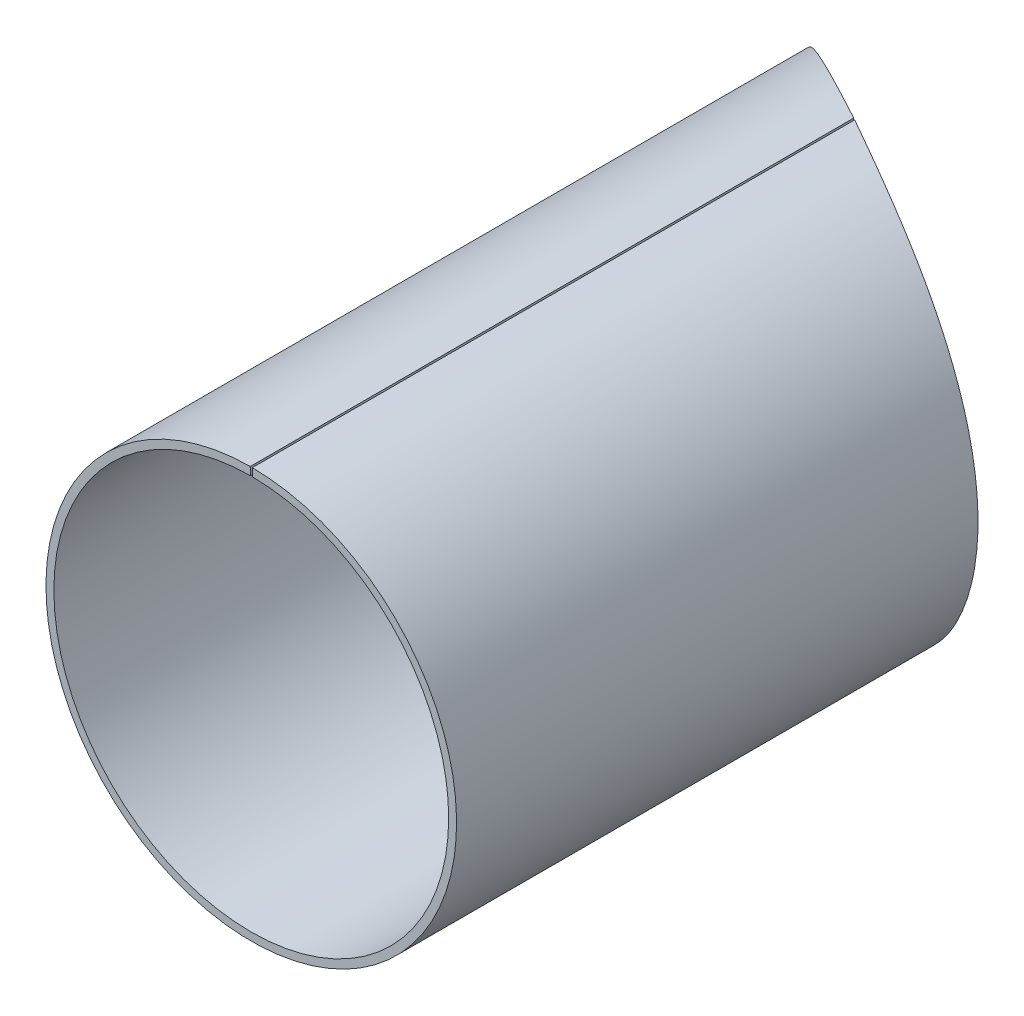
ISO-10303-21;
HEADER;
FILE_DESCRIPTION(('STEP AP214'),'2;1');
FILE_NAME('part.step','',(''),(''),'','','');
FILE_SCHEMA(('AUTOMOTIVE_DESIGN { 1 0 10303 214 1 1 1 1 }'));
ENDSEC;
DATA;
#1=APPLICATION_CONTEXT('core data for automotive mechanical design processes');
#2=APPLICATION_PROTOCOL_DEFINITION('international standard','automotive_design',2000,#1);
#3=PRODUCT_CONTEXT('',#1,'mechanical');
#4=PRODUCT('Part','Part','',(#3));
#5=PRODUCT_RELATED_PRODUCT_CATEGORY('part','',(#4));
#6=PRODUCT_DEFINITION_FORMATION('','',#4);
#7=PRODUCT_DEFINITION_CONTEXT('part definition',#1,'design');
#8=PRODUCT_DEFINITION('design','',#6,#7);
#9=PRODUCT_DEFINITION_SHAPE('','',#8);
#10=(LENGTH_UNIT() NAMED_UNIT(*) SI_UNIT(.MILLI.,.METRE.));
#11=(NAMED_UNIT(*) PLANE_ANGLE_UNIT() SI_UNIT($,.RADIAN.));
#12=(NAMED_UNIT(*) SI_UNIT($,.STERADIAN.) SOLID_ANGLE_UNIT());
#13=UNCERTAINTY_MEASURE_WITH_UNIT(LENGTH_MEASURE(1.E-05),#10,'distance_accuracy_value','');
#14=(GEOMETRIC_REPRESENTATION_CONTEXT(3) GLOBAL_UNCERTAINTY_ASSIGNED_CONTEXT((#13)) GLOBAL_UNIT_ASSIGNED_CONTEXT((#10,
#11,#12)) REPRESENTATION_CONTEXT('',''));
#15=CARTESIAN_POINT('',(0.,0.,0.));
#16=DIRECTION('',(0.,0.,1.));
#17=DIRECTION('',(1.,0.,0.));
#18=AXIS2_PLACEMENT_3D('',#15,#16,#17);
#19=CARTESIAN_POINT('',(0.,0.,-209.5));
#20=DIRECTION('',(0.,0.,1.));
#21=DIRECTION('',(1.,0.,0.));
#22=AXIS2_PLACEMENT_3D('',#19,#20,#21);
#23=CYLINDRICAL_SURFACE('',#22,52.);
#24=CARTESIAN_POINT('',(-1.9813539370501E-05,-51.9999999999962,-152.709239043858));
#25=CARTESIAN_POINT('',(-0.00431492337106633,-51.9999994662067,-152.711576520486));
#26=CARTESIAN_POINT('',(-0.00861003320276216,-51.9999989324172,-152.713913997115));
#27=CARTESIAN_POINT('',(-0.012905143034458,-51.9999983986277,-152.716251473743));
#28=B_SPLINE_CURVE_WITH_KNOTS('',3,(#24,#25,#26,#27),.UNSPECIFIED.,.F.,.F.,(4,4),(0.,
0.0146698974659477),.UNSPECIFIED.);
#29=CARTESIAN_POINT('',(-2.07089254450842E-05,-52.0000000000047,-152.709239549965));
#30=VERTEX_POINT('',#29);
#31=CARTESIAN_POINT('',(-0.012905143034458,-51.9999983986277,-152.716251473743));
#32=VERTEX_POINT('',#31);
#33=EDGE_CURVE('E101',#30,#32,#28,.T.);
#34=ORIENTED_EDGE('',*,*,#33,.F.);
#35=CARTESIAN_POINT('',(0.26,51.9993499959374,-152.562345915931));
#36=CARTESIAN_POINT('',(0.847993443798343,51.9964077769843,-152.230707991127));
#37=CARTESIAN_POINT('',(1.43755430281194,51.9834876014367,-151.902020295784));
#38=CARTESIAN_POINT('',(2.62007244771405,51.937326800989,-151.250383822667));
#39=CARTESIAN_POINT('',(3.21303321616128,51.90405908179,-150.927443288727));
#40=CARTESIAN_POINT('',(5.00740612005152,51.7723299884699,-149.96166421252));
#41=CARTESIAN_POINT('',(6.2120343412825,51.6419850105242,-149.328792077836));
#42=CARTESIAN_POINT('',(8.62401693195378,51.2943622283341,-148.091956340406));
#43=CARTESIAN_POINT('',(9.83137203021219,51.0770575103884,-147.488001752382));
#44=CARTESIAN_POINT('',(12.242931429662,50.5532781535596,-146.310995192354));
#45=CARTESIAN_POINT('',(13.4471330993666,50.2467442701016,-145.737964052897));
#46=CARTESIAN_POINT('',(15.8444005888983,49.5430651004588,-144.625349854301));
#47=CARTESIAN_POINT('',(17.0374672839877,49.145926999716,-144.085764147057));
#48=CARTESIAN_POINT('',(19.4075662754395,48.2592039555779,-143.040489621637));
#49=CARTESIAN_POINT('',(20.584556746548,47.769414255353,-142.534879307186));
#50=CARTESIAN_POINT('',(22.9116271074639,46.6979451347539,-141.560225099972));
#51=CARTESIAN_POINT('',(24.061706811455,46.1162650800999,-141.091181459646));
#52=CARTESIAN_POINT('',(26.3269078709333,44.8616856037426,-140.190594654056));
#53=CARTESIAN_POINT('',(27.4420159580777,44.1887520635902,-139.759065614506));
#54=CARTESIAN_POINT('',(29.6282248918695,42.7536864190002,-138.933923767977));
#55=CARTESIAN_POINT('',(30.6993238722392,41.991550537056,-138.540312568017));
#56=CARTESIAN_POINT('',(32.5178406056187,40.5899643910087,-137.888389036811));
#57=CARTESIAN_POINT('',(33.2772008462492,39.9699111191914,-137.621450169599));
#58=CARTESIAN_POINT('',(34.7636837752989,38.6840018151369,-137.108262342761));
#59=CARTESIAN_POINT('',(35.490802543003,38.0181402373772,-136.862015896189));
#60=CARTESIAN_POINT('',(36.9094265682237,36.6424706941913,-136.390014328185));
#61=CARTESIAN_POINT('',(37.6009271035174,35.9326569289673,-136.164261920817));
#62=CARTESIAN_POINT('',(38.9442046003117,34.472192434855,-135.733071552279));
#63=CARTESIAN_POINT('',(39.5960287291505,33.7215922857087,-135.527609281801));
#64=CARTESIAN_POINT('',(40.8577901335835,32.181237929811,-135.136501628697));
#65=CARTESIAN_POINT('',(41.4677330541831,31.391489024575,-134.950853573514));
#66=CARTESIAN_POINT('',(42.6427481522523,29.7757158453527,-134.598830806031));
#67=CARTESIAN_POINT('',(43.2078416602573,28.9497091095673,-134.432446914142));
#68=CARTESIAN_POINT('',(44.1292445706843,27.5155236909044,-134.164994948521));
#69=CARTESIAN_POINT('',(44.4975471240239,26.9158748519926,-134.059249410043));
#70=CARTESIAN_POINT('',(45.2100574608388,25.7010965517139,-133.856707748));
#71=CARTESIAN_POINT('',(45.5542701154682,25.0859702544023,-133.759909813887));
#72=CARTESIAN_POINT('',(46.21767589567,23.8416285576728,-133.575091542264));
#73=CARTESIAN_POINT('',(46.5368856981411,23.2124229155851,-133.487065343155));
#74=CARTESIAN_POINT('',(47.1498564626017,21.9405874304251,-133.319481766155));
#75=CARTESIAN_POINT('',(47.4436161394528,21.2979569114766,-133.239924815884));
#76=CARTESIAN_POINT('',(48.0006031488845,20.0106514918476,-133.090323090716));
#77=CARTESIAN_POINT('',(48.264238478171,19.3661681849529,-133.020148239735));
#78=CARTESIAN_POINT('',(48.7656850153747,18.0663570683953,-132.887622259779));
#79=CARTESIAN_POINT('',(49.0034933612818,17.4110280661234,-132.825271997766));
#80=CARTESIAN_POINT('',(49.4527419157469,16.0907589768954,-132.708249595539));
#81=CARTESIAN_POINT('',(49.6641836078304,15.4258194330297,-132.653577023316));
#82=CARTESIAN_POINT('',(50.0602528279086,14.0875127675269,-132.551776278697));
#83=CARTESIAN_POINT('',(50.2448833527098,13.414146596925,-132.504647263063));
#84=CARTESIAN_POINT('',(50.5869162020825,12.060315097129,-132.417757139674));
#85=CARTESIAN_POINT('',(50.7443280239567,11.379852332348,-132.377993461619));
#86=CARTESIAN_POINT('',(51.031673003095,10.0128009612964,-132.30571087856));
#87=CARTESIAN_POINT('',(51.161607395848,9.32621263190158,-132.273191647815));
#88=CARTESIAN_POINT('',(51.3938399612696,7.94747306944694,-132.215273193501));
#89=CARTESIAN_POINT('',(51.4961144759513,7.25531759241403,-132.18988006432));
#90=CARTESIAN_POINT('',(51.6726867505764,5.86712324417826,-132.14603929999));
#91=CARTESIAN_POINT('',(51.7469797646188,5.17108373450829,-132.127592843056));
#92=CARTESIAN_POINT('',(51.8885596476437,3.53151972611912,-132.092478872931));
#93=CARTESIAN_POINT('',(51.9442277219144,2.58690792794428,-132.078710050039));
#94=CARTESIAN_POINT('',(52.0039591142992,0.695538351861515,-132.06403075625));
#95=CARTESIAN_POINT('',(52.0080010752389,-0.25122015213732,-132.063125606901));
#96=CARTESIAN_POINT('',(51.9753193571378,-1.6704046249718,-132.071329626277));
#97=CARTESIAN_POINT('',(51.9579625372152,-2.1433775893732,-132.07565928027));
#98=CARTESIAN_POINT('',(51.9103485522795,-3.08863458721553,-132.087455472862));
#99=CARTESIAN_POINT('',(51.8800913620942,-3.56091861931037,-132.094922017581));
#100=CARTESIAN_POINT('',(51.7699979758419,-4.97621597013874,-132.122083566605));
#101=CARTESIAN_POINT('',(51.6708390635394,-5.91771357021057,-132.146540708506));
#102=CARTESIAN_POINT('',(51.4214015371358,-7.79322833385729,-132.208398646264));
#103=CARTESIAN_POINT('',(51.2711331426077,-8.72724695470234,-132.245796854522));
#104=CARTESIAN_POINT('',(50.9200902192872,-10.5847666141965,-132.333694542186));
#105=CARTESIAN_POINT('',(50.719336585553,-11.508271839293,-132.384188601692));
#106=CARTESIAN_POINT('',(50.326734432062,-13.103751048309,-132.483781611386));
#107=CARTESIAN_POINT('',(50.1461347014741,-13.778710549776,-132.52983166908));
#108=CARTESIAN_POINT('',(49.7580842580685,-15.1202000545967,-132.629394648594));
#109=CARTESIAN_POINT('',(49.5506381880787,-15.7867314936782,-132.682906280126));
#110=CARTESIAN_POINT('',(49.109550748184,-17.1095771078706,-132.79753621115));
#111=CARTESIAN_POINT('',(48.8759386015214,-17.7659017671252,-132.858646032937));
#112=CARTESIAN_POINT('',(48.382821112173,-19.0679638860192,-132.988686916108));
#113=CARTESIAN_POINT('',(48.1233157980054,-19.7137013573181,-133.057617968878));
#114=CARTESIAN_POINT('',(47.5789437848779,-20.9935155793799,-133.203461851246));
#115=CARTESIAN_POINT('',(47.2940758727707,-21.6275917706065,-133.280375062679));
#116=CARTESIAN_POINT('',(46.699611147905,-22.8829328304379,-133.442393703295));
#117=CARTESIAN_POINT('',(46.3900156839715,-23.504198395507,-133.52749868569));
#118=CARTESIAN_POINT('',(45.7463946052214,-24.7335658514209,-133.706168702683));
#119=CARTESIAN_POINT('',(45.4123431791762,-25.3416529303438,-133.799742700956));
#120=CARTESIAN_POINT('',(44.720769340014,-26.5430464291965,-133.995434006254));
#121=CARTESIAN_POINT('',(44.3632429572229,-27.1363503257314,-134.097552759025));
#122=CARTESIAN_POINT('',(43.4961558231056,-28.5124129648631,-134.347989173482));
#123=CARTESIAN_POINT('',(42.9772481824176,-29.2886445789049,-134.499949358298));
#124=CARTESIAN_POINT('',(41.899938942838,-30.8101333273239,-134.82056664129));
#125=CARTESIAN_POINT('',(41.3415212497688,-31.5553776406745,-134.98923055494));
#126=CARTESIAN_POINT('',(40.4761125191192,-32.6481297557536,-135.254947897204));
#127=CARTESIAN_POINT('',(40.1829699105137,-33.0082430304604,-135.345654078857));
#128=CARTESIAN_POINT('',(39.587708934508,-33.7198529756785,-135.531315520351));
#129=CARTESIAN_POINT('',(39.2855905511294,-34.071349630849,-135.626270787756));
#130=CARTESIAN_POINT('',(38.3661710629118,-35.1125943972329,-135.917662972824));
#131=CARTESIAN_POINT('',(37.735812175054,-35.78908903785,-136.120624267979));
#132=CARTESIAN_POINT('',(36.4430883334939,-37.1046056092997,-136.544163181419));
#133=CARTESIAN_POINT('',(35.7807293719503,-37.7436345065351,-136.764737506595));
#134=CARTESIAN_POINT('',(34.4267283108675,-38.9825858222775,-137.223726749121));
#135=CARTESIAN_POINT('',(33.7350974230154,-39.5825229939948,-137.462134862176));
#136=CARTESIAN_POINT('',(32.5011197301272,-40.59737062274,-137.895246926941));
#137=CARTESIAN_POINT('',(31.9645991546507,-41.0210882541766,-138.086007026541));
#138=CARTESIAN_POINT('',(30.8777504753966,-41.8453047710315,-138.477688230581));
#139=CARTESIAN_POINT('',(30.3274247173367,-42.2458075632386,-138.678607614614));
#140=CARTESIAN_POINT('',(29.2146789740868,-43.0228143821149,-139.090443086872));
#141=CARTESIAN_POINT('',(28.6522723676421,-43.3993432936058,-139.301348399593));
#142=CARTESIAN_POINT('',(27.5159634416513,-44.1285339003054,-139.733320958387));
#143=CARTESIAN_POINT('',(26.9420605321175,-44.4811943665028,-139.954388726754));
#144=CARTESIAN_POINT('',(25.7840724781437,-45.1622933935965,-140.406581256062));
#145=CARTESIAN_POINT('',(25.1999889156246,-45.4907356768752,-140.637704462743));
#146=CARTESIAN_POINT('',(24.0227714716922,-46.1232362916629,-141.109939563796));
#147=CARTESIAN_POINT('',(23.4296379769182,-46.427295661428,-141.351051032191));
#148=CARTESIAN_POINT('',(22.2349803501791,-47.0111473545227,-141.843332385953));
#149=CARTESIAN_POINT('',(21.6334499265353,-47.290920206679,-142.094510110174));
#150=CARTESIAN_POINT('',(20.4235851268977,-47.8258806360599,-142.60660214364));
#151=CARTESIAN_POINT('',(19.8152499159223,-48.0810651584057,-142.867517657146));
#152=CARTESIAN_POINT('',(17.970008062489,-48.8143561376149,-143.669760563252));
#153=CARTESIAN_POINT('',(16.7242663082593,-49.2546426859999,-144.225900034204));
#154=CARTESIAN_POINT('',(14.2184324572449,-50.0355854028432,-145.375440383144));
#155=CARTESIAN_POINT('',(12.9583347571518,-50.3762011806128,-145.968856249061));
#156=CARTESIAN_POINT('',(10.4319302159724,-50.9593577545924,-147.190766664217));
#157=CARTESIAN_POINT('',(9.16562124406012,-51.2018621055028,-147.819274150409));
#158=CARTESIAN_POINT('',(6.63522070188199,-51.5908097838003,-149.108401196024));
#159=CARTESIAN_POINT('',(5.37112844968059,-51.7372913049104,-149.769007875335));
#160=CARTESIAN_POINT('',(3.42229191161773,-51.8918691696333,-150.813667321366));
#161=CARTESIAN_POINT('',(2.73445223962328,-51.9325941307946,-151.187467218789));
#162=CARTESIAN_POINT('',(1.36368101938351,-51.986630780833,-151.942624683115));
#163=CARTESIAN_POINT('',(0.680742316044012,-51.9999982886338,-152.323965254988));
#164=CARTESIAN_POINT('',(-2.15755108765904E-05,-51.9999999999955,-152.7092400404));
#165=B_SPLINE_CURVE_WITH_KNOTS('',3,(#35,#36,#37,#38,#39,#40,#41,#42,#43,#44,#45,#46,#47,#48,
#49,#50,#51,#52,#53,#54,#55,#56,#57,#58,#59,#60,#61,#62,#63,#64,#65,#66,#67,#68,#69,#70,#71,#72,
#73,#74,#75,#76,#77,#78,#79,#80,#81,#82,#83,#84,#85,#86,#87,#88,#89,#90,#91,#92,#93,#94,#95,#96,
#97,#98,#99,#100,#101,#102,#103,#104,#105,#106,#107,#108,#109,#110,#111,#112,#113,#114,#115,
#116,#117,#118,#119,#120,#121,#122,#123,#124,#125,#126,#127,#128,#129,#130,#131,#132,#133,#134,
#135,#136,#137,#138,#139,#140,#141,#142,#143,#144,#145,#146,#147,#148,#149,#150,#151,#152,#153,
#154,#155,#156,#157,#158,#159,#160,#161,#162,#163,#164),.UNSPECIFIED.,.F.,.F.,(4,2,2,2,2,2,2,2,
2,2,2,2,2,2,2,2,2,2,2,2,2,2,2,2,2,2,2,2,2,2,2,2,2,2,2,2,2,2,2,2,2,2,2,2,2,2,2,2,2,2,2,2,2,2,2,2,
2,2,2,2,2,2,2,2,4),(0.,2.02506118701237,4.05282478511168,8.15055167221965,12.2495477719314,
16.3512716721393,20.4526703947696,24.5632412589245,28.6738404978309,32.7859808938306,
36.8982954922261,39.9447996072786,42.9916731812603,46.0389496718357,49.0825298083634,
52.1256989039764,55.167411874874,57.3016990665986,59.4355534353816,61.5679721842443,
63.7004985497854,65.7994393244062,67.8986124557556,69.9976674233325,72.0964875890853,
74.1945739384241,76.2925659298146,78.3923467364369,80.4924835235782,83.3300048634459,
86.1687000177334,87.5884704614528,89.0082436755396,91.8476731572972,94.6865352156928,
97.5242242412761,99.624317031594,101.724047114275,103.821455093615,105.918860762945,
108.016366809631,110.113758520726,112.213396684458,114.313390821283,117.14983628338,
119.987443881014,121.406642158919,122.825842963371,125.664276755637,128.502181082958,
131.339008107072,133.467780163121,135.596192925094,137.722359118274,139.848634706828,
141.974582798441,144.100440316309,146.227986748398,148.355797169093,152.651872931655,
156.94968723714,161.249096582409,165.546794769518,167.898044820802,170.244492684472),.UNSPECIFIED.);
#166=CARTESIAN_POINT('',(0.26,51.9993499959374,-152.562345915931));
#167=VERTEX_POINT('',#166);
#168=EDGE_CURVE('E100',#167,#30,#165,.T.);
#169=ORIENTED_EDGE('',*,*,#168,.F.);
#170=DIRECTION('',(0.,0.,1.));
#171=VECTOR('',#170,1.);
#172=CARTESIAN_POINT('',(0.26,51.9993499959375,-209.5));
#173=LINE('',#172,#171);
#174=CARTESIAN_POINT('',(0.26,51.9993499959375,0.));
#175=VERTEX_POINT('',#174);
#176=EDGE_CURVE('E37',#167,#175,#173,.T.);
#177=ORIENTED_EDGE('',*,*,#176,.T.);
#178=CARTESIAN_POINT('',(0.,0.,0.));
#179=DIRECTION('',(0.,0.,1.));
#180=DIRECTION('',(1.,0.,0.));
#181=AXIS2_PLACEMENT_3D('',#178,#179,#180);
#182=CIRCLE('',#181,52.);
#183=CARTESIAN_POINT('',(-0.260000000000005,51.9993499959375,0.));
#184=VERTEX_POINT('',#183);
#185=EDGE_CURVE('E110',#184,#175,#182,.T.);
#186=ORIENTED_EDGE('',*,*,#185,.F.);
#187=DIRECTION('',(0.,0.,1.));
#188=VECTOR('',#187,1.);
#189=CARTESIAN_POINT('',(-0.260000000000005,51.9993499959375,-209.5));
#190=LINE('',#189,#188);
#191=CARTESIAN_POINT('',(-0.259999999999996,51.9993499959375,-152.850956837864));
#192=VERTEX_POINT('',#191);
#193=EDGE_CURVE('E11',#192,#184,#190,.T.);
#194=ORIENTED_EDGE('',*,*,#193,.F.);
#195=CARTESIAN_POINT('',(-0.012905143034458,-51.9999983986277,-152.716251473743));
#196=CARTESIAN_POINT('',(-0.600467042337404,-51.9998498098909,-153.036037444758));
#197=CARTESIAN_POINT('',(-1.18647874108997,-51.9897479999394,-153.358535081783));
#198=CARTESIAN_POINT('',(-2.35475996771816,-51.9499442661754,-154.0085799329));
#199=CARTESIAN_POINT('',(-2.93703072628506,-51.9202491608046,-154.336125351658));
#200=CARTESIAN_POINT('',(-4.67938418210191,-51.8021204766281,-155.326964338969));
#201=CARTESIAN_POINT('',(-5.83348436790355,-51.6846454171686,-155.997631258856));
#202=CARTESIAN_POINT('',(-7.54984230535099,-51.4522476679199,-157.016459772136));
#203=CARTESIAN_POINT('',(-8.11979556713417,-51.365356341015,-157.358392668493));
#204=CARTESIAN_POINT('',(-9.25427725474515,-51.1731320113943,-158.046168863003));
#205=CARTESIAN_POINT('',(-9.81880499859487,-51.067796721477,-158.392012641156));
#206=CARTESIAN_POINT('',(-12.0751378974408,-50.6081163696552,-159.788692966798));
#207=CARTESIAN_POINT('',(-13.7437151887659,-50.1800965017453,-160.854336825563));
#208=CARTESIAN_POINT('',(-16.1984652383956,-49.4200866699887,-162.469693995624));
#209=CARTESIAN_POINT('',(-17.0090530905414,-49.1469358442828,-163.011211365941));
#210=CARTESIAN_POINT('',(-18.6132359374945,-48.5620838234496,-164.098701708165));
#211=CARTESIAN_POINT('',(-19.4068316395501,-48.2503842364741,-164.644674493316));
#212=CARTESIAN_POINT('',(-20.9766176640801,-47.5889449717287,-165.740154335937));
#213=CARTESIAN_POINT('',(-21.752792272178,-47.239172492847,-166.289664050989));
#214=CARTESIAN_POINT('',(-23.2860593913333,-46.502503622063,-167.390491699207));
#215=CARTESIAN_POINT('',(-24.043151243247,-46.11560595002,-167.941809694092));
#216=CARTESIAN_POINT('',(-25.5369050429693,-45.3054967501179,-169.044538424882));
#217=CARTESIAN_POINT('',(-26.2735767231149,-44.8823029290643,-169.595948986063));
#218=CARTESIAN_POINT('',(-27.7258589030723,-43.9999841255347,-170.697568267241));
#219=CARTESIAN_POINT('',(-28.4414714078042,-43.5408625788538,-171.247777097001));
#220=CARTESIAN_POINT('',(-29.8469310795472,-42.5896323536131,-172.342468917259));
#221=CARTESIAN_POINT('',(-30.5368976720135,-42.0977176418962,-172.886966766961));
#222=CARTESIAN_POINT('',(-31.5547490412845,-41.3337360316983,-173.700336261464));
#223=CARTESIAN_POINT('',(-31.8911669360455,-41.0747372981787,-173.970883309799));
#224=CARTESIAN_POINT('',(-32.5581921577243,-40.5480543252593,-174.510693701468));
#225=CARTESIAN_POINT('',(-32.888799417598,-40.2803699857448,-174.779957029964));
#226=CARTESIAN_POINT('',(-33.8705942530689,-39.4652472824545,-175.584484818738));
#227=CARTESIAN_POINT('',(-34.5129631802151,-38.9048327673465,-176.117453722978));
#228=CARTESIAN_POINT('',(-35.7730222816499,-37.7494577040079,-177.175089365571));
#229=CARTESIAN_POINT('',(-36.3907118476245,-37.1544963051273,-177.69975589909));
#230=CARTESIAN_POINT('',(-37.5226243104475,-36.0085470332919,-178.672108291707));
#231=CARTESIAN_POINT('',(-38.039962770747,-35.4616941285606,-179.12104321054));
#232=CARTESIAN_POINT('',(-39.0539040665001,-34.3418566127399,-180.009537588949));
#233=CARTESIAN_POINT('',(-39.5505085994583,-33.768874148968,-180.449097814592));
#234=CARTESIAN_POINT('',(-40.5230672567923,-32.5954419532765,-181.317811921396));
#235=CARTESIAN_POINT('',(-40.9989779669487,-31.9949394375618,-181.746943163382));
#236=CARTESIAN_POINT('',(-41.9279493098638,-30.7675073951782,-182.592098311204));
#237=CARTESIAN_POINT('',(-42.3810087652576,-30.1405765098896,-183.008121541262));
#238=CARTESIAN_POINT('',(-43.2038020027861,-28.9462329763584,-183.770048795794));
#239=CARTESIAN_POINT('',(-43.5765585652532,-28.3821240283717,-184.117870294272));
#240=CARTESIAN_POINT('',(-44.3031054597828,-27.2341024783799,-184.800596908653));
#241=CARTESIAN_POINT('',(-44.6568940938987,-26.6501881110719,-185.13550086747));
#242=CARTESIAN_POINT('',(-45.3446076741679,-25.4624752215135,-185.79085265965));
#243=CARTESIAN_POINT('',(-45.6785247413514,-24.8586689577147,-186.111294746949));
#244=CARTESIAN_POINT('',(-46.3252170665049,-23.6316547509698,-186.735752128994));
#245=CARTESIAN_POINT('',(-46.6379951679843,-23.008449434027,-187.039769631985));
#246=CARTESIAN_POINT('',(-47.2408926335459,-21.743694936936,-187.629322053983));
#247=CARTESIAN_POINT('',(-47.5310388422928,-21.1021687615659,-187.91487879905));
#248=CARTESIAN_POINT('',(-48.0878643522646,-19.8004638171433,-188.465766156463));
#249=CARTESIAN_POINT('',(-48.3545431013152,-19.1402846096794,-188.731096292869));
#250=CARTESIAN_POINT('',(-48.8629475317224,-17.8023670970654,-189.239496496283));
#251=CARTESIAN_POINT('',(-49.1046848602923,-17.1246371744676,-189.482576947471));
#252=CARTESIAN_POINT('',(-49.5619634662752,-15.7522925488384,-189.944429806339));
#253=CARTESIAN_POINT('',(-49.7775075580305,-15.0576796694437,-190.163204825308));
#254=CARTESIAN_POINT('',(-50.1197983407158,-13.8659675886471,-190.511973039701));
#255=CARTESIAN_POINT('',(-50.2536460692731,-13.3728771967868,-190.648765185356));
#256=CARTESIAN_POINT('',(-50.507497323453,-12.3796368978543,-190.908867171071));
#257=CARTESIAN_POINT('',(-50.627501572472,-11.8794873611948,-191.032177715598));
#258=CARTESIAN_POINT('',(-50.8532104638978,-10.8727671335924,-191.264607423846));
#259=CARTESIAN_POINT('',(-50.9589168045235,-10.3661972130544,-191.373728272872));
#260=CARTESIAN_POINT('',(-51.1556271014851,-9.34724801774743,-191.577149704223));
#261=CARTESIAN_POINT('',(-51.2466309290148,-8.83486869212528,-191.671450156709));
#262=CARTESIAN_POINT('',(-51.4134594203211,-7.80561957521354,-191.844614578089));
#263=CARTESIAN_POINT('',(-51.489300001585,-7.28875509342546,-191.923494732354));
#264=CARTESIAN_POINT('',(-51.6255842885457,-6.25084009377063,-192.065415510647));
#265=CARTESIAN_POINT('',(-51.6860281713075,-5.72978962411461,-192.128456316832));
#266=CARTESIAN_POINT('',(-51.7912422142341,-4.68436005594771,-192.238301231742));
#267=CARTESIAN_POINT('',(-51.8360112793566,-4.15998072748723,-192.285104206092));
#268=CARTESIAN_POINT('',(-51.909652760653,-3.10893892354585,-192.362132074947));
#269=CARTESIAN_POINT('',(-51.9385262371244,-2.58227660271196,-192.392358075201));
#270=CARTESIAN_POINT('',(-51.9872683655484,-1.34974622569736,-192.443403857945));
#271=CARTESIAN_POINT('',(-52.000817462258,-0.643334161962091,-192.457614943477));
#272=CARTESIAN_POINT('',(-51.9991061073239,0.769419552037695,-192.455828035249));
#273=CARTESIAN_POINT('',(-51.9838447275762,1.47576119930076,-192.4398290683));
#274=CARTESIAN_POINT('',(-51.9246535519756,2.88588817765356,-192.377835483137));
#275=CARTESIAN_POINT('',(-51.8807246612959,3.58967358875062,-192.331841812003));
#276=CARTESIAN_POINT('',(-51.7645409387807,4.99280383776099,-192.21041777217));
#277=CARTESIAN_POINT('',(-51.6922692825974,5.6921457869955,-192.134969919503));
#278=CARTESIAN_POINT('',(-51.5630963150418,6.73573083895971,-192.000309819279));
#279=CARTESIAN_POINT('',(-51.5165742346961,7.08270911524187,-191.951838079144));
#280=CARTESIAN_POINT('',(-51.4167019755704,7.77463414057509,-191.847955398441));
#281=CARTESIAN_POINT('',(-51.3633518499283,8.11958090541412,-191.792544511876));
#282=CARTESIAN_POINT('',(-51.1932162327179,9.15095926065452,-191.616035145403));
#283=CARTESIAN_POINT('',(-51.0663333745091,9.83402657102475,-191.484647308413));
#284=CARTESIAN_POINT('',(-50.824639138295,11.004998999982,-191.235166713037));
#285=CARTESIAN_POINT('',(-50.7159184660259,11.4954929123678,-191.12316485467));
#286=CARTESIAN_POINT('',(-50.4851155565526,12.4701223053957,-190.88596173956));
#287=CARTESIAN_POINT('',(-50.3630325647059,12.9542574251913,-190.760759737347));
#288=CARTESIAN_POINT('',(-49.977373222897,14.3962450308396,-190.366377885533));
#289=CARTESIAN_POINT('',(-49.6943450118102,15.3438796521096,-190.078379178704));
#290=CARTESIAN_POINT('',(-49.080049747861,17.2079089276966,-189.457487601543));
#291=CARTESIAN_POINT('',(-48.7487885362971,18.1243073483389,-189.12460016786));
#292=CARTESIAN_POINT('',(-48.0413920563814,19.923832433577,-188.419243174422));
#293=CARTESIAN_POINT('',(-47.6652599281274,20.8069614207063,-188.046776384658));
#294=CARTESIAN_POINT('',(-46.9667020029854,22.3305383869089,-187.360667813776));
#295=CARTESIAN_POINT('',(-46.6530491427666,22.9783655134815,-187.054359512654));
#296=CARTESIAN_POINT('',(-46.0030269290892,24.2535259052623,-186.423911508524));
#297=CARTESIAN_POINT('',(-45.6666598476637,24.8808612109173,-186.099773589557));
#298=CARTESIAN_POINT('',(-44.9726486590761,26.1143910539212,-185.435664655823));
#299=CARTESIAN_POINT('',(-44.6150180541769,26.7205986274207,-185.095703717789));
#300=CARTESIAN_POINT('',(-43.8793679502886,27.9122087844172,-184.401611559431));
#301=CARTESIAN_POINT('',(-43.5013462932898,28.4976091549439,-184.047478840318));
#302=CARTESIAN_POINT('',(-42.3392945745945,30.2208946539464,-182.967296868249));
#303=CARTESIAN_POINT('',(-41.5262431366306,31.3276925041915,-182.222469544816));
#304=CARTESIAN_POINT('',(-39.8298185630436,33.4580406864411,-180.694618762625));
#305=CARTESIAN_POINT('',(-38.9464271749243,34.4815692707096,-179.911585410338));
#306=CARTESIAN_POINT('',(-37.4490249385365,36.0873668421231,-178.608006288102));
#307=CARTESIAN_POINT('',(-36.854192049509,36.694489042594,-178.095817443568));
#308=CARTESIAN_POINT('',(-35.639748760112,37.8751330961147,-177.062193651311));
#309=CARTESIAN_POINT('',(-35.0201371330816,38.4486532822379,-176.540758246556));
#310=CARTESIAN_POINT('',(-33.1256221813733,40.1189222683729,-174.965709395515));
#311=CARTESIAN_POINT('',(-31.8148753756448,41.1655540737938,-173.901210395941));
#312=CARTESIAN_POINT('',(-29.7848904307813,42.6328155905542,-172.294065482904));
#313=CARTESIAN_POINT('',(-29.0977361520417,43.1046997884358,-171.756732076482));
#314=CARTESIAN_POINT('',(-27.7026862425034,44.0142534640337,-170.680016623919));
#315=CARTESIAN_POINT('',(-26.9947905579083,44.451922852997,-170.140634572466));
#316=CARTESIAN_POINT('',(-24.8410682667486,45.7131246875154,-168.521401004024));
#317=CARTESIAN_POINT('',(-23.3651621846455,46.4848827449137,-167.440426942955));
#318=CARTESIAN_POINT('',(-21.0396005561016,47.5619577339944,-165.784210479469));
#319=CARTESIAN_POINT('',(-20.2152709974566,47.9181668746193,-165.205800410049));
#320=CARTESIAN_POINT('',(-18.5468549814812,48.5882971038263,-164.052949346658));
#321=CARTESIAN_POINT('',(-17.702767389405,48.9022157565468,-163.478508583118));
#322=CARTESIAN_POINT('',(-15.1436792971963,49.7786873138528,-161.764062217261));
#323=CARTESIAN_POINT('',(-13.4003694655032,50.2766446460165,-160.631873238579));
#324=CARTESIAN_POINT('',(-11.1699953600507,50.7882949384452,-159.229975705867));
#325=CARTESIAN_POINT('',(-10.7113159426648,50.8870177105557,-158.944088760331));
#326=CARTESIAN_POINT('',(-9.79004928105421,51.0722585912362,-158.374732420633));
#327=CARTESIAN_POINT('',(-9.32746253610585,51.1587782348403,-158.091262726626));
#328=CARTESIAN_POINT('',(-8.16273998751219,51.3602449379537,-157.383623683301));
#329=CARTESIAN_POINT('',(-7.45823311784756,51.4673202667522,-156.961095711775));
#330=CARTESIAN_POINT('',(-6.04154457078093,51.6527844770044,-156.122504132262));
#331=CARTESIAN_POINT('',(-5.32936213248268,51.7311704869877,-155.706441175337));
#332=CARTESIAN_POINT('',(-3.89429905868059,51.8590032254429,-154.879153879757));
#333=CARTESIAN_POINT('',(-3.17138100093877,51.9082870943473,-154.467969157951));
#334=CARTESIAN_POINT('',(-1.71977585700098,51.9766328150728,-153.653437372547));
#335=CARTESIAN_POINT('',(-0.991089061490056,51.9956961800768,-153.250089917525));
#336=CARTESIAN_POINT('',(-0.259999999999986,51.9993499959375,-152.850956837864));
#337=B_SPLINE_CURVE_WITH_KNOTS('',3,(#195,#196,#197,#198,#199,#200,#201,#202,#203,#204,#205,
#206,#207,#208,#209,#210,#211,#212,#213,#214,#215,#216,#217,#218,#219,#220,#221,#222,#223,#224,
#225,#226,#227,#228,#229,#230,#231,#232,#233,#234,#235,#236,#237,#238,#239,#240,#241,#242,#243,
#244,#245,#246,#247,#248,#249,#250,#251,#252,#253,#254,#255,#256,#257,#258,#259,#260,#261,#262,
#263,#264,#265,#266,#267,#268,#269,#270,#271,#272,#273,#274,#275,#276,#277,#278,#279,#280,#281,
#282,#283,#284,#285,#286,#287,#288,#289,#290,#291,#292,#293,#294,#295,#296,#297,#298,#299,#300,
#301,#302,#303,#304,#305,#306,#307,#308,#309,#310,#311,#312,#313,#314,#315,#316,#317,#318,#319,
#320,#321,#322,#323,#324,#325,#326,#327,#328,#329,#330,#331,#332,#333,#334,#335,#336),
.UNSPECIFIED.,.F.,.F.,(4,2,2,2,2,2,2,2,2,2,2,2,2,2,2,2,2,2,2,2,2,2,2,2,2,2,2,2,2,2,2,2,2,2,2,2,
2,2,2,2,2,2,2,2,2,2,2,2,2,2,2,2,2,2,2,2,2,2,2,2,2,2,2,2,2,2,2,2,2,2,4),(0.,2.00664300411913,
4.01258806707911,8.02967412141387,10.0403581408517,12.0512916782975,18.11877538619,
21.1552762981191,24.191650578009,27.2306618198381,30.2697778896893,33.3074196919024,
36.3447713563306,39.365525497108,40.8757538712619,42.3859996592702,45.4011155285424,
48.4163056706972,51.0451139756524,53.6737066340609,56.3075712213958,58.94157137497,
61.2220826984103,63.5027978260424,65.7844113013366,68.0657172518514,70.3442747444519,
72.6228858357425,74.9004279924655,77.1777252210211,78.7641488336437,80.3504895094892,
81.936641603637,83.5228075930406,85.107299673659,86.6917735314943,88.2763580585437,
89.8608368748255,91.9796076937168,94.0984467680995,96.2172189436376,98.3372507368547,
99.3973974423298,100.457535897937,102.57751556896,104.121350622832,105.665272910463,
108.752493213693,111.839339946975,114.92597078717,117.271877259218,119.617549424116,
121.961747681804,124.306194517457,128.98813624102,133.671296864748,136.647450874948,
139.623752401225,145.575522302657,148.550154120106,151.524793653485,157.473878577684,
160.677470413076,163.881246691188,170.282970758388,171.931176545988,173.579174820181,
176.063947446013,178.548968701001,181.047767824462,183.546441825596),.UNSPECIFIED.);
#338=EDGE_CURVE('E96',#32,#192,#337,.T.);
#339=ORIENTED_EDGE('',*,*,#338,.F.);
#340=EDGE_LOOP('',(#34,#169,#177,#186,#194,#339));
#341=FACE_BOUND('',#340,.T.);
#342=ADVANCED_FACE('F34',(#341),#23,.T.);
#343=CARTESIAN_POINT('',(-0.260000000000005,51.9993499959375,-209.5));
#344=DIRECTION('',(-0.999987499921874,-0.00500000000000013,0.));
#345=DIRECTION('',(0.00500000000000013,-0.999987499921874,0.));
#346=AXIS2_PLACEMENT_3D('',#343,#344,#345);
#347=PLANE('',#346);
#348=DIRECTION('',(-0.0050000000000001,0.999987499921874,0.));
#349=VECTOR('',#348,1.);
#350=CARTESIAN_POINT('',(-0.260000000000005,51.9993499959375,-152.850956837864));
#351=LINE('',#350,#349);
#352=CARTESIAN_POINT('',(-0.249999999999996,49.9993749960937,-152.850956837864));
#353=VERTEX_POINT('',#352);
#354=EDGE_CURVE('E102',#353,#192,#351,.T.);
#355=ORIENTED_EDGE('',*,*,#354,.T.);
#356=ORIENTED_EDGE('',*,*,#193,.T.);
#357=DIRECTION('',(0.00500000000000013,-0.999987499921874,0.));
#358=VECTOR('',#357,1.);
#359=CARTESIAN_POINT('',(-0.260000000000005,51.9993499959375,0.));
#360=LINE('',#359,#358);
#361=CARTESIAN_POINT('',(-0.250000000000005,49.9993749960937,0.));
#362=VERTEX_POINT('',#361);
#363=EDGE_CURVE('E156',#184,#362,#360,.T.);
#364=ORIENTED_EDGE('',*,*,#363,.T.);
#365=DIRECTION('',(0.,0.,1.));
#366=VECTOR('',#365,1.);
#367=CARTESIAN_POINT('',(-0.250000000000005,49.9993749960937,-209.5));
#368=LINE('',#367,#366);
#369=EDGE_CURVE('E42',#353,#362,#368,.T.);
#370=ORIENTED_EDGE('',*,*,#369,.F.);
#371=EDGE_LOOP('',(#355,#356,#364,#370));
#372=FACE_BOUND('',#371,.T.);
#373=ADVANCED_FACE('F168',(#372),#347,.F.);
#374=CARTESIAN_POINT('',(0.,0.,-209.5));
#375=DIRECTION('',(0.,0.,1.));
#376=DIRECTION('',(1.,0.,0.));
#377=AXIS2_PLACEMENT_3D('',#374,#375,#376);
#378=CYLINDRICAL_SURFACE('',#377,50.);
#379=CARTESIAN_POINT('',(0.25,49.9993749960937,-152.562345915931));
#380=CARTESIAN_POINT('',(0.826515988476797,49.9964898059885,-152.224174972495));
#381=CARTESIAN_POINT('',(1.40469937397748,49.9836288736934,-151.889012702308));
#382=CARTESIAN_POINT('',(2.564681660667,49.9375601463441,-151.224534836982));
#383=CARTESIAN_POINT('',(3.14648448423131,49.90432395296,-150.895228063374));
#384=CARTESIAN_POINT('',(4.90792004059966,49.772568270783,-149.910193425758));
#385=CARTESIAN_POINT('',(6.09107584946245,49.6420429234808,-149.264687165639));
#386=CARTESIAN_POINT('',(8.46081358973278,49.2935043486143,-148.003450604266));
#387=CARTESIAN_POINT('',(9.64739649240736,49.075463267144,-147.387729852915));
#388=CARTESIAN_POINT('',(12.0180195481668,48.5493785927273,-146.188214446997));
#389=CARTESIAN_POINT('',(13.2020571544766,48.2412681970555,-145.604443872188));
#390=CARTESIAN_POINT('',(15.559212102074,47.5334121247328,-144.471658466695));
#391=CARTESIAN_POINT('',(16.7323303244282,47.133673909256,-143.922640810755));
#392=CARTESIAN_POINT('',(19.0631733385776,46.2402085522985,-142.859590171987));
#393=CARTESIAN_POINT('',(20.2208458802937,45.7462215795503,-142.345659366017));
#394=CARTESIAN_POINT('',(21.9364906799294,44.9354087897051,-141.603556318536));
#395=CARTESIAN_POINT('',(22.5049498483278,44.6534679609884,-141.36096504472));
#396=CARTESIAN_POINT('',(23.6339193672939,44.0663423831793,-140.885503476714));
#397=CARTESIAN_POINT('',(24.1944297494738,43.7611577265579,-140.652633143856));
#398=CARTESIAN_POINT('',(25.3063232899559,43.127710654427,-140.196750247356));
#399=CARTESIAN_POINT('',(25.8577066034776,42.7994486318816,-139.973737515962));
#400=CARTESIAN_POINT('',(26.9502093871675,42.1200662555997,-139.537610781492));
#401=CARTESIAN_POINT('',(27.4913289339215,41.7689460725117,-139.324496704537));
#402=CARTESIAN_POINT('',(28.5622065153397,41.0441034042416,-138.908190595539));
#403=CARTESIAN_POINT('',(29.091963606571,40.6703790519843,-138.704999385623));
#404=CARTESIAN_POINT('',(30.1388950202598,39.9007409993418,-138.30863117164));
#405=CARTESIAN_POINT('',(30.6560699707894,39.5048284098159,-138.115453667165));
#406=CARTESIAN_POINT('',(31.9002450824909,38.5130477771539,-137.656660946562));
#407=CARTESIAN_POINT('',(32.6199671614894,37.9055313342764,-137.396363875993));
#408=CARTESIAN_POINT('',(34.027863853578,36.6469107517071,-136.896238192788));
#409=CARTESIAN_POINT('',(34.7160361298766,35.9958033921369,-136.656411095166));
#410=CARTESIAN_POINT('',(35.7221090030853,34.9879465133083,-136.311884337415));
#411=CARTESIAN_POINT('',(36.0531233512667,34.6467713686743,-136.199570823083));
#412=CARTESIAN_POINT('',(36.7060535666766,33.9542648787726,-135.979922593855));
#413=CARTESIAN_POINT('',(37.0279694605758,33.6029335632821,-135.872587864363));
#414=CARTESIAN_POINT('',(37.9795764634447,32.5340110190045,-135.558031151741));
#415=CARTESIAN_POINT('',(38.5951097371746,31.8015083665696,-135.358262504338));
#416=CARTESIAN_POINT('',(39.7853657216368,30.2992248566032,-134.978310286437));
#417=CARTESIAN_POINT('',(40.3600890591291,29.529444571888,-134.798126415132));
#418=CARTESIAN_POINT('',(41.1894626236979,28.3488903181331,-134.542104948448));
#419=CARTESIAN_POINT('',(41.4604732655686,27.9510506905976,-134.459138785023));
#420=CARTESIAN_POINT('',(41.9913175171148,27.1470310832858,-134.29782598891));
#421=CARTESIAN_POINT('',(42.2511506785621,26.7408507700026,-134.21947954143));
#422=CARTESIAN_POINT('',(42.8655126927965,25.7490934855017,-134.035589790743));
#423=CARTESIAN_POINT('',(43.2142399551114,25.1594789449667,-133.932362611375));
#424=CARTESIAN_POINT('',(43.8877810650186,23.9652392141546,-133.734936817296));
#425=CARTESIAN_POINT('',(44.2125935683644,23.3606131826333,-133.640738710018));
#426=CARTESIAN_POINT('',(44.8375171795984,22.1374942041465,-133.461159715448));
#427=CARTESIAN_POINT('',(45.1376299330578,21.5190021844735,-133.375778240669));
#428=CARTESIAN_POINT('',(45.7124873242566,20.2692281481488,-133.213624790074));
#429=CARTESIAN_POINT('',(45.9872317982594,19.6379460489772,-133.136852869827));
#430=CARTESIAN_POINT('',(46.5106849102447,18.3638355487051,-132.991751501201));
#431=CARTESIAN_POINT('',(46.7593974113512,17.721008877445,-132.92342079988));
#432=CARTESIAN_POINT('',(47.2302684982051,16.424894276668,-132.794937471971));
#433=CARTESIAN_POINT('',(47.452426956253,15.7716062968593,-132.734784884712));
#434=CARTESIAN_POINT('',(47.869691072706,14.4557623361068,-132.622544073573));
#435=CARTESIAN_POINT('',(48.0647966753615,13.7932063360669,-132.570455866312));
#436=CARTESIAN_POINT('',(48.4275163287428,12.4600511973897,-132.474140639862));
#437=CARTESIAN_POINT('',(48.5951305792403,11.7894521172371,-132.429913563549));
#438=CARTESIAN_POINT('',(48.9001158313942,10.4518842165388,-132.349806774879));
#439=CARTESIAN_POINT('',(49.0379151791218,9.78502013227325,-132.313808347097));
#440=CARTESIAN_POINT('',(49.2862144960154,8.44587462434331,-132.249195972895));
#441=CARTESIAN_POINT('',(49.3967145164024,7.77359321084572,-132.220582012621));
#442=CARTESIAN_POINT('',(49.5901783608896,6.4248235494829,-132.17056446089));
#443=CARTESIAN_POINT('',(49.6731425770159,5.74833536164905,-132.14916076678));
#444=CARTESIAN_POINT('',(49.8113616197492,4.39234630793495,-132.113500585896));
#445=CARTESIAN_POINT('',(49.8666164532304,3.71284544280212,-132.099244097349));
#446=CARTESIAN_POINT('',(49.9492998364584,2.35204163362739,-132.077962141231));
#447=CARTESIAN_POINT('',(49.9767284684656,1.67073869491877,-132.070936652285));
#448=CARTESIAN_POINT('',(50.0037015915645,0.307544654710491,-132.064096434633));
#449=CARTESIAN_POINT('',(50.0032460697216,-0.374346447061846,-132.064281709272));
#450=CARTESIAN_POINT('',(49.9744519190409,-1.73750223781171,-132.071808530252));
#451=CARTESIAN_POINT('',(49.9461131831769,-2.41876692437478,-132.079150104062));
#452=CARTESIAN_POINT('',(49.8616121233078,-3.77945613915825,-132.100864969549));
#453=CARTESIAN_POINT('',(49.805449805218,-4.45888066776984,-132.115238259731));
#454=CARTESIAN_POINT('',(49.6655024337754,-5.81388241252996,-132.151188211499));
#455=CARTESIAN_POINT('',(49.581749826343,-6.48946320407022,-132.172756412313));
#456=CARTESIAN_POINT('',(49.3867733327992,-7.83643724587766,-132.22314467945));
#457=CARTESIAN_POINT('',(49.2755470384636,-8.50783012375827,-132.251965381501));
#458=CARTESIAN_POINT('',(49.0258689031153,-9.84514303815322,-132.316948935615));
#459=CARTESIAN_POINT('',(48.8874183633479,-10.5110633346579,-132.353111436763));
#460=CARTESIAN_POINT('',(48.5835843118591,-11.8362773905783,-132.432933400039));
#461=CARTESIAN_POINT('',(48.4182008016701,-12.495571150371,-132.47659286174));
#462=CARTESIAN_POINT('',(48.0608547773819,-13.8063647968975,-132.57151951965));
#463=CARTESIAN_POINT('',(47.8688921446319,-14.4578646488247,-132.62278674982));
#464=CARTESIAN_POINT('',(47.4588204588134,-15.7518558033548,-132.733068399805));
#465=CARTESIAN_POINT('',(47.2407136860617,-16.3943478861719,-132.792082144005));
#466=CARTESIAN_POINT('',(46.7788060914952,-17.6692676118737,-132.918080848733));
#467=CARTESIAN_POINT('',(46.5350041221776,-18.3016948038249,-132.985066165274));
#468=CARTESIAN_POINT('',(46.0222467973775,-19.5553428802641,-133.127135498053));
#469=CARTESIAN_POINT('',(45.7532914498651,-20.1765637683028,-133.202219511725));
#470=CARTESIAN_POINT('',(45.1908093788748,-21.4067324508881,-133.360715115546));
#471=CARTESIAN_POINT('',(44.8972815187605,-22.0156796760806,-133.444127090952));
#472=CARTESIAN_POINT('',(44.2863179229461,-23.2202086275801,-133.619461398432));
#473=CARTESIAN_POINT('',(43.9688821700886,-23.815790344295,-133.711383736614));
#474=CARTESIAN_POINT('',(43.3108109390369,-24.992561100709,-133.903871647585));
#475=CARTESIAN_POINT('',(42.9701755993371,-25.5737502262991,-134.004437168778));
#476=CARTESIAN_POINT('',(42.2664758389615,-26.7207356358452,-134.214481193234));
#477=CARTESIAN_POINT('',(41.9034114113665,-27.2865319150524,-134.323959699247));
#478=CARTESIAN_POINT('',(41.1556968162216,-28.4017481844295,-134.552072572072));
#479=CARTESIAN_POINT('',(40.7710474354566,-28.9511687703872,-134.67070660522));
#480=CARTESIAN_POINT('',(39.981028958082,-30.0327456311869,-134.917313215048));
#481=CARTESIAN_POINT('',(39.5756598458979,-30.5649018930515,-135.045285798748));
#482=CARTESIAN_POINT('',(38.7451210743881,-31.6111005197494,-135.31067060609));
#483=CARTESIAN_POINT('',(38.3199513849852,-32.1251428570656,-135.448082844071));
#484=CARTESIAN_POINT('',(37.4507769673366,-33.134314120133,-135.73245184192));
#485=CARTESIAN_POINT('',(37.0067722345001,-33.6294430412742,-135.879408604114));
#486=CARTESIAN_POINT('',(36.098477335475,-34.6026791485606,-136.183926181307));
#487=CARTESIAN_POINT('',(35.6340894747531,-35.080678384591,-136.34154061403));
#488=CARTESIAN_POINT('',(34.688333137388,-36.0161350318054,-136.666723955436));
#489=CARTESIAN_POINT('',(34.2069630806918,-36.4735905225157,-136.834293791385));
#490=CARTESIAN_POINT('',(33.2284281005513,-37.3672384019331,-137.179484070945));
#491=CARTESIAN_POINT('',(32.7312646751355,-37.8034327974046,-137.357103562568));
#492=CARTESIAN_POINT('',(31.7222292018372,-38.6540529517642,-137.722467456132));
#493=CARTESIAN_POINT('',(31.2103558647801,-39.0684767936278,-137.910212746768));
#494=CARTESIAN_POINT('',(29.6545764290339,-40.2781692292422,-138.488604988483));
#495=CARTESIAN_POINT('',(28.5901798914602,-41.0401603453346,-138.894524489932));
#496=CARTESIAN_POINT('',(26.4166079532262,-42.4718345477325,-139.746841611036));
#497=CARTESIAN_POINT('',(25.3074321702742,-43.1415168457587,-140.193239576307));
#498=CARTESIAN_POINT('',(23.4054859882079,-44.192397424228,-140.980240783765));
#499=CARTESIAN_POINT('',(22.6219806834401,-44.5984090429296,-141.310392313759));
#500=CARTESIAN_POINT('',(21.0411014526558,-45.3656685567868,-141.989172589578));
#501=CARTESIAN_POINT('',(20.2437270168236,-45.7269148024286,-142.337802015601));
#502=CARTESIAN_POINT('',(18.6380658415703,-46.4045466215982,-143.053094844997));
#503=CARTESIAN_POINT('',(17.8297786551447,-46.7209303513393,-143.419758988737));
#504=CARTESIAN_POINT('',(16.2047246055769,-47.3091317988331,-144.170764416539));
#505=CARTESIAN_POINT('',(15.3879538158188,-47.5809278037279,-144.555114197));
#506=CARTESIAN_POINT('',(13.7490278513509,-48.080121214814,-145.34060682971));
#507=CARTESIAN_POINT('',(12.9268729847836,-48.3075211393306,-145.741748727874));
#508=CARTESIAN_POINT('',(11.279766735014,-48.7184475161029,-146.560051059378));
#509=CARTESIAN_POINT('',(10.4548159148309,-48.901982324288,-146.977208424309));
#510=CARTESIAN_POINT('',(9.09099284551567,-49.1696575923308,-147.679272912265));
#511=CARTESIAN_POINT('',(8.55225623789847,-49.2661814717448,-147.959801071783));
#512=CARTESIAN_POINT('',(7.47521986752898,-49.4410624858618,-148.527102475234));
#513=CARTESIAN_POINT('',(6.93692004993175,-49.5194224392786,-148.813874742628));
#514=CARTESIAN_POINT('',(5.86129628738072,-49.6582245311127,-149.393446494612));
#515=CARTESIAN_POINT('',(5.323972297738,-49.7186675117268,-149.686245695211));
#516=CARTESIAN_POINT('',(4.25249492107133,-49.8217327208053,-150.276710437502));
#517=CARTESIAN_POINT('',(3.71833687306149,-49.8644100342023,-150.574357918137));
#518=CARTESIAN_POINT('',(2.6520006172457,-49.9324776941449,-151.175168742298));
#519=CARTESIAN_POINT('',(2.11982249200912,-49.9578673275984,-151.478332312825));
#520=CARTESIAN_POINT('',(1.0579307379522,-49.9916293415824,-152.089912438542));
#521=CARTESIAN_POINT('',(0.528217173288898,-50.0000012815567,-152.398329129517));
#522=CARTESIAN_POINT('',(-1.90654566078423E-05,-49.9999999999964,-152.709239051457));
#523=B_SPLINE_CURVE_WITH_KNOTS('',3,(#379,#380,#381,#382,#383,#384,#385,#386,#387,#388,#389,
#390,#391,#392,#393,#394,#395,#396,#397,#398,#399,#400,#401,#402,#403,#404,#405,#406,#407,#408,
#409,#410,#411,#412,#413,#414,#415,#416,#417,#418,#419,#420,#421,#422,#423,#424,#425,#426,#427,
#428,#429,#430,#431,#432,#433,#434,#435,#436,#437,#438,#439,#440,#441,#442,#443,#444,#445,#446,
#447,#448,#449,#450,#451,#452,#453,#454,#455,#456,#457,#458,#459,#460,#461,#462,#463,#464,#465,
#466,#467,#468,#469,#470,#471,#472,#473,#474,#475,#476,#477,#478,#479,#480,#481,#482,#483,#484,
#485,#486,#487,#488,#489,#490,#491,#492,#493,#494,#495,#496,#497,#498,#499,#500,#501,#502,#503,
#504,#505,#506,#507,#508,#509,#510,#511,#512,#513,#514,#515,#516,#517,#518,#519,#520,#521,#522),
.UNSPECIFIED.,.F.,.F.,(4,2,2,2,2,2,2,2,2,2,2,2,2,2,2,2,2,2,2,2,2,2,2,2,2,2,2,2,2,2,2,2,2,2,2,2,
2,2,2,2,2,2,2,2,2,2,2,2,2,2,2,2,2,2,2,2,2,2,2,2,2,2,2,2,2,2,2,2,2,2,2,4),(0.,2.00498343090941,
4.01276771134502,8.07174453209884,12.1320142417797,16.1953030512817,20.2582611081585,
24.3325864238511,26.3701500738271,28.407705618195,30.4452264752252,32.482732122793,
34.5204062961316,36.5579785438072,39.487710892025,42.4176598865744,43.8828277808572,
45.3479913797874,48.278393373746,51.2087503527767,52.673982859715,54.1392740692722,
56.216881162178,58.2946049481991,60.3721901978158,62.4497888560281,64.5270787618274,
66.6043786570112,68.6816828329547,70.7589719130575,72.8040758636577,74.8491759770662,
76.8942469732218,78.9393174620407,80.9843819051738,83.0294472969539,85.074520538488,
87.1195933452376,89.1622697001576,91.2051251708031,93.2478830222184,95.2906407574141,
97.3334076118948,99.3759964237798,101.418676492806,103.461355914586,105.504129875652,
107.546905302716,109.589668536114,111.632432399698,113.675121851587,115.717812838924,
117.760506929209,119.803201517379,121.85707205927,123.911134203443,125.96500209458,
128.019050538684,132.12576370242,136.232511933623,139.057823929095,141.883240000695,
144.708772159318,147.535676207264,150.362419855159,153.188624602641,155.033412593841,
156.877914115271,158.722328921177,160.56098148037,162.399709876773,164.238485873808),.UNSPECIFIED.);
#524=CARTESIAN_POINT('',(0.25,49.9993749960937,-152.562345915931));
#525=VERTEX_POINT('',#524);
#526=CARTESIAN_POINT('',(1.02274578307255E-05,-50.0000854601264,-152.709286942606));
#527=VERTEX_POINT('',#526);
#528=EDGE_CURVE('E50',#525,#527,#523,.T.);
#529=ORIENTED_EDGE('',*,*,#528,.T.);
#530=CARTESIAN_POINT('',(-1.74070621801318E-05,-49.999999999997,-152.709238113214));
#531=CARTESIAN_POINT('',(-0.00414299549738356,-49.9999994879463,-152.711573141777));
#532=CARTESIAN_POINT('',(-0.008268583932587,-49.9999989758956,-152.713908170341));
#533=CARTESIAN_POINT('',(-0.0123941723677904,-49.9999984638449,-152.716243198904));
#534=B_SPLINE_CURVE_WITH_KNOTS('',3,(#530,#531,#532,#533),.UNSPECIFIED.,.F.,.F.,(4,4),(0.,
0.0142216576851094),.UNSPECIFIED.);
#535=CARTESIAN_POINT('',(-0.0123941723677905,-49.9999984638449,-152.716243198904));
#536=VERTEX_POINT('',#535);
#537=EDGE_CURVE('E89',#527,#536,#534,.T.);
#538=ORIENTED_EDGE('',*,*,#537,.T.);
#539=CARTESIAN_POINT('',(-0.0123941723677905,-49.9999984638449,-152.716243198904));
#540=CARTESIAN_POINT('',(-0.606121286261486,-49.9998490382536,-153.052309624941));
#541=CARTESIAN_POINT('',(-1.198114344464,-49.9891288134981,-153.391322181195));
#542=CARTESIAN_POINT('',(-2.37824613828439,-49.9468989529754,-154.074987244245));
#543=CARTESIAN_POINT('',(-2.96638409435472,-49.9153852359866,-154.419640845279));
#544=CARTESIAN_POINT('',(-4.72593819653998,-49.7900568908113,-155.462582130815));
#545=CARTESIAN_POINT('',(-5.89061495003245,-49.6654576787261,-156.168786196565));
#546=CARTESIAN_POINT('',(-8.19765431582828,-49.3371719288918,-157.599163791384));
#547=CARTESIAN_POINT('',(-9.34001336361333,-49.1334728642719,-158.323340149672));
#548=CARTESIAN_POINT('',(-11.5983552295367,-48.6498831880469,-159.786247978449));
#549=CARTESIAN_POINT('',(-12.714347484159,-48.3700202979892,-160.524974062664));
#550=CARTESIAN_POINT('',(-14.9173865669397,-47.7366250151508,-162.014177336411));
#551=CARTESIAN_POINT('',(-16.0044304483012,-47.3830851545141,-162.764655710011));
#552=CARTESIAN_POINT('',(-17.8612476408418,-46.708401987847,-164.072903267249));
#553=CARTESIAN_POINT('',(-18.6384054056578,-46.4037126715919,-164.62875737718));
#554=CARTESIAN_POINT('',(-20.1746909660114,-45.7567102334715,-165.743629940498));
#555=CARTESIAN_POINT('',(-20.9338175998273,-45.4143946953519,-166.302648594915));
#556=CARTESIAN_POINT('',(-22.4331527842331,-44.692796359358,-167.422601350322));
#557=CARTESIAN_POINT('',(-23.1733568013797,-44.3135048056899,-167.983535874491));
#558=CARTESIAN_POINT('',(-24.6337434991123,-43.5186143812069,-169.105712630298));
#559=CARTESIAN_POINT('',(-25.3539266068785,-43.1030162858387,-169.666954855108));
#560=CARTESIAN_POINT('',(-26.7611406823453,-42.2434538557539,-170.778541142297));
#561=CARTESIAN_POINT('',(-27.4485290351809,-41.8001015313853,-171.328906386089));
#562=CARTESIAN_POINT('',(-28.8022591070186,-40.8790907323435,-172.42689423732));
#563=CARTESIAN_POINT('',(-29.4686006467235,-40.4014319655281,-172.974516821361));
#564=CARTESIAN_POINT('',(-30.4515711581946,-39.6594295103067,-173.792591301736));
#565=CARTESIAN_POINT('',(-30.7764824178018,-39.4078334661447,-174.0647326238));
#566=CARTESIAN_POINT('',(-31.4206631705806,-38.8961580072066,-174.607713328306));
#567=CARTESIAN_POINT('',(-31.7399327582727,-38.6360787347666,-174.878552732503));
#568=CARTESIAN_POINT('',(-32.6890795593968,-37.8431499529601,-175.688676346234));
#569=CARTESIAN_POINT('',(-33.3103407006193,-37.2975748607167,-176.225604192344));
#570=CARTESIAN_POINT('',(-35.0184650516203,-35.7203548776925,-177.719152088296));
#571=CARTESIAN_POINT('',(-36.0785320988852,-34.6502462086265,-178.666502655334));
#572=CARTESIAN_POINT('',(-37.6036247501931,-32.9627353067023,-180.056937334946));
#573=CARTESIAN_POINT('',(-38.1010629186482,-32.3866283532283,-180.515229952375));
#574=CARTESIAN_POINT('',(-39.0734712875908,-31.2065416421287,-181.41965165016));
#575=CARTESIAN_POINT('',(-39.5484419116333,-30.6025624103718,-181.86578095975));
#576=CARTESIAN_POINT('',(-40.7960285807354,-28.9377904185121,-183.048472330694));
#577=CARTESIAN_POINT('',(-41.5465325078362,-27.8507776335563,-183.77179998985));
#578=CARTESIAN_POINT('',(-42.9735199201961,-25.5941542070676,-185.166580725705));
#579=CARTESIAN_POINT('',(-43.6498878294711,-24.4244191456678,-185.837952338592));
#580=CARTESIAN_POINT('',(-44.5548798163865,-22.6980877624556,-186.747405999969));
#581=CARTESIAN_POINT('',(-44.8180893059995,-22.1740000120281,-187.013434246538));
#582=CARTESIAN_POINT('',(-45.328327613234,-21.1113729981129,-187.531895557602));
#583=CARTESIAN_POINT('',(-45.5753567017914,-20.5728339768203,-187.784328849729));
#584=CARTESIAN_POINT('',(-46.0524688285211,-19.4813991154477,-188.274174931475));
#585=CARTESIAN_POINT('',(-46.2825473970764,-18.9284995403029,-188.51158375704));
#586=CARTESIAN_POINT('',(-46.7248147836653,-17.8088190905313,-188.970010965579));
#587=CARTESIAN_POINT('',(-46.9370016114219,-17.2420366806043,-189.191027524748));
#588=CARTESIAN_POINT('',(-47.3423041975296,-16.0958171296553,-189.614959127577));
#589=CARTESIAN_POINT('',(-47.5354409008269,-15.5163947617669,-189.817894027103));
#590=CARTESIAN_POINT('',(-47.9019377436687,-14.3450646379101,-190.204406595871));
#591=CARTESIAN_POINT('',(-48.0753009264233,-13.753158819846,-190.387987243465));
#592=CARTESIAN_POINT('',(-48.4012891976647,-12.5578190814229,-190.734336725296));
#593=CARTESIAN_POINT('',(-48.5539199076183,-11.9543883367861,-190.897111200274));
#594=CARTESIAN_POINT('',(-48.8375567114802,-10.7370259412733,-191.200463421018));
#595=CARTESIAN_POINT('',(-48.9685645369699,-10.123095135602,-191.341042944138));
#596=CARTESIAN_POINT('',(-49.2691215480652,-8.57074638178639,-191.664279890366));
#597=CARTESIAN_POINT('',(-49.424315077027,-7.62632235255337,-191.831899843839));
#598=CARTESIAN_POINT('',(-49.6808167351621,-5.72181791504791,-192.109585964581));
#599=CARTESIAN_POINT('',(-49.7821322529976,-4.76173967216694,-192.219660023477));
#600=CARTESIAN_POINT('',(-49.8923242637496,-3.31513943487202,-192.339494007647));
#601=CARTESIAN_POINT('',(-49.9220903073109,-2.83191813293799,-192.37189129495));
#602=CARTESIAN_POINT('',(-49.9675884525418,-1.86404580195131,-192.42143235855));
#603=CARTESIAN_POINT('',(-49.9833217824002,-1.37939490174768,-192.438577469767));
#604=CARTESIAN_POINT('',(-50.0006758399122,-0.409520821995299,-192.457493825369));
#605=CARTESIAN_POINT('',(-50.0022957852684,0.075702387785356,-192.459264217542));
#606=CARTESIAN_POINT('',(-49.99141513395,1.04580401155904,-192.447408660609));
#607=CARTESIAN_POINT('',(-49.9789145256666,1.53068242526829,-192.433782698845));
#608=CARTESIAN_POINT('',(-49.9398540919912,2.49916595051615,-192.391235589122));
#609=CARTESIAN_POINT('',(-49.9132952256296,2.98277114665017,-192.362315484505));
#610=CARTESIAN_POINT('',(-49.8462468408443,3.94786855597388,-192.289374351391));
#611=CARTESIAN_POINT('',(-49.8057572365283,4.429360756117,-192.245353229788));
#612=CARTESIAN_POINT('',(-49.7110309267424,5.38944129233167,-192.142495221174));
#613=CARTESIAN_POINT('',(-49.6567934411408,5.8680294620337,-192.083657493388));
#614=CARTESIAN_POINT('',(-49.5653203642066,6.58306771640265,-191.984519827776));
#615=CARTESIAN_POINT('',(-49.5331427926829,6.82094236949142,-191.949659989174));
#616=CARTESIAN_POINT('',(-49.4654472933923,7.29568474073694,-191.876409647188));
#617=CARTESIAN_POINT('',(-49.4299291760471,7.53255240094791,-191.838018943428));
#618=CARTESIAN_POINT('',(-49.318436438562,8.24139542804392,-191.717609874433));
#619=CARTESIAN_POINT('',(-49.2375095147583,8.71171945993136,-191.630339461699));
#620=CARTESIAN_POINT('',(-49.0627819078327,9.64727578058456,-191.442292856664));
#621=CARTESIAN_POINT('',(-48.9689799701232,10.1125075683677,-191.341515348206));
#622=CARTESIAN_POINT('',(-48.7689004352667,11.037119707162,-191.127028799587));
#623=CARTESIAN_POINT('',(-48.6626265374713,11.4965017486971,-191.013323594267));
#624=CARTESIAN_POINT('',(-48.4379670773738,12.4090356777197,-190.773544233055));
#625=CARTESIAN_POINT('',(-48.3195812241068,12.8621874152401,-190.647469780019));
#626=CARTESIAN_POINT('',(-48.0677303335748,13.7739971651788,-190.380037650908));
#627=CARTESIAN_POINT('',(-47.9339438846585,14.2324722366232,-190.238358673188));
#628=CARTESIAN_POINT('',(-47.6544936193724,15.1418467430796,-189.943335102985));
#629=CARTESIAN_POINT('',(-47.5088321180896,15.5927476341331,-189.789992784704));
#630=CARTESIAN_POINT('',(-47.0549062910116,16.9329492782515,-189.313715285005));
#631=CARTESIAN_POINT('',(-46.7294392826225,17.8106902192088,-188.974251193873));
#632=CARTESIAN_POINT('',(-46.1370691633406,19.2822248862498,-188.361277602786));
#633=CARTESIAN_POINT('',(-45.8806778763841,19.8843313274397,-188.097314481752));
#634=CARTESIAN_POINT('',(-45.347765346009,21.0713904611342,-187.551739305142));
#635=CARTESIAN_POINT('',(-45.0712432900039,21.6563424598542,-187.270126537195));
#636=CARTESIAN_POINT('',(-44.2124608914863,23.3862512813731,-186.400992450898));
#637=CARTESIAN_POINT('',(-43.6013952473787,24.5052477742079,-185.789602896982));
#638=CARTESIAN_POINT('',(-42.6312203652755,26.1339358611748,-184.832233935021));
#639=CARTESIAN_POINT('',(-42.2975648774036,26.670421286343,-184.50511149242));
#640=CARTESIAN_POINT('',(-41.6136371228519,27.72544417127,-183.839412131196));
#641=CARTESIAN_POINT('',(-41.2633652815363,28.2439820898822,-183.500835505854));
#642=CARTESIAN_POINT('',(-40.5468867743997,29.2632579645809,-182.813354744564));
#643=CARTESIAN_POINT('',(-40.1806737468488,29.763988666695,-182.46444650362));
#644=CARTESIAN_POINT('',(-39.433114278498,30.7475371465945,-181.757673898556));
#645=CARTESIAN_POINT('',(-39.0517667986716,31.2303536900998,-181.399808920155));
#646=CARTESIAN_POINT('',(-37.8854782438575,32.6526414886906,-180.31398774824));
#647=CARTESIAN_POINT('',(-37.0787002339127,33.565371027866,-179.574199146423));
#648=CARTESIAN_POINT('',(-35.4118363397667,35.31947568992,-178.071458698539));
#649=CARTESIAN_POINT('',(-34.551764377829,36.1608693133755,-177.30851292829));
#650=CARTESIAN_POINT('',(-33.1348228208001,37.4513170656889,-176.073688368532));
#651=CARTESIAN_POINT('',(-32.5938258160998,37.9230178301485,-175.607074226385));
#652=CARTESIAN_POINT('',(-31.4945129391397,38.8408072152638,-174.669196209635));
#653=CARTESIAN_POINT('',(-30.9361987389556,39.2868982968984,-174.197932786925));
#654=CARTESIAN_POINT('',(-29.8034675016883,40.152971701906,-173.252277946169));
#655=CARTESIAN_POINT('',(-29.2290664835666,40.5729787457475,-172.777889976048));
#656=CARTESIAN_POINT('',(-28.0642558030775,41.3872263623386,-171.826689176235));
#657=CARTESIAN_POINT('',(-27.4738457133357,41.7814662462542,-171.349876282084));
#658=CARTESIAN_POINT('',(-25.6792969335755,42.925362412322,-169.917402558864));
#659=CARTESIAN_POINT('',(-24.4517942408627,43.6362299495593,-168.959668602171));
#660=CARTESIAN_POINT('',(-21.9390132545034,44.9521043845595,-167.046173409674));
#661=CARTESIAN_POINT('',(-20.6537142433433,45.5570729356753,-166.090413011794));
#662=CARTESIAN_POINT('',(-18.6134117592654,46.412988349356,-164.610965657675));
#663=CARTESIAN_POINT('',(-17.8764923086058,46.701812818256,-164.083959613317));
#664=CARTESIAN_POINT('',(-16.3871813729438,47.2449841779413,-163.033953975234));
#665=CARTESIAN_POINT('',(-15.6347897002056,47.4993306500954,-162.51095443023));
#666=CARTESIAN_POINT('',(-14.1156465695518,47.9727152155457,-161.470155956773));
#667=CARTESIAN_POINT('',(-13.3488975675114,48.1917592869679,-160.952356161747));
#668=CARTESIAN_POINT('',(-11.8018924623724,48.5937652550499,-159.922966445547));
#669=CARTESIAN_POINT('',(-11.0216365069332,48.7767275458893,-159.411376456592));
#670=CARTESIAN_POINT('',(-9.42604487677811,49.1104159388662,-158.380856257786));
#671=CARTESIAN_POINT('',(-8.61034581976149,49.2600630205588,-157.862138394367));
#672=CARTESIAN_POINT('',(-6.96709992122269,49.5192019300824,-156.833537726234));
#673=CARTESIAN_POINT('',(-6.13955334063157,49.6286946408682,-156.323654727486));
#674=CARTESIAN_POINT('',(-4.47341126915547,49.8065354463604,-155.313458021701));
#675=CARTESIAN_POINT('',(-3.63480820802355,49.8748536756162,-154.813151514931));
#676=CARTESIAN_POINT('',(-1.94867386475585,49.9691482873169,-153.82352603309));
#677=CARTESIAN_POINT('',(-1.10114164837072,49.9951201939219,-153.334208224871));
#678=CARTESIAN_POINT('',(-0.249999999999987,49.9993749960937,-152.850956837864));
#679=B_SPLINE_CURVE_WITH_KNOTS('',3,(#539,#540,#541,#542,#543,#544,#545,#546,#547,#548,#549,
#550,#551,#552,#553,#554,#555,#556,#557,#558,#559,#560,#561,#562,#563,#564,#565,#566,#567,#568,
#569,#570,#571,#572,#573,#574,#575,#576,#577,#578,#579,#580,#581,#582,#583,#584,#585,#586,#587,
#588,#589,#590,#591,#592,#593,#594,#595,#596,#597,#598,#599,#600,#601,#602,#603,#604,#605,#606,
#607,#608,#609,#610,#611,#612,#613,#614,#615,#616,#617,#618,#619,#620,#621,#622,#623,#624,#625,
#626,#627,#628,#629,#630,#631,#632,#633,#634,#635,#636,#637,#638,#639,#640,#641,#642,#643,#644,
#645,#646,#647,#648,#649,#650,#651,#652,#653,#654,#655,#656,#657,#658,#659,#660,#661,#662,#663,
#664,#665,#666,#667,#668,#669,#670,#671,#672,#673,#674,#675,#676,#677,#678),.UNSPECIFIED.,.F.,
.F.,(4,2,2,2,2,2,2,2,2,2,2,2,2,2,2,2,2,2,2,2,2,2,2,2,2,2,2,2,2,2,2,2,2,2,2,2,2,2,2,2,2,2,2,2,2,
2,2,2,2,2,2,2,2,2,2,2,2,2,2,2,2,2,2,2,2,2,2,2,2,4),(0.,2.04652733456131,4.09345646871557,
8.19378262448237,12.2947584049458,16.3942435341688,20.4941443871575,23.5019873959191,
26.5100236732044,29.5187739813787,32.5274600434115,35.4843148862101,38.4411949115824,
39.9197412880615,41.3982628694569,44.3550991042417,49.6867184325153,52.3514806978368,
55.0161927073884,59.5295889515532,64.0499242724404,65.981480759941,67.9130048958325,
69.8450365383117,71.7772828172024,73.7073804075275,75.6371805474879,77.5664563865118,
79.4955776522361,82.4072636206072,85.3185501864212,86.7738389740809,88.2290003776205,
89.6842424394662,91.1394856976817,92.5946296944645,94.0497826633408,95.5050182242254,
96.2326518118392,96.9603267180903,98.4153451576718,99.8705054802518,101.325235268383,
102.780000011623,104.274140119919,105.76798963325,108.752648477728,110.86893022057,
112.985297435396,117.22154195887,119.355507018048,121.48941747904,123.624187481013,
125.759104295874,130.031367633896,134.302519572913,136.870306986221,139.437847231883,
142.002915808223,144.568052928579,149.69812137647,154.830043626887,157.682078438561,
160.534147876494,163.38573383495,166.237288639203,169.17089234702,172.10443154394,
175.040095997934,177.976070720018),.UNSPECIFIED.);
#680=EDGE_CURVE('E94',#536,#353,#679,.T.);
#681=ORIENTED_EDGE('',*,*,#680,.T.);
#682=ORIENTED_EDGE('',*,*,#369,.T.);
#683=CARTESIAN_POINT('',(0.,0.,0.));
#684=DIRECTION('',(0.,0.,1.));
#685=DIRECTION('',(1.,0.,0.));
#686=AXIS2_PLACEMENT_3D('',#683,#684,#685);
#687=CIRCLE('',#686,50.);
#688=CARTESIAN_POINT('',(0.25,49.9993749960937,0.));
#689=VERTEX_POINT('',#688);
#690=EDGE_CURVE('E154',#362,#689,#687,.T.);
#691=ORIENTED_EDGE('',*,*,#690,.T.);
#692=DIRECTION('',(0.,0.,1.));
#693=VECTOR('',#692,1.);
#694=CARTESIAN_POINT('',(0.25,49.9993749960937,-209.5));
#695=LINE('',#694,#693);
#696=EDGE_CURVE('E107',#525,#689,#695,.T.);
#697=ORIENTED_EDGE('',*,*,#696,.F.);
#698=EDGE_LOOP('',(#529,#538,#681,#682,#691,#697));
#699=FACE_BOUND('',#698,.T.);
#700=ADVANCED_FACE('F105',(#699),#378,.F.);
#701=CARTESIAN_POINT('',(0.25,49.9993749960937,-209.5));
#702=DIRECTION('',(0.999987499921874,-0.00499999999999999,0.));
#703=DIRECTION('',(0.005,0.999987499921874,0.));
#704=AXIS2_PLACEMENT_3D('',#701,#702,#703);
#705=PLANE('',#704);
#706=DIRECTION('',(0.005,0.999987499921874,0.));
#707=VECTOR('',#706,1.);
#708=CARTESIAN_POINT('',(0.26,51.9993499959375,-152.562345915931));
#709=LINE('',#708,#707);
#710=EDGE_CURVE('E108',#167,#525,#709,.F.);
#711=ORIENTED_EDGE('',*,*,#710,.T.);
#712=ORIENTED_EDGE('',*,*,#696,.T.);
#713=DIRECTION('',(0.005,0.999987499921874,0.));
#714=VECTOR('',#713,1.);
#715=CARTESIAN_POINT('',(0.25,49.9993749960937,0.));
#716=LINE('',#715,#714);
#717=EDGE_CURVE('E151',#689,#175,#716,.T.);
#718=ORIENTED_EDGE('',*,*,#717,.T.);
#719=ORIENTED_EDGE('',*,*,#176,.F.);
#720=EDGE_LOOP('',(#711,#712,#718,#719));
#721=FACE_BOUND('',#720,.T.);
#722=ADVANCED_FACE('F163',(#721),#705,.F.);
#723=CARTESIAN_POINT('',(0.,0.,0.));
#724=DIRECTION('',(0.,0.,1.));
#725=DIRECTION('',(1.,0.,0.));
#726=AXIS2_PLACEMENT_3D('',#723,#724,#725);
#727=PLANE('',#726);
#728=ORIENTED_EDGE('',*,*,#185,.T.);
#729=ORIENTED_EDGE('',*,*,#717,.F.);
#730=ORIENTED_EDGE('',*,*,#690,.F.);
#731=ORIENTED_EDGE('',*,*,#363,.F.);
#732=EDGE_LOOP('',(#728,#729,#730,#731));
#733=FACE_BOUND('',#732,.T.);
#734=ADVANCED_FACE('F166',(#733),#727,.T.);
#735=CARTESIAN_POINT('',(0.2499,49.9793752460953,-152.562345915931));
#736=CARTESIAN_POINT('',(3.37659445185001,49.9637415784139,-150.727567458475));
#737=CARTESIAN_POINT('',(6.50719878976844,49.6570222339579,-149.007799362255));
#738=CARTESIAN_POINT('',(11.1994361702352,48.7351393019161,-146.591699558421));
#739=CARTESIAN_POINT('',(12.7628793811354,48.3504525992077,-145.813616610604));
#740=CARTESIAN_POINT('',(15.1053337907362,47.6496960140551,-144.686604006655));
#741=CARTESIAN_POINT('',(15.8856950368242,47.3954545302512,-144.317620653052));
#742=CARTESIAN_POINT('',(17.4451380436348,46.8439064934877,-143.592919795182));
#743=CARTESIAN_POINT('',(18.221370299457,46.5474953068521,-143.23855600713));
#744=CARTESIAN_POINT('',(22.0556205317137,44.9727259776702,-141.51805705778));
#745=CARTESIAN_POINT('',(25.0017850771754,43.4089928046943,-140.292281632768));
#746=CARTESIAN_POINT('',(29.2153325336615,40.5872162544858,-138.648017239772));
#747=CARTESIAN_POINT('',(30.5853482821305,39.5668075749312,-138.132459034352));
#748=CARTESIAN_POINT('',(32.5831335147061,37.9089522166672,-137.405066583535));
#749=CARTESIAN_POINT('',(33.2399980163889,37.3343913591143,-137.170121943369));
#750=CARTESIAN_POINT('',(34.5166825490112,36.157334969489,-136.720940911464));
#751=CARTESIAN_POINT('',(35.1387187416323,35.5530861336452,-136.505885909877));
#752=CARTESIAN_POINT('',(38.1674351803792,32.4540399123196,-135.4752626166));
#753=CARTESIAN_POINT('',(40.332185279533,29.7281956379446,-134.792272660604));
#754=CARTESIAN_POINT('',(42.6925995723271,26.0023170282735,-134.081690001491));
#755=CARTESIAN_POINT('',(43.1477624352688,25.2401359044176,-133.946664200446));
#756=CARTESIAN_POINT('',(44.0197564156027,23.6865976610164,-133.691227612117));
#757=CARTESIAN_POINT('',(44.4334628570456,22.9009240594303,-133.571723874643));
#758=CARTESIAN_POINT('',(45.6087780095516,20.5177470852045,-133.236061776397));
#759=CARTESIAN_POINT('',(46.3047563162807,18.8941605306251,-133.042650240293));
#760=CARTESIAN_POINT('',(47.5229364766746,15.5785194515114,-132.70968257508));
#761=CARTESIAN_POINT('',(48.0451480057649,13.8864676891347,-132.570134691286));
#762=CARTESIAN_POINT('',(48.694875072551,11.2961055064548,-132.39846549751));
#763=CARTESIAN_POINT('',(48.8891405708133,10.423918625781,-132.347541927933));
#764=CARTESIAN_POINT('',(49.2319149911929,8.66167948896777,-132.258132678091));
#765=CARTESIAN_POINT('',(49.3794660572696,7.77599678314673,-132.219896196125));
#766=CARTESIAN_POINT('',(49.9951071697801,3.35379847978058,-132.060887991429));
#767=CARTESIAN_POINT('',(50.1065996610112,-0.192508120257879,-132.032939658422));
#768=CARTESIAN_POINT('',(49.7725040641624,-4.6359991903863,-132.11857979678));
#769=CARTESIAN_POINT('',(49.6817588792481,-5.52523383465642,-132.141874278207));
#770=CARTESIAN_POINT('',(49.4514437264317,-7.30479894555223,-132.201274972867));
#771=CARTESIAN_POINT('',(49.3118760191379,-8.19374058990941,-132.237382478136));
#772=CARTESIAN_POINT('',(48.8253906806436,-10.8293134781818,-132.364025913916));
#773=CARTESIAN_POINT('',(48.4096156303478,-12.5555084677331,-132.473109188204));
#774=CARTESIAN_POINT('',(47.4004608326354,-15.9476641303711,-132.743109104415));
#775=CARTESIAN_POINT('',(46.8070667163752,-17.6136206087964,-132.904021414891));
#776=CARTESIAN_POINT('',(45.7832530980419,-20.0668711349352,-133.188593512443));
#777=CARTESIAN_POINT('',(45.419649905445,-20.8769910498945,-133.29067711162));
#778=CARTESIAN_POINT('',(44.647141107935,-22.4816846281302,-133.510352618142));
#779=CARTESIAN_POINT('',(44.2377025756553,-23.2768768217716,-133.628110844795));
#780=CARTESIAN_POINT('',(42.1030076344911,-27.1648288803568,-134.250563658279));
#781=CARTESIAN_POINT('',(40.0999512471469,-30.0360020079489,-134.859857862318));
#782=CARTESIAN_POINT('',(37.2493989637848,-33.335313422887,-135.793620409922));
#783=CARTESIAN_POINT('',(36.6617830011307,-33.9805497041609,-135.989074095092));
#784=CARTESIAN_POINT('',(35.4514449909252,-35.2414406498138,-136.398607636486));
#785=CARTESIAN_POINT('',(34.827158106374,-35.8584255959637,-136.613250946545));
#786=CARTESIAN_POINT('',(32.9230989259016,-37.6443736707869,-137.279446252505));
#787=CARTESIAN_POINT('',(31.6071452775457,-38.7543939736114,-137.754878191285));
#788=CARTESIAN_POINT('',(28.8891605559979,-40.820718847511,-138.773159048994));
#789=CARTESIAN_POINT('',(27.4871084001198,-41.7769955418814,-139.316004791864));
#790=CARTESIAN_POINT('',(25.3227333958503,-43.0984233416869,-140.185382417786));
#791=CARTESIAN_POINT('',(24.5910399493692,-43.5200365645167,-140.484369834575));
#792=CARTESIAN_POINT('',(23.1075166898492,-44.3255626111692,-141.101623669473));
#793=CARTESIAN_POINT('',(22.3535896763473,-44.7104383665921,-141.420804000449));
#794=CARTESIAN_POINT('',(18.5651780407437,-46.5255681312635,-143.053877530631));
#795=CARTESIAN_POINT('',(15.4768802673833,-47.6330133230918,-144.477615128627));
#796=CARTESIAN_POINT('',(10.7810229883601,-48.8301063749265,-146.803114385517));
#797=CARTESIAN_POINT('',(9.20501167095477,-49.1512170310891,-147.609986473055));
#798=CARTESIAN_POINT('',(6.03379456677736,-49.6403837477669,-149.290255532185));
#799=CARTESIAN_POINT('',(4.45874976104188,-49.8052853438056,-150.153007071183));
#800=CARTESIAN_POINT('',(-0.225744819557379,-50.0772945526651,-152.803945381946));
#801=CARTESIAN_POINT('',(-3.29866748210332,-49.9640611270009,-154.656930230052));
#802=CARTESIAN_POINT('',(-7.83343529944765,-49.3858253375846,-157.564680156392));
#803=CARTESIAN_POINT('',(-9.33657166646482,-49.1232410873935,-158.558219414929));
#804=CARTESIAN_POINT('',(-12.2747084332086,-48.4726306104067,-160.558019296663));
#805=CARTESIAN_POINT('',(-13.714607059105,-48.0843590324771,-161.567258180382));
#806=CARTESIAN_POINT('',(-17.9514161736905,-46.7389514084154,-164.620623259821));
#807=CARTESIAN_POINT('',(-20.6658763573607,-45.6029188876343,-166.69065892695));
#808=CARTESIAN_POINT('',(-23.9293927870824,-43.8854027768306,-169.310220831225));
#809=CARTESIAN_POINT('',(-24.5763233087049,-43.526453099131,-169.836324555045));
#810=CARTESIAN_POINT('',(-25.8539201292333,-42.7799322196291,-170.888600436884));
#811=CARTESIAN_POINT('',(-26.4825478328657,-42.3936000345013,-171.41307522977));
#812=CARTESIAN_POINT('',(-28.3387299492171,-41.1957017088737,-172.980875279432));
#813=CARTESIAN_POINT('',(-29.5366442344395,-40.3453443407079,-174.018620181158));
#814=CARTESIAN_POINT('',(-33.015970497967,-37.6375496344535,-177.10296394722));
#815=CARTESIAN_POINT('',(-35.1840583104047,-35.625705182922,-179.12181011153));
#816=CARTESIAN_POINT('',(-37.7035580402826,-32.817851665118,-181.563590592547));
#817=CARTESIAN_POINT('',(-38.1978398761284,-32.2414439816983,-182.047767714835));
#818=CARTESIAN_POINT('',(-39.1667437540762,-31.0572353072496,-183.006457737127));
#819=CARTESIAN_POINT('',(-39.642042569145,-30.4485228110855,-183.481655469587));
#820=CARTESIAN_POINT('',(-41.0329871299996,-28.578122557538,-184.885852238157));
#821=CARTESIAN_POINT('',(-41.9065291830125,-27.2824491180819,-185.786168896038));
#822=CARTESIAN_POINT('',(-43.5437123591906,-24.5852462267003,-187.502017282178));
#823=CARTESIAN_POINT('',(-44.3073977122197,-23.1837750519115,-188.317612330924));
#824=CARTESIAN_POINT('',(-45.3651672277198,-20.9919063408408,-189.463739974));
#825=CARTESIAN_POINT('',(-45.7030896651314,-20.2462926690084,-189.832859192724));
#826=CARTESIAN_POINT('',(-46.3481028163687,-18.722663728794,-190.542273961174));
#827=CARTESIAN_POINT('',(-46.6559348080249,-17.942598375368,-190.883397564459));
#828=CARTESIAN_POINT('',(-47.5249556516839,-15.5637317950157,-191.852355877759));
#829=CARTESIAN_POINT('',(-48.0275398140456,-13.9394979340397,-192.421036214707));
#830=CARTESIAN_POINT('',(-48.8716328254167,-10.6074355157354,-193.383731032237));
#831=CARTESIAN_POINT('',(-49.2132129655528,-8.89963985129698,-193.777806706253));
#832=CARTESIAN_POINT('',(-49.5933991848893,-6.26745859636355,-194.218177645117));
#833=CARTESIAN_POINT('',(-49.6981369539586,-5.37511335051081,-194.339914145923));
#834=CARTESIAN_POINT('',(-49.8583350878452,-3.59764957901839,-194.526360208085));
#835=CARTESIAN_POINT('',(-49.9144168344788,-2.70936989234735,-194.591787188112));
#836=CARTESIAN_POINT('',(-50.0115533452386,-0.0458754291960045,-194.705132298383));
#837=CARTESIAN_POINT('',(-49.9816986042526,1.72799690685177,-194.670168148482));
#838=CARTESIAN_POINT('',(-49.7950924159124,4.38612738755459,-194.452723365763));
#839=CARTESIAN_POINT('',(-49.7092032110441,5.27172400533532,-194.352728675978));
#840=CARTESIAN_POINT('',(-49.5443904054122,6.59944458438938,-194.161437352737));
#841=CARTESIAN_POINT('',(-49.4833790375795,7.04219695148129,-194.090704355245));
#842=CARTESIAN_POINT('',(-49.3505302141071,7.91975419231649,-193.936942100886));
#843=CARTESIAN_POINT('',(-49.2785848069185,8.35552683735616,-193.853787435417));
#844=CARTESIAN_POINT('',(-48.8919914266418,10.51984615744,-193.407807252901));
#845=CARTESIAN_POINT('',(-48.4970762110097,12.2049157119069,-192.954638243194));
#846=CARTESIAN_POINT('',(-47.7861374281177,14.6702747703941,-192.149017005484));
#847=CARTESIAN_POINT('',(-47.5293306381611,15.481656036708,-191.859443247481));
#848=CARTESIAN_POINT('',(-46.9770025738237,17.0845009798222,-191.240758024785));
#849=CARTESIAN_POINT('',(-46.6809646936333,17.8768619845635,-190.911091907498));
#850=CARTESIAN_POINT('',(-45.7482209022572,20.1959827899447,-189.879961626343));
#851=CARTESIAN_POINT('',(-45.0638034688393,21.6754828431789,-189.132895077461));
#852=CARTESIAN_POINT('',(-43.5813324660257,24.5202039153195,-187.542742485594));
#853=CARTESIAN_POINT('',(-42.7832037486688,25.8853321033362,-186.699560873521));
#854=CARTESIAN_POINT('',(-41.5048264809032,27.8561108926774,-185.374980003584));
#855=CARTESIAN_POINT('',(-41.065130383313,28.5001726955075,-184.923440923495));
#856=CARTESIAN_POINT('',(-40.1588633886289,29.7635762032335,-184.001941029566));
#857=CARTESIAN_POINT('',(-39.691153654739,30.3843180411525,-183.530850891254));
#858=CARTESIAN_POINT('',(-37.3017065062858,33.4079043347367,-181.148865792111));
#859=CARTESIAN_POINT('',(-35.2325087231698,35.572571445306,-179.163394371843));
#860=CARTESIAN_POINT('',(-30.7939865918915,39.4774353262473,-175.102934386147));
#861=CARTESIAN_POINT('',(-28.4243485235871,41.216564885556,-173.027196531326));
#862=CARTESIAN_POINT('',(-25.2620412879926,43.1320813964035,-170.398909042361));
#863=CARTESIAN_POINT('',(-24.6198319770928,43.5018227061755,-169.871834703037));
#864=CARTESIAN_POINT('',(-23.3250967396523,44.209552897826,-168.822927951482));
#865=CARTESIAN_POINT('',(-22.6713447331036,44.5483022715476,-168.300069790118));
#866=CARTESIAN_POINT('',(-20.6908080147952,45.5198164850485,-166.736787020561));
#867=CARTESIAN_POINT('',(-19.3447695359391,46.1079542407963,-165.701669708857));
#868=CARTESIAN_POINT('',(-15.2276108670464,47.6945791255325,-162.620914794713));
#869=CARTESIAN_POINT('',(-12.3779605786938,48.5170455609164,-160.600032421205));
#870=CARTESIAN_POINT('',(-7.92979365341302,49.3700119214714,-157.627910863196));
#871=CARTESIAN_POINT('',(-6.41408996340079,49.5905189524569,-156.644699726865));
#872=CARTESIAN_POINT('',(-3.35652560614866,49.8908193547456,-154.721502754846));
#873=CARTESIAN_POINT('',(-1.81151690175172,49.9715670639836,-153.779270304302));
#874=CARTESIAN_POINT('',(-0.249899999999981,49.9793752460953,-152.856635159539));
#875=CARTESIAN_POINT('',(0.25,49.9993749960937,-152.562345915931));
#876=CARTESIAN_POINT('',(3.37794563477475,49.9837350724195,-150.72756745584));
#877=CARTESIAN_POINT('',(6.50980271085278,49.6768929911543,-149.007799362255));
#878=CARTESIAN_POINT('',(11.2039177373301,48.7546411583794,-146.591699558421));
#879=CARTESIAN_POINT('',(12.7679865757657,48.3698005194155,-145.813616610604));
#880=CARTESIAN_POINT('',(15.111378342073,47.6687635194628,-144.686604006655));
#881=CARTESIAN_POINT('',(15.8920518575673,47.4144202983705,-144.317620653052));
#882=CARTESIAN_POINT('',(17.4521188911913,46.8626515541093,-143.592919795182));
#883=CARTESIAN_POINT('',(18.2286617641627,46.5661217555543,-143.23855600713));
#884=CARTESIAN_POINT('',(22.0644463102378,44.9907222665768,-141.51805705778));
#885=CARTESIAN_POINT('',(25.0117897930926,43.4263633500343,-140.292281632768));
#886=CARTESIAN_POINT('',(29.2270233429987,40.6034576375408,-138.648017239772));
#887=CARTESIAN_POINT('',(30.5975873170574,39.5826406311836,-138.132459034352));
#888=CARTESIAN_POINT('',(32.5961719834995,37.9241218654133,-137.405066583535));
#889=CARTESIAN_POINT('',(33.2532993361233,37.349331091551,-137.170121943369));
#890=CARTESIAN_POINT('',(34.53049474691,36.1718036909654,-136.720940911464));
#891=CARTESIAN_POINT('',(35.1527798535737,35.5673130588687,-136.505885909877));
#892=CARTESIAN_POINT('',(38.1827082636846,32.4670267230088,-135.4752626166));
#893=CARTESIAN_POINT('',(40.3483246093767,29.7400916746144,-134.792272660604));
#894=CARTESIAN_POINT('',(42.7096834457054,26.0127221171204,-134.081690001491));
#895=CARTESIAN_POINT('',(43.1650284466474,25.2502359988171,-133.946664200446));
#896=CARTESIAN_POINT('',(44.0373713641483,23.696076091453,-133.691227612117));
#897=CARTESIAN_POINT('',(44.4512433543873,22.9100880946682,-133.571723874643));
#898=CARTESIAN_POINT('',(45.62702882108,20.5259574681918,-133.236061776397));
#899=CARTESIAN_POINT('',(46.3232856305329,18.9017212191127,-133.042650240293));
#900=CARTESIAN_POINT('',(47.5419532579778,15.5847533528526,-132.70968257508));
#901=CARTESIAN_POINT('',(48.064373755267,13.8920244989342,-132.570134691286));
#902=CARTESIAN_POINT('',(48.7143608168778,11.3006257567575,-132.39846549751));
#903=CARTESIAN_POINT('',(48.9087040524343,10.4280898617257,-132.347541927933));
#904=CARTESIAN_POINT('',(49.2516156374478,8.66514554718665,-132.258132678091));
#905=CARTESIAN_POINT('',(49.3992257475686,7.77910842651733,-132.219896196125));
#906=CARTESIAN_POINT('',(50.0151132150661,3.35514053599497,-132.060887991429));
#907=CARTESIAN_POINT('',(50.1266503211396,-0.192585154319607,-132.032939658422));
#908=CARTESIAN_POINT('',(49.7924210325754,-4.63785433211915,-132.11857979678));
#909=CARTESIAN_POINT('',(49.7016395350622,-5.52744481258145,-132.141874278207));
#910=CARTESIAN_POINT('',(49.4712322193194,-7.30772203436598,-132.201274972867));
#911=CARTESIAN_POINT('',(49.3316086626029,-8.19701939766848,-132.237382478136));
#912=CARTESIAN_POINT('',(48.8449286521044,-10.8336469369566,-132.364025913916));
#913=CARTESIAN_POINT('',(48.4289872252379,-12.5605326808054,-132.473109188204));
#914=CARTESIAN_POINT('',(47.419428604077,-15.9540457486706,-132.743109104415));
#915=CARTESIAN_POINT('',(46.8257970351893,-17.620668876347,-132.904021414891));
#916=CARTESIAN_POINT('',(45.8015737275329,-20.0749010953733,-133.188593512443));
#917=CARTESIAN_POINT('',(45.4378250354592,-20.8853451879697,-133.29067711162));
#918=CARTESIAN_POINT('',(44.6650071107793,-22.4906809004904,-133.510352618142));
#919=CARTESIAN_POINT('',(44.2554047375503,-23.2861912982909,-133.628110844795));
#920=CARTESIAN_POINT('',(42.1198555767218,-27.1756991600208,-134.250563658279));
#921=CARTESIAN_POINT('',(40.1159976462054,-30.0480212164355,-134.859857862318));
#922=CARTESIAN_POINT('',(37.264304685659,-33.3486528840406,-135.793620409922));
#923=CARTESIAN_POINT('',(36.6764535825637,-33.9941473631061,-135.989074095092));
#924=CARTESIAN_POINT('',(35.4656312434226,-35.2555428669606,-136.398607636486));
#925=CARTESIAN_POINT('',(34.8410945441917,-35.872774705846,-136.613250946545));
#926=CARTESIAN_POINT('',(32.9362734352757,-37.6594374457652,-137.279446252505));
#927=CARTESIAN_POINT('',(31.6197931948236,-38.7699019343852,-137.754878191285));
#928=CARTESIAN_POINT('',(28.9007208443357,-40.8370536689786,-138.773159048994));
#929=CARTESIAN_POINT('',(27.4981076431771,-41.7937130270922,-139.316004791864));
#930=CARTESIAN_POINT('',(25.3328665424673,-43.1156696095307,-140.185382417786));
#931=CARTESIAN_POINT('',(24.6008803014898,-43.5374515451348,-140.484369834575));
#932=CARTESIAN_POINT('',(23.1167633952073,-44.3432999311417,-141.101623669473));
#933=CARTESIAN_POINT('',(22.3625346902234,-44.7283296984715,-141.420804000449));
#934=CARTESIAN_POINT('',(18.5726070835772,-46.5441858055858,-143.053877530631));
#935=CARTESIAN_POINT('',(15.483073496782,-47.6520741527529,-144.477615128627));
#936=CARTESIAN_POINT('',(10.7853371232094,-48.8496462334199,-146.803114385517));
#937=CARTESIAN_POINT('',(9.20869514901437,-49.1708853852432,-147.609986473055));
#938=CARTESIAN_POINT('',(6.03620905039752,-49.6602478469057,-149.290255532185));
#939=CARTESIAN_POINT('',(4.46053397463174,-49.8252154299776,-150.153007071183));
#940=CARTESIAN_POINT('',(-0.225835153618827,-50.0973334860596,-152.803945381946));
#941=CARTESIAN_POINT('',(-3.29998747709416,-49.9840547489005,-154.656930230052));
#942=CARTESIAN_POINT('',(-7.83656992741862,-49.4055875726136,-157.564680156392));
#943=CARTESIAN_POINT('',(-9.34030778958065,-49.1428982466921,-158.558219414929));
#944=CARTESIAN_POINT('',(-12.2796202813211,-48.4920274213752,-160.558019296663));
#945=CARTESIAN_POINT('',(-13.7200950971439,-48.1036004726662,-161.567258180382));
#946=CARTESIAN_POINT('',(-17.9585996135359,-46.7576544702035,-164.620623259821));
#947=CARTESIAN_POINT('',(-20.674146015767,-45.6211673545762,-166.69065892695));
#948=CARTESIAN_POINT('',(-23.9389683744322,-43.9029639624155,-169.310220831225));
#949=CARTESIAN_POINT('',(-24.5861577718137,-43.5438706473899,-169.836324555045));
#950=CARTESIAN_POINT('',(-25.8642658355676,-42.7970510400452,-170.888600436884));
#951=CARTESIAN_POINT('',(-26.493145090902,-42.4105642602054,-171.41307522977));
#952=CARTESIAN_POINT('',(-28.350069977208,-41.2121865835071,-172.980875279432));
#953=CARTESIAN_POINT('',(-29.5484636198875,-40.3614889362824,-174.018620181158));
#954=CARTESIAN_POINT('',(-33.0291821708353,-37.6526106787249,-177.10296394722));
#955=CARTESIAN_POINT('',(-35.1981375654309,-35.6399611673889,-179.12181011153));
#956=CARTESIAN_POINT('',(-37.718645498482,-32.8309840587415,-181.563590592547));
#957=CARTESIAN_POINT('',(-38.2131251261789,-32.2543457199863,-182.047767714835));
#958=CARTESIAN_POINT('',(-39.1824167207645,-31.0696631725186,-183.006457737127));
#959=CARTESIAN_POINT('',(-39.6579057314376,-30.4607070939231,-183.481655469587));
#960=CARTESIAN_POINT('',(-41.0494068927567,-28.5895583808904,-184.885852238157));
#961=CARTESIAN_POINT('',(-41.9232985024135,-27.2933664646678,-185.786168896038));
#962=CARTESIAN_POINT('',(-43.5611368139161,-24.5950842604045,-187.502017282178));
#963=CARTESIAN_POINT('',(-44.325127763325,-23.1930522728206,-188.317612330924));
#964=CARTESIAN_POINT('',(-45.3833205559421,-21.0003064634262,-189.463739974));
#965=CARTESIAN_POINT('',(-45.721378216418,-20.2543944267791,-189.832859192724));
#966=CARTESIAN_POINT('',(-46.3666494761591,-18.7301557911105,-190.542273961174));
#967=CARTESIAN_POINT('',(-46.6746046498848,-17.9497782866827,-190.883397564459));
#968=CARTESIAN_POINT('',(-47.5439732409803,-15.5699597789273,-191.852355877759));
#969=CARTESIAN_POINT('',(-48.0467585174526,-13.9450759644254,-192.421036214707));
#970=CARTESIAN_POINT('',(-48.8911893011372,-10.6116801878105,-193.383731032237));
#971=CARTESIAN_POINT('',(-49.232906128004,-8.90320113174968,-193.777806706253));
#972=CARTESIAN_POINT('',(-49.6132444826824,-6.26996658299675,-194.218177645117));
#973=CARTESIAN_POINT('',(-49.7180241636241,-5.3772642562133,-194.339914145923));
#974=CARTESIAN_POINT('',(-49.8782864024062,-3.59908921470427,-194.526360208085));
#975=CARTESIAN_POINT('',(-49.9343905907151,-2.71045407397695,-194.591787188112));
#976=CARTESIAN_POINT('',(-50.0315659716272,-0.0458937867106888,-194.705132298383));
#977=CARTESIAN_POINT('',(-50.0016992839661,1.72868838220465,-194.670168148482));
#978=CARTESIAN_POINT('',(-49.8150184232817,4.38788254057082,-194.452723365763));
#979=CARTESIAN_POINT('',(-49.7290948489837,5.27383353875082,-194.352728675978));
#980=CARTESIAN_POINT('',(-49.564216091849,6.6020854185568,-194.161437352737));
#981=CARTESIAN_POINT('',(-49.5031803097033,7.04501495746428,-194.090704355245));
#982=CARTESIAN_POINT('',(-49.3702783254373,7.92292336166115,-193.936942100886));
#983=CARTESIAN_POINT('',(-49.2983041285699,8.35887038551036,-193.853787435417));
#984=CARTESIAN_POINT('',(-48.9115560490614,10.5240557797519,-193.407807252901));
#985=CARTESIAN_POINT('',(-48.5164828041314,12.2097996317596,-192.954638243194));
#986=CARTESIAN_POINT('',(-47.8052595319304,14.6761452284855,-192.149017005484));
#987=CARTESIAN_POINT('',(-47.5483499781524,15.4878511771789,-191.859443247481));
#988=CARTESIAN_POINT('',(-46.9958008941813,17.0913375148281,-191.240758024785));
#989=CARTESIAN_POINT('',(-46.6996445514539,17.8840155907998,-190.911091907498));
#990=CARTESIAN_POINT('',(-45.7665275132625,20.204064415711,-189.879961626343));
#991=CARTESIAN_POINT('',(-45.0818362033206,21.6841565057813,-189.132895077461));
#992=CARTESIAN_POINT('',(-43.5987719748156,24.5300159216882,-187.542742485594));
#993=CARTESIAN_POINT('',(-42.80032387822,25.895690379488,-186.699560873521));
#994=CARTESIAN_POINT('',(-41.5214350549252,27.8672577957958,-185.374980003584));
#995=CARTESIAN_POINT('',(-41.0815630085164,28.5115773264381,-184.923440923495));
#996=CARTESIAN_POINT('',(-40.1749333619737,29.7754863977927,-184.001941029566));
#997=CARTESIAN_POINT('',(-39.7070364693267,30.3964766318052,-183.530850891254));
#998=CARTESIAN_POINT('',(-37.3166331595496,33.4212728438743,-181.148865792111));
#999=CARTESIAN_POINT('',(-35.2466073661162,35.5868061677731,-179.163394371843));
#1000=CARTESIAN_POINT('',(-30.8063091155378,39.493232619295,-175.102934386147));
#1001=CARTESIAN_POINT('',(-28.4357228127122,41.2330581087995,-173.027196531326));
#1002=CARTESIAN_POINT('',(-25.2721501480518,43.1493411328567,-170.398909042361));
#1003=CARTESIAN_POINT('',(-24.6296838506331,43.5192303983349,-169.871834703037));
#1004=CARTESIAN_POINT('',(-23.334430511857,44.2272437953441,-168.822927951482));
#1005=CARTESIAN_POINT('',(-22.6804168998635,44.5661287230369,-168.300069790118));
#1006=CARTESIAN_POINT('',(-20.6990876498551,45.5380316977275,-166.736787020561));
#1007=CARTESIAN_POINT('',(-19.3525105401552,46.1264048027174,-165.701669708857));
#1008=CARTESIAN_POINT('',(-15.2337043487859,47.713664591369,-162.620914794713));
#1009=CARTESIAN_POINT('',(-12.3829137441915,48.5364601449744,-160.600032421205));
#1010=CARTESIAN_POINT('',(-7.93296684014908,49.3897678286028,-157.627910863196));
#1011=CARTESIAN_POINT('',(-6.41665662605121,49.610363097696,-156.644699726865));
#1012=CARTESIAN_POINT('',(-3.35786875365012,49.9107836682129,-154.721502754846));
#1013=CARTESIAN_POINT('',(-1.81224179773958,49.9915636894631,-153.779270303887));
#1014=CARTESIAN_POINT('',(-0.249999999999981,49.9993749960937,-152.856635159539));
#1015=CARTESIAN_POINT('',(0.26,51.9993499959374,-152.562345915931));
#1016=CARTESIAN_POINT('',(3.51306392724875,51.9830844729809,-150.727567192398));
#1017=CARTESIAN_POINT('',(6.77019481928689,51.6639687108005,-149.007799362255));
#1018=CARTESIAN_POINT('',(11.6520744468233,50.7048268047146,-146.591699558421));
#1019=CARTESIAN_POINT('',(13.2787060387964,50.3045925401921,-145.813616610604));
#1020=CARTESIAN_POINT('',(15.715833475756,49.5755140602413,-144.686604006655));
#1021=CARTESIAN_POINT('',(16.52773393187,49.3109971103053,-144.317620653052));
#1022=CARTESIAN_POINT('',(18.1502036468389,48.7371576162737,-143.592919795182));
#1023=CARTESIAN_POINT('',(18.9578082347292,48.4287666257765,-143.23855600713));
#1024=CARTESIAN_POINT('',(22.9470241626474,46.7903511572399,-141.51805705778));
#1025=CARTESIAN_POINT('',(26.0122613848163,45.1634178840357,-140.292281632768));
#1026=CARTESIAN_POINT('',(30.3961042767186,42.2275959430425,-138.648017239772));
#1027=CARTESIAN_POINT('',(31.8214908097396,41.165946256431,-138.132459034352));
#1028=CARTESIAN_POINT('',(33.9000188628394,39.4410867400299,-137.405066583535));
#1029=CARTESIAN_POINT('',(34.5834313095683,38.843304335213,-137.170121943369));
#1030=CARTESIAN_POINT('',(35.9117145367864,37.618675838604,-136.720940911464));
#1031=CARTESIAN_POINT('',(36.5588910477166,36.9900055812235,-136.505885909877));
#1032=CARTESIAN_POINT('',(39.710016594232,33.7657077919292,-135.4752626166));
#1033=CARTESIAN_POINT('',(41.9622575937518,30.929695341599,-134.792272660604));
#1034=CARTESIAN_POINT('',(44.4180707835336,27.0532310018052,-134.081690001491));
#1035=CARTESIAN_POINT('',(44.8916295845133,26.2602454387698,-133.946664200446));
#1036=CARTESIAN_POINT('',(45.7988662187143,24.6439191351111,-133.691227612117));
#1037=CARTESIAN_POINT('',(46.2292930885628,23.8264916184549,-133.571723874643));
#1038=CARTESIAN_POINT('',(47.4521099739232,21.3469957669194,-133.236061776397));
#1039=CARTESIAN_POINT('',(48.1762170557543,19.6577900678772,-133.042650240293));
#1040=CARTESIAN_POINT('',(49.4436313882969,16.2081434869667,-132.70968257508));
#1041=CARTESIAN_POINT('',(49.9869487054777,14.4477054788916,-132.570134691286));
#1042=CARTESIAN_POINT('',(50.6629352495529,11.7526507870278,-132.39846549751));
#1043=CARTESIAN_POINT('',(50.8650522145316,10.8452134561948,-132.347541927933));
#1044=CARTESIAN_POINT('',(51.2216802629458,9.01175136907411,-132.258132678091));
#1045=CARTESIAN_POINT('',(51.3751947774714,8.09027276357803,-132.219896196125));
#1046=CARTESIAN_POINT('',(52.0157177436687,3.48934615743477,-132.060887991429));
#1047=CARTESIAN_POINT('',(52.1317163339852,-0.200288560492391,-132.032939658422));
#1048=CARTESIAN_POINT('',(51.7841178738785,-4.82336850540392,-132.11857979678));
#1049=CARTESIAN_POINT('',(51.6897051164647,-5.74854260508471,-132.141874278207));
#1050=CARTESIAN_POINT('',(51.4500815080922,-7.60003091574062,-132.201274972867));
#1051=CARTESIAN_POINT('',(51.304873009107,-8.52490017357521,-132.237382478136));
#1052=CARTESIAN_POINT('',(50.7987257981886,-11.2669928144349,-132.364025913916));
#1053=CARTESIAN_POINT('',(50.3661467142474,-13.0629539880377,-132.473109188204));
#1054=CARTESIAN_POINT('',(49.3162057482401,-16.5922075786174,-132.743109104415));
#1055=CARTESIAN_POINT('',(48.6988289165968,-18.3254956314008,-132.904021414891));
#1056=CARTESIAN_POINT('',(47.6336366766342,-20.8778971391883,-133.188593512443));
#1057=CARTESIAN_POINT('',(47.2553380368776,-21.7207589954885,-133.29067711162));
#1058=CARTESIAN_POINT('',(46.4516073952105,-23.39030813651,-133.510352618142));
#1059=CARTESIAN_POINT('',(46.0256209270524,-24.2176389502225,-133.628110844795));
#1060=CARTESIAN_POINT('',(43.8046497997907,-28.2627271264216,-134.250563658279));
#1061=CARTESIAN_POINT('',(41.7206375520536,-31.2499420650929,-134.859857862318));
#1062=CARTESIAN_POINT('',(38.7548768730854,-34.6825989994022,-135.793620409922));
#1063=CARTESIAN_POINT('',(38.1435117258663,-35.3539132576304,-135.989074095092));
#1064=CARTESIAN_POINT('',(36.8842564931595,-36.665764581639,-136.398607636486));
#1065=CARTESIAN_POINT('',(36.2347383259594,-37.3076856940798,-136.613250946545));
#1066=CARTESIAN_POINT('',(34.2537243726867,-39.1658149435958,-137.279446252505));
#1067=CARTESIAN_POINT('',(32.8845849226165,-40.3206980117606,-137.754878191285));
#1068=CARTESIAN_POINT('',(30.0567496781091,-42.4705358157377,-138.773159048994));
#1069=CARTESIAN_POINT('',(28.5980319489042,-43.4654615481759,-139.316004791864));
#1070=CARTESIAN_POINT('',(26.346181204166,-44.840296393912,-140.185382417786));
#1071=CARTESIAN_POINT('',(25.5849155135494,-45.2789496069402,-140.484369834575));
#1072=CARTESIAN_POINT('',(24.0414339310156,-46.1170319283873,-141.101623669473));
#1073=CARTESIAN_POINT('',(23.2570360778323,-46.5174628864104,-141.420804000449));
#1074=CARTESIAN_POINT('',(19.3155113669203,-48.4059532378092,-143.053877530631));
#1075=CARTESIAN_POINT('',(16.1023964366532,-49.558157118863,-144.477615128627));
#1076=CARTESIAN_POINT('',(11.2167506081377,-50.8036320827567,-146.803114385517));
#1077=CARTESIAN_POINT('',(9.57704295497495,-51.1377208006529,-147.609986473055));
#1078=CARTESIAN_POINT('',(6.27765741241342,-51.6466577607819,-149.290255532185));
#1079=CARTESIAN_POINT('',(4.63895533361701,-51.8182240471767,-150.153007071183));
#1080=CARTESIAN_POINT('',(-0.234868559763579,-52.1012268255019,-152.803945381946));
#1081=CARTESIAN_POINT('',(-3.43198697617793,-51.9834169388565,-154.656930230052));
#1082=CARTESIAN_POINT('',(-8.15003272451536,-51.3818110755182,-157.564680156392));
#1083=CARTESIAN_POINT('',(-9.71392010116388,-51.1086141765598,-158.558219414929));
#1084=CARTESIAN_POINT('',(-12.7708050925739,-50.4317085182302,-160.558019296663));
#1085=CARTESIAN_POINT('',(-14.2688989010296,-50.0277444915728,-161.567258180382));
#1086=CARTESIAN_POINT('',(-18.6769435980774,-48.6279606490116,-164.620623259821));
#1087=CARTESIAN_POINT('',(-21.5011118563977,-47.4460140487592,-166.69065892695));
#1088=CARTESIAN_POINT('',(-24.8965271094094,-45.6590825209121,-169.310220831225));
#1089=CARTESIAN_POINT('',(-25.5696040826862,-45.2856254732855,-169.836324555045));
#1090=CARTESIAN_POINT('',(-26.8988364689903,-44.508933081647,-170.888600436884));
#1091=CARTESIAN_POINT('',(-27.5528708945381,-44.1069868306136,-171.41307522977));
#1092=CARTESIAN_POINT('',(-29.4840727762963,-42.8606740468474,-172.980875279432));
#1093=CARTESIAN_POINT('',(-30.730402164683,-41.9759484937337,-174.018620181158));
#1094=CARTESIAN_POINT('',(-34.3503494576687,-39.158715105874,-177.10296394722));
#1095=CARTESIAN_POINT('',(-36.6060630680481,-37.0655596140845,-179.12181011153));
#1096=CARTESIAN_POINT('',(-39.2273913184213,-34.1442234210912,-181.563590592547));
#1097=CARTESIAN_POINT('',(-39.741650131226,-33.5445195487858,-182.047767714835));
#1098=CARTESIAN_POINT('',(-40.7497133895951,-32.3124496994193,-183.006457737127));
#1099=CARTESIAN_POINT('',(-41.2442219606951,-31.67913537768,-183.481655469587));
#1100=CARTESIAN_POINT('',(-42.691383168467,-29.733140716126,-184.885852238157));
#1101=CARTESIAN_POINT('',(-43.60023044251,-28.3851011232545,-185.786168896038));
#1102=CARTESIAN_POINT('',(-45.3035822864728,-25.5788876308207,-187.502017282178));
#1103=CARTESIAN_POINT('',(-46.098132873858,-24.1207743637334,-188.317612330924));
#1104=CARTESIAN_POINT('',(-47.1986533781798,-21.8403187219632,-189.463739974));
#1105=CARTESIAN_POINT('',(-47.5502333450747,-21.0645702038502,-189.832859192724));
#1106=CARTESIAN_POINT('',(-48.2213154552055,-19.4793620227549,-190.542273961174));
#1107=CARTESIAN_POINT('',(-48.5415888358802,-18.66776941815,-190.883397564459));
#1108=CARTESIAN_POINT('',(-49.4457321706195,-16.1927581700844,-191.852355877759));
#1109=CARTESIAN_POINT('',(-49.9686288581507,-14.5028790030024,-192.421036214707));
#1110=CARTESIAN_POINT('',(-50.8468368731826,-11.0361473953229,-193.383731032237));
#1111=CARTESIAN_POINT('',(-51.2022223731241,-9.25932917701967,-193.777806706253));
#1112=CARTESIAN_POINT('',(-51.5977742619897,-6.52076524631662,-194.218177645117));
#1113=CARTESIAN_POINT('',(-51.706745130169,-5.59235482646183,-194.339914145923));
#1114=CARTESIAN_POINT('',(-51.8734178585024,-3.74305278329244,-194.526360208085));
#1115=CARTESIAN_POINT('',(-51.9317662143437,-2.81887223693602,-194.591787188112));
#1116=CARTESIAN_POINT('',(-52.0328286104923,-0.0477295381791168,-194.705132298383));
#1117=CARTESIAN_POINT('',(-52.0017672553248,1.79783591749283,-194.670168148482));
#1118=CARTESIAN_POINT('',(-51.8076191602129,4.56339784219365,-194.452723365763));
#1119=CARTESIAN_POINT('',(-51.7182586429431,5.48478688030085,-194.352728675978));
#1120=CARTESIAN_POINT('',(-51.5467847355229,6.86616883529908,-194.161437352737));
#1121=CARTESIAN_POINT('',(-51.4833075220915,7.32681555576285,-194.090704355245));
#1122=CARTESIAN_POINT('',(-51.3450894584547,8.2398402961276,-193.936942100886));
#1123=CARTESIAN_POINT('',(-51.2702362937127,8.69322520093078,-193.853787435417));
#1124=CARTESIAN_POINT('',(-50.8680182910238,10.945018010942,-193.407807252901));
#1125=CARTESIAN_POINT('',(-50.4571421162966,12.69819161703,-192.954638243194));
#1126=CARTESIAN_POINT('',(-49.7174699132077,15.2631910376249,-192.149017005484));
#1127=CARTESIAN_POINT('',(-49.4502839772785,16.107365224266,-191.859443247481));
#1128=CARTESIAN_POINT('',(-48.8756329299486,17.7749910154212,-191.240758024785));
#1129=CARTESIAN_POINT('',(-48.567630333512,18.5993762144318,-190.911091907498));
#1130=CARTESIAN_POINT('',(-47.597188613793,21.0122269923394,-189.879961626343));
#1131=CARTESIAN_POINT('',(-46.8851096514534,22.5515227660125,-189.132895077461));
#1132=CARTESIAN_POINT('',(-45.3427228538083,25.5112165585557,-187.542742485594));
#1133=CARTESIAN_POINT('',(-44.5123368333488,26.9315179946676,-186.699560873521));
#1134=CARTESIAN_POINT('',(-43.1822924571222,28.9819481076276,-185.374980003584));
#1135=CARTESIAN_POINT('',(-42.724825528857,29.6520404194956,-184.923440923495));
#1136=CARTESIAN_POINT('',(-41.7819306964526,30.9665058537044,-184.001941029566));
#1137=CARTESIAN_POINT('',(-41.2953179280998,31.6123356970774,-183.530850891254));
#1138=CARTESIAN_POINT('',(-38.8092984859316,34.7581237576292,-181.148865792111));
#1139=CARTESIAN_POINT('',(-36.6564716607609,37.010278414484,-179.163394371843));
#1140=CARTESIAN_POINT('',(-32.0385614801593,41.0729619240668,-175.102934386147));
#1141=CARTESIAN_POINT('',(-29.5731517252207,42.8823804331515,-173.027196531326));
#1142=CARTESIAN_POINT('',(-26.2830361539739,44.875314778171,-170.398909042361));
#1143=CARTESIAN_POINT('',(-25.6148712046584,45.2599996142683,-169.871834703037));
#1144=CARTESIAN_POINT('',(-24.2678077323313,45.9963335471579,-168.822927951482));
#1145=CARTESIAN_POINT('',(-23.5876335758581,46.3487738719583,-168.300069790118));
#1146=CARTESIAN_POINT('',(-21.5270511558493,47.3595529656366,-166.736787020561));
#1147=CARTESIAN_POINT('',(-20.1266109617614,47.9714609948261,-165.701669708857));
#1148=CARTESIAN_POINT('',(-15.8430525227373,49.6222111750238,-162.620914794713));
#1149=CARTESIAN_POINT('',(-12.8782302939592,50.4779185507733,-160.600032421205));
#1150=CARTESIAN_POINT('',(-8.25028551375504,51.3653585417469,-157.627910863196));
#1151=CARTESIAN_POINT('',(-6.67332289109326,51.5947776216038,-156.644699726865));
#1152=CARTESIAN_POINT('',(-3.49218350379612,51.9072150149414,-154.721502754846));
#1153=CARTESIAN_POINT('',(-1.8847313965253,51.9912262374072,-153.779270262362));
#1154=CARTESIAN_POINT('',(-0.25999999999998,51.9993499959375,-152.856635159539));
#1155=CARTESIAN_POINT('',(0.260101,52.0195497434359,-152.562345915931));
#1156=CARTESIAN_POINT('',(3.51442862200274,52.0032779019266,-150.727567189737));
#1157=CARTESIAN_POINT('',(6.77282477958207,51.6840381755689,-149.007799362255));
#1158=CARTESIAN_POINT('',(11.6566008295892,50.7245236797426,-146.591699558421));
#1159=CARTESIAN_POINT('',(13.283864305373,50.3241339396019,-145.813616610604));
#1160=CARTESIAN_POINT('',(15.7219384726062,49.5947722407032,-144.686604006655));
#1161=CARTESIAN_POINT('',(16.5341543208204,49.3301525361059,-144.317620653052));
#1162=CARTESIAN_POINT('',(18.1572543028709,48.7560901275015,-143.592919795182));
#1163=CARTESIAN_POINT('',(18.9651726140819,48.4475793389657,-143.23855600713));
#1164=CARTESIAN_POINT('',(22.9559381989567,46.8085274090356,-141.51805705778));
#1165=CARTESIAN_POINT('',(26.0223661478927,45.1809621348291,-140.292281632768));
#1166=CARTESIAN_POINT('',(30.4079119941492,42.2439997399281,-138.648017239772));
#1167=CARTESIAN_POINT('',(31.8338522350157,41.181937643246,-138.132459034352));
#1168=CARTESIAN_POINT('',(33.9131877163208,39.4564080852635,-137.405066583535));
#1169=CARTESIAN_POINT('',(34.5968656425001,38.858393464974,-137.170121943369));
#1170=CARTESIAN_POINT('',(35.9256648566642,37.6332892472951,-136.720940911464));
#1171=CARTESIAN_POINT('',(36.5730927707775,37.0043747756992,-136.505885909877));
#1172=CARTESIAN_POINT('',(39.7254424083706,33.7788244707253,-135.4752626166));
#1173=CARTESIAN_POINT('',(41.978558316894,30.9417103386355,-134.792272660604));
#1174=CARTESIAN_POINT('',(44.4353254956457,27.0637401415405,-134.081690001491));
#1175=CARTESIAN_POINT('',(44.9090682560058,26.2704465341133,-133.946664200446));
#1176=CARTESIAN_POINT('',(45.8166573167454,24.6534923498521,-133.691227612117));
#1177=CARTESIAN_POINT('',(46.247251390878,23.8357472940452,-133.571723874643));
#1178=CARTESIAN_POINT('',(47.470543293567,21.3552882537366,-133.236061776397));
#1179=CARTESIAN_POINT('',(48.194931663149,19.6654263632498,-133.042650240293));
#1180=CARTESIAN_POINT('',(49.4628383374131,16.2144397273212,-132.70968257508));
#1181=CARTESIAN_POINT('',(50.0063667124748,14.4533178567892,-132.570134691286));
#1182=CARTESIAN_POINT('',(50.6826158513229,11.7572162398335,-132.39846549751));
#1183=CARTESIAN_POINT('',(50.8848113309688,10.8494264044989,-132.347541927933));
#1184=CARTESIAN_POINT('',(51.2415779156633,9.01525208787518,-132.258132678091));
#1185=CARTESIAN_POINT('',(51.3951520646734,8.09341552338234,-132.219896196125));
#1186=CARTESIAN_POINT('',(52.0359238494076,3.49070163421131,-132.060887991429));
#1187=CARTESIAN_POINT('',(52.151967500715,-0.200366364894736,-132.032939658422));
#1188=CARTESIAN_POINT('',(51.8042340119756,-4.82524219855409,-132.11857979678));
#1189=CARTESIAN_POINT('',(51.7097845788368,-5.75077569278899,-132.141874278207));
#1190=CARTESIAN_POINT('',(51.4700678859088,-7.6029832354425,-132.201274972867));
#1191=CARTESIAN_POINT('',(51.3248029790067,-8.52821176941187,-132.237382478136));
#1192=CARTESIAN_POINT('',(50.8184591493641,-11.2713696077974,-132.364025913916));
#1193=CARTESIAN_POINT('',(50.3857120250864,-13.0680284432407,-132.473109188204));
#1194=CARTESIAN_POINT('',(49.3353631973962,-16.5986530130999,-132.743109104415));
#1195=CARTESIAN_POINT('',(48.7177465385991,-18.3326143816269,-132.904021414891));
#1196=CARTESIAN_POINT('',(47.6521405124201,-20.8860073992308,-133.188593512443));
#1197=CARTESIAN_POINT('',(47.2736949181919,-21.7291966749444,-133.29067711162));
#1198=CARTESIAN_POINT('',(46.4696520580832,-23.3993943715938,-133.510352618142));
#1199=CARTESIAN_POINT('',(46.0435001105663,-24.2270465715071,-133.628110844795));
#1200=CARTESIAN_POINT('',(43.8216662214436,-28.2737061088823,-134.250563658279));
#1201=CARTESIAN_POINT('',(41.7368444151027,-31.2620814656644,-134.859857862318));
#1202=CARTESIAN_POINT('',(38.7699316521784,-34.6960718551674,-135.793620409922));
#1203=CARTESIAN_POINT('',(38.1583290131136,-35.3676468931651,-135.989074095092));
#1204=CARTESIAN_POINT('',(36.8985846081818,-36.6800078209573,-136.398607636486));
#1205=CARTESIAN_POINT('',(36.2488141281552,-37.322178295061,-136.613250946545));
#1206=CARTESIAN_POINT('',(34.2670306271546,-39.1810293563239,-137.279446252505));
#1207=CARTESIAN_POINT('',(32.8973593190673,-40.3363610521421,-137.754878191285));
#1208=CARTESIAN_POINT('',(30.0684255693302,-42.48703398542,-138.773159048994));
#1209=CARTESIAN_POINT('',(28.609141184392,-43.4823462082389,-139.316004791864));
#1210=CARTESIAN_POINT('',(26.3564156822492,-44.8577151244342,-140.185382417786));
#1211=CARTESIAN_POINT('',(25.5948542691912,-45.2965387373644,-140.484369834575));
#1212=CARTESIAN_POINT('',(24.0507731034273,-46.1349466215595,-141.101623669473));
#1213=CARTESIAN_POINT('',(23.2660705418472,-46.5355331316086,-141.420804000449));
#1214=CARTESIAN_POINT('',(19.323014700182,-48.4247570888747,-143.053877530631));
#1215=CARTESIAN_POINT('',(16.1086515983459,-49.5774085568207,-144.477615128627));
#1216=CARTESIAN_POINT('',(11.2211078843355,-50.823367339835,-146.803114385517));
#1217=CARTESIAN_POINT('',(9.58076326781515,-51.1575858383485,-147.609986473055));
#1218=CARTESIAN_POINT('',(6.28009604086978,-51.6667205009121,-149.290255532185));
#1219=CARTESIAN_POINT('',(4.64075738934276,-51.8383534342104,-150.153007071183));
#1220=CARTESIAN_POINT('',(-0.234959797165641,-52.1214661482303,-152.803945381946));
#1221=CARTESIAN_POINT('',(-3.43332017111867,-52.0036104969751,-154.656930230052));
#1222=CARTESIAN_POINT('',(-8.15319869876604,-51.4017709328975,-157.564680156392));
#1223=CARTESIAN_POINT('',(-9.71769358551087,-51.1284679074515,-158.558219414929));
#1224=CARTESIAN_POINT('',(-12.7757660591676,-50.4512992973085,-160.558019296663));
#1225=CARTESIAN_POINT('',(-14.2744418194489,-50.0471783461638,-161.567258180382));
#1226=CARTESIAN_POINT('',(-18.6841988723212,-48.6468507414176,-164.620623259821));
#1227=CARTESIAN_POINT('',(-21.5094642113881,-47.4644450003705,-166.69065892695));
#1228=CARTESIAN_POINT('',(-24.9061984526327,-45.676819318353,-169.310220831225));
#1229=CARTESIAN_POINT('',(-25.579536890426,-45.3032171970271,-169.836324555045));
#1230=CARTESIAN_POINT('',(-26.9092856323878,-44.5262230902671,-170.888600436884));
#1231=CARTESIAN_POINT('',(-27.5635741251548,-44.1241206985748,-171.41307522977));
#1232=CARTESIAN_POINT('',(-29.4955262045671,-42.8773237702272,-172.980875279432));
#1233=CARTESIAN_POINT('',(-30.7423397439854,-41.992254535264,-174.018620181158));
#1234=CARTESIAN_POINT('',(-34.3636932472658,-39.1739267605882,-177.10296394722));
#1235=CARTESIAN_POINT('',(-36.6202831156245,-37.0799581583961,-179.12181011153));
#1236=CARTESIAN_POINT('',(-39.2426296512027,-34.1574871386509,-181.563590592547));
#1237=CARTESIAN_POINT('',(-39.757088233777,-33.5575503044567,-182.047767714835));
#1238=CARTESIAN_POINT('',(-40.7655430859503,-32.325001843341,-183.006457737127));
#1239=CARTESIAN_POINT('',(-41.2602437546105,-31.691441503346,-183.481655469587));
#1240=CARTESIAN_POINT('',(-42.7079671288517,-29.7446908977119,-184.885852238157));
#1241=CARTESIAN_POINT('',(-43.617167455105,-28.3961276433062,-185.786168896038));
#1242=CARTESIAN_POINT('',(-45.3211809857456,-25.5888240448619,-187.502017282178));
#1243=CARTESIAN_POINT('',(-46.1160402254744,-24.1301443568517,-188.317612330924));
#1244=CARTESIAN_POINT('',(-47.2169882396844,-21.8488028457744,-189.463739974));
#1245=CARTESIAN_POINT('',(-47.5687047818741,-21.0727529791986,-189.832859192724));
#1246=CARTESIAN_POINT('',(-48.2400475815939,-19.4869290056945,-190.542273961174));
#1247=CARTESIAN_POINT('',(-48.5604453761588,-18.6750211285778,-190.883397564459));
#1248=CARTESIAN_POINT('',(-49.4649399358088,-16.1990484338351,-191.852355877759));
#1249=CARTESIAN_POINT('',(-49.9880397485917,-14.5085128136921,-192.421036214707));
#1250=CARTESIAN_POINT('',(-50.8665889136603,-11.0404345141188,-193.383731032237));
#1251=CARTESIAN_POINT('',(-51.2221124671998,-9.2629260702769,-193.777806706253));
#1252=CARTESIAN_POINT('',(-51.6178180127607,-6.52329831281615,-194.218177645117));
#1253=CARTESIAN_POINT('',(-51.7268312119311,-5.59452724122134,-194.339914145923));
#1254=CARTESIAN_POINT('',(-51.893568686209,-3.74450681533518,-194.526360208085));
#1255=CARTESIAN_POINT('',(-51.9519397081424,-2.81996726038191,-194.591787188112));
#1256=CARTESIAN_POINT('',(-52.0530413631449,-0.0477480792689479,-194.705132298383));
#1257=CARTESIAN_POINT('',(-52.0219679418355,1.79853430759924,-194.670168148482));
#1258=CARTESIAN_POINT('',(-51.8277444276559,4.56517054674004,-194.452723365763));
#1259=CARTESIAN_POINT('',(-51.7383491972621,5.48691750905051,-194.352728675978));
#1260=CARTESIAN_POINT('',(-51.566808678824,6.86883607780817,-194.161437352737));
#1261=CARTESIAN_POINT('',(-51.5033068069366,7.32966174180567,-194.090704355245));
#1262=CARTESIAN_POINT('',(-51.3650350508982,8.24304115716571,-193.936942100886));
#1263=CARTESIAN_POINT('',(-51.2901528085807,8.69660218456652,-193.853787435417));
#1264=CARTESIAN_POINT('',(-50.8877785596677,10.949269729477,-193.407807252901));
#1265=CARTESIAN_POINT('',(-50.4767427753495,12.7031243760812,-192.954638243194));
#1266=CARTESIAN_POINT('',(-49.7367832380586,15.2691202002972,-192.149017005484));
#1267=CARTESIAN_POINT('',(-49.4694935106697,16.1136223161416,-191.859443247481));
#1268=CARTESIAN_POINT('',(-48.8946192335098,17.7818959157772,-191.240758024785));
#1269=CARTESIAN_POINT('',(-48.5864969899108,18.6066013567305,-190.911091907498));
#1270=CARTESIAN_POINT('',(-47.6156782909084,21.0203894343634,-189.879961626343));
#1271=CARTESIAN_POINT('',(-46.9033227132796,22.5602831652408,-189.132895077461));
#1272=CARTESIAN_POINT('',(-45.3603367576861,25.5211266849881,-187.542742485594));
#1273=CARTESIAN_POINT('',(-44.5296281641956,26.9419798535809,-186.699560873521));
#1274=CARTESIAN_POINT('',(-43.1990671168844,28.9932064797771,-185.374980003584));
#1275=CARTESIAN_POINT('',(-42.7414224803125,29.6635590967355,-184.923440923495));
#1276=CARTESIAN_POINT('',(-41.7981613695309,30.9785351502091,-184.001941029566));
#1277=CARTESIAN_POINT('',(-41.3113595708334,31.6246158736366,-183.530850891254));
#1278=CARTESIAN_POINT('',(-38.824374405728,34.7716259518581,-181.148865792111));
#1279=CARTESIAN_POINT('',(-36.6707112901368,37.0246554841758,-179.163394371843));
#1280=CARTESIAN_POINT('',(-32.0510072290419,41.088917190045,-175.102934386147));
#1281=CARTESIAN_POINT('',(-29.584639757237,42.8990385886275,-173.027196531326));
#1282=CARTESIAN_POINT('',(-26.2932461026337,44.8927471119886,-170.398909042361));
#1283=CARTESIAN_POINT('',(-25.6248215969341,45.2775813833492,-169.871834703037));
#1284=CARTESIAN_POINT('',(-24.2772348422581,46.0142013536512,-168.822927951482));
#1285=CARTESIAN_POINT('',(-23.5967964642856,46.3667785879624,-168.300069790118));
#1286=CARTESIAN_POINT('',(-21.5354135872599,47.3779503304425,-166.736787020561));
#1287=CARTESIAN_POINT('',(-20.1344293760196,47.9900960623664,-165.701669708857));
#1288=CARTESIAN_POINT('',(-15.8492069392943,49.6414874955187,-162.620914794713));
#1289=CARTESIAN_POINT('',(-12.8832329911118,50.4975272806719,-160.600032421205));
#1290=CARTESIAN_POINT('',(-8.25349043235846,51.3853120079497,-157.627910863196));
#1291=CARTESIAN_POINT('',(-6.67591522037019,51.6148202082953,-156.644699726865));
#1292=CARTESIAN_POINT('',(-3.4935400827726,51.9273789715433,-154.721502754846));
#1293=CARTESIAN_POINT('',(-1.88546354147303,52.0114228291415,-153.779270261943));
#1294=CARTESIAN_POINT('',(-0.26010099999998,52.0195497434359,-152.856635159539));
#1295=B_SPLINE_SURFACE_WITH_KNOTS('',1,3,((#735,#736,#737,#738,#739,#740,#741,#742,#743,#744,
#745,#746,#747,#748,#749,#750,#751,#752,#753,#754,#755,#756,#757,#758,#759,#760,#761,#762,#763,
#764,#765,#766,#767,#768,#769,#770,#771,#772,#773,#774,#775,#776,#777,#778,#779,#780,#781,#782,
#783,#784,#785,#786,#787,#788,#789,#790,#791,#792,#793,#794,#795,#796,#797,#798,#799,#800,#801,
#802,#803,#804,#805,#806,#807,#808,#809,#810,#811,#812,#813,#814,#815,#816,#817,#818,#819,#820,
#821,#822,#823,#824,#825,#826,#827,#828,#829,#830,#831,#832,#833,#834,#835,#836,#837,#838,#839,
#840,#841,#842,#843,#844,#845,#846,#847,#848,#849,#850,#851,#852,#853,#854,#855,#856,#857,#858,
#859,#860,#861,#862,#863,#864,#865,#866,#867,#868,#869,#870,#871,#872,#873,#874),(#875,#876,
#877,#878,#879,#880,#881,#882,#883,#884,#885,#886,#887,#888,#889,#890,#891,#892,#893,#894,#895,
#896,#897,#898,#899,#900,#901,#902,#903,#904,#905,#906,#907,#908,#909,#910,#911,#912,#913,#914,
#915,#916,#917,#918,#919,#920,#921,#922,#923,#924,#925,#926,#927,#928,#929,#930,#931,#932,#933,
#934,#935,#936,#937,#938,#939,#940,#941,#942,#943,#944,#945,#946,#947,#948,#949,#950,#951,#952,
#953,#954,#955,#956,#957,#958,#959,#960,#961,#962,#963,#964,#965,#966,#967,#968,#969,#970,#971,
#972,#973,#974,#975,#976,#977,#978,#979,#980,#981,#982,#983,#984,#985,#986,#987,#988,#989,#990,
#991,#992,#993,#994,#995,#996,#997,#998,#999,#1000,#1001,#1002,#1003,#1004,#1005,#1006,#1007,
#1008,#1009,#1010,#1011,#1012,#1013,#1014),(#1015,#1016,#1017,#1018,#1019,#1020,#1021,#1022,
#1023,#1024,#1025,#1026,#1027,#1028,#1029,#1030,#1031,#1032,#1033,#1034,#1035,#1036,#1037,#1038,
#1039,#1040,#1041,#1042,#1043,#1044,#1045,#1046,#1047,#1048,#1049,#1050,#1051,#1052,#1053,#1054,
#1055,#1056,#1057,#1058,#1059,#1060,#1061,#1062,#1063,#1064,#1065,#1066,#1067,#1068,#1069,#1070,
#1071,#1072,#1073,#1074,#1075,#1076,#1077,#1078,#1079,#1080,#1081,#1082,#1083,#1084,#1085,#1086,
#1087,#1088,#1089,#1090,#1091,#1092,#1093,#1094,#1095,#1096,#1097,#1098,#1099,#1100,#1101,#1102,
#1103,#1104,#1105,#1106,#1107,#1108,#1109,#1110,#1111,#1112,#1113,#1114,#1115,#1116,#1117,#1118,
#1119,#1120,#1121,#1122,#1123,#1124,#1125,#1126,#1127,#1128,#1129,#1130,#1131,#1132,#1133,#1134,
#1135,#1136,#1137,#1138,#1139,#1140,#1141,#1142,#1143,#1144,#1145,#1146,#1147,#1148,#1149,#1150,
#1151,#1152,#1153,#1154),(#1155,#1156,#1157,#1158,#1159,#1160,#1161,#1162,#1163,#1164,#1165,
#1166,#1167,#1168,#1169,#1170,#1171,#1172,#1173,#1174,#1175,#1176,#1177,#1178,#1179,#1180,#1181,
#1182,#1183,#1184,#1185,#1186,#1187,#1188,#1189,#1190,#1191,#1192,#1193,#1194,#1195,#1196,#1197,
#1198,#1199,#1200,#1201,#1202,#1203,#1204,#1205,#1206,#1207,#1208,#1209,#1210,#1211,#1212,#1213,
#1214,#1215,#1216,#1217,#1218,#1219,#1220,#1221,#1222,#1223,#1224,#1225,#1226,#1227,#1228,#1229,
#1230,#1231,#1232,#1233,#1234,#1235,#1236,#1237,#1238,#1239,#1240,#1241,#1242,#1243,#1244,#1245,
#1246,#1247,#1248,#1249,#1250,#1251,#1252,#1253,#1254,#1255,#1256,#1257,#1258,#1259,#1260,#1261,
#1262,#1263,#1264,#1265,#1266,#1267,#1268,#1269,#1270,#1271,#1272,#1273,#1274,#1275,#1276,#1277,
#1278,#1279,#1280,#1281,#1282,#1283,#1284,#1285,#1286,#1287,#1288,#1289,#1290,#1291,#1292,#1293,
#1294)),.UNSPECIFIED.,.F.,.F.,.F.,(2,1,1,2),(4,2,2,2,2,2,2,2,2,2,2,2,2,2,2,2,2,2,2,2,2,2,2,2,2,
2,2,2,2,2,2,2,2,2,2,2,2,2,2,2,2,2,2,2,2,2,2,2,2,2,2,2,2,2,2,2,2,2,2,2,2,2,2,2,2,2,2,2,2,4),
(-0.01,0.,1.,1.0101),(0.,0.0110600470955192,0.0165900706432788,0.0193550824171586,
0.0221200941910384,0.0331801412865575,0.0387101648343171,0.0414751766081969,0.0442401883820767,
0.0553002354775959,0.0580652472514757,0.0608302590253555,0.066360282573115,0.0718903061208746,
0.0746553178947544,0.0774203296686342,0.0884803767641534,0.0912453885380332,0.094010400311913,
0.0995404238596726,0.105070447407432,0.107835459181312,0.110600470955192,0.121660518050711,
0.124425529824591,0.12719054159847,0.13272056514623,0.13825058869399,0.141015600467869,
0.143780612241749,0.154840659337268,0.160370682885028,0.165900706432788,0.176960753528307,
0.182490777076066,0.188020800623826,0.199080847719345,0.201845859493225,0.204610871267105,
0.210140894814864,0.221200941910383,0.223965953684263,0.226730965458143,0.232260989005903,
0.237791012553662,0.240556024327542,0.243321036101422,0.248851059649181,0.254381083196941,
0.257146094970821,0.259911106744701,0.26544113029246,0.26820614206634,0.26958864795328,
0.27097115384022,0.276501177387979,0.279266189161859,0.282031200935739,0.287561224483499,
0.293091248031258,0.295856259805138,0.298621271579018,0.309681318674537,0.320741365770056,
0.323506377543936,0.326271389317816,0.331801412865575,0.342861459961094,0.348391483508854,
0.353921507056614),.UNSPECIFIED.);
#1296=CARTESIAN_POINT('',(-1.98424737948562E-05,-52.0003555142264,-152.709239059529));
#1297=CARTESIAN_POINT('',(-1.97787152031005E-05,-51.8332639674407,-152.709239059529));
#1298=CARTESIAN_POINT('',(-1.97149561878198E-05,-51.666172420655,-152.70923905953));
#1299=CARTESIAN_POINT('',(-1.95874377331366E-05,-51.3319893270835,-152.70923905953));
#1300=CARTESIAN_POINT('',(-1.95236782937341E-05,-51.1648977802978,-152.70923905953));
#1301=CARTESIAN_POINT('',(-1.93330515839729E-05,-50.6653307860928,-152.70923905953));
#1302=CARTESIAN_POINT('',(-1.92061843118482E-05,-50.3328553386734,-152.70923905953));
#1303=CARTESIAN_POINT('',(-1.90793187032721E-05,-50.000379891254,-152.70923905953));
#1304=B_SPLINE_CURVE_WITH_KNOTS('',3,(#1296,#1297,#1298,#1299,#1300,#1301,#1302,#1303),
.UNSPECIFIED.,.F.,.F.,(4,2,2,4),(0.,0.501274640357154,1.00254928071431,1.99997562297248),.UNSPECIFIED.);
#1305=EDGE_CURVE('E91',#30,#527,#1304,.T.);
#1306=ORIENTED_EDGE('',*,*,#1305,.T.);
#1307=ORIENTED_EDGE('',*,*,#528,.F.);
#1308=ORIENTED_EDGE('',*,*,#710,.F.);
#1309=ORIENTED_EDGE('',*,*,#168,.T.);
#1310=EDGE_LOOP('',(#1306,#1307,#1308,#1309));
#1311=FACE_BOUND('',#1310,.T.);
#1312=ADVANCED_FACE('F98',(#1311),#1295,.T.);
#1313=CARTESIAN_POINT('',(0.249899,49.9791752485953,-152.567986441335));
#1314=CARTESIAN_POINT('',(3.37259731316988,49.9635615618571,-150.805793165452));
#1315=CARTESIAN_POINT('',(6.49748965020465,49.6576112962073,-149.150554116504));
#1316=CARTESIAN_POINT('',(11.1790016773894,48.7395030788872,-146.819873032));
#1317=CARTESIAN_POINT('',(12.738509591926,48.3565127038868,-146.068365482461));
#1318=CARTESIAN_POINT('',(15.0745744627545,47.6591858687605,-144.978442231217));
#1319=CARTESIAN_POINT('',(15.8527248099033,47.4062356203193,-144.621359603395));
#1320=CARTESIAN_POINT('',(17.4075937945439,46.8576113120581,-143.919546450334));
#1321=CARTESIAN_POINT('',(18.1824259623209,46.5624693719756,-143.575700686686));
#1322=CARTESIAN_POINT('',(22.0082899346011,44.9950635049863,-141.905603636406));
#1323=CARTESIAN_POINT('',(24.947551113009,43.4390902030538,-140.711601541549));
#1324=CARTESIAN_POINT('',(29.1513402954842,40.6327254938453,-139.10475934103));
#1325=CARTESIAN_POINT('',(30.5182039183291,39.6180864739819,-138.599963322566));
#1326=CARTESIAN_POINT('',(32.5115538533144,37.9700218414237,-137.886432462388));
#1327=CARTESIAN_POINT('',(33.1678977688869,37.3981526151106,-137.655405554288));
#1328=CARTESIAN_POINT('',(34.4443453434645,36.2259345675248,-137.213062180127));
#1329=CARTESIAN_POINT('',(35.0662967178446,35.6241921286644,-137.001066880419));
#1330=CARTESIAN_POINT('',(38.094809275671,32.5381479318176,-135.984142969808));
#1331=CARTESIAN_POINT('',(40.2600748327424,29.8241783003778,-135.307049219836));
#1332=CARTESIAN_POINT('',(42.6229999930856,26.1157750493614,-134.600054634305));
#1333=CARTESIAN_POINT('',(43.078243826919,25.3581473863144,-134.465705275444));
#1334=CARTESIAN_POINT('',(43.9528093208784,23.8101088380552,-134.210649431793));
#1335=CARTESIAN_POINT('',(44.3688787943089,23.025333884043,-134.090891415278));
#1336=CARTESIAN_POINT('',(45.5497480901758,20.6478291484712,-133.754619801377));
#1337=CARTESIAN_POINT('',(46.2494519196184,19.0283447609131,-133.560405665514));
#1338=CARTESIAN_POINT('',(47.4754554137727,15.7216678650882,-133.225365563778));
#1339=CARTESIAN_POINT('',(48.0017628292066,14.034477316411,-133.084547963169));
#1340=CARTESIAN_POINT('',(48.6581838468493,11.4520914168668,-132.910781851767));
#1341=CARTESIAN_POINT('',(48.8547728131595,10.5826777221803,-132.859126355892));
#1342=CARTESIAN_POINT('',(49.2024329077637,8.82623874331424,-132.768201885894));
#1343=CARTESIAN_POINT('',(49.3531351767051,7.94011823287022,-132.729029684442));
#1344=CARTESIAN_POINT('',(49.983348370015,3.52102744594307,-132.565740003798));
#1345=CARTESIAN_POINT('',(50.1062695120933,-0.0210316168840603,-132.534775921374));
#1346=CARTESIAN_POINT('',(49.7886217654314,-4.4569825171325,-132.616441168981));
#1347=CARTESIAN_POINT('',(49.7012754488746,-5.34459632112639,-132.638925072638));
#1348=CARTESIAN_POINT('',(49.4780485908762,-7.12068807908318,-132.696630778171));
#1349=CARTESIAN_POINT('',(49.3418103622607,-8.01024578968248,-132.731946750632));
#1350=CARTESIAN_POINT('',(48.8652035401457,-10.6472441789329,-132.856197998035));
#1351=CARTESIAN_POINT('',(48.4560866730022,-12.3738556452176,-132.963610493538));
#1352=CARTESIAN_POINT('',(47.4609133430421,-15.7659869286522,-133.229642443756));
#1353=CARTESIAN_POINT('',(46.8748396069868,-17.4315014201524,-133.388259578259));
#1354=CARTESIAN_POINT('',(45.8629000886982,-19.8835776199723,-133.668455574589));
#1355=CARTESIAN_POINT('',(45.5034042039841,-20.6932207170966,-133.768923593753));
#1356=CARTESIAN_POINT('',(44.7394833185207,-22.2968116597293,-133.984956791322));
#1357=CARTESIAN_POINT('',(44.3338826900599,-23.0927110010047,-134.100867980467));
#1358=CARTESIAN_POINT('',(42.2165836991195,-26.9873531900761,-134.713735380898));
#1359=CARTESIAN_POINT('',(40.2285143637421,-29.8622304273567,-135.31232323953));
#1360=CARTESIAN_POINT('',(37.3999600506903,-33.1659464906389,-136.225094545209));
#1361=CARTESIAN_POINT('',(36.8169071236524,-33.8120515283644,-136.415964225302));
#1362=CARTESIAN_POINT('',(35.6160749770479,-35.0747014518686,-136.815437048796));
#1363=CARTESIAN_POINT('',(34.9963639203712,-35.6930040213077,-137.024710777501));
#1364=CARTESIAN_POINT('',(33.1028326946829,-37.486068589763,-137.674774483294));
#1365=CARTESIAN_POINT('',(31.7941562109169,-38.6007186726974,-138.137859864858));
#1366=CARTESIAN_POINT('',(29.0913779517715,-40.6764745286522,-139.12765500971));
#1367=CARTESIAN_POINT('',(27.6972542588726,-41.6375506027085,-139.6543627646));
#1368=CARTESIAN_POINT('',(25.5453501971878,-42.9665715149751,-140.496183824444));
#1369=CARTESIAN_POINT('',(24.8179100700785,-43.3907812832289,-140.78542682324));
#1370=CARTESIAN_POINT('',(23.3431016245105,-44.2016760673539,-141.381980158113));
#1371=CARTESIAN_POINT('',(22.5941011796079,-44.589141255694,-141.689975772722));
#1372=CARTESIAN_POINT('',(18.8191765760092,-46.4229607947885,-143.269209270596));
#1373=CARTESIAN_POINT('',(15.7415959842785,-47.5455626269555,-144.641948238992));
#1374=CARTESIAN_POINT('',(11.0614863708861,-48.7670320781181,-146.877315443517));
#1375=CARTESIAN_POINT('',(9.49066902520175,-49.0965348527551,-147.651868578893));
#1376=CARTESIAN_POINT('',(7.11993462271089,-49.4765345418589,-148.859922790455));
#1377=CARTESIAN_POINT('',(6.32859966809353,-49.5838245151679,-149.26966780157));
#1378=CARTESIAN_POINT('',(4.75542818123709,-49.759348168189,-150.097313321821));
#1379=CARTESIAN_POINT('',(3.97192962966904,-49.8278611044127,-150.516055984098));
#1380=CARTESIAN_POINT('',(0.0697971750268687,-50.0775447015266,-152.634320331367));
#1381=CARTESIAN_POINT('',(-3.00281266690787,-49.9824273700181,-154.4074544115));
#1382=CARTESIAN_POINT('',(-6.78281566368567,-49.5232651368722,-156.721662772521));
#1383=CARTESIAN_POINT('',(-7.53577483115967,-49.4142770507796,-157.189396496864));
#1384=CARTESIAN_POINT('',(-9.03561207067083,-49.1621439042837,-158.134648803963));
#1385=CARTESIAN_POINT('',(-9.78123393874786,-49.0191417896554,-158.611402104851));
#1386=CARTESIAN_POINT('',(-11.9923325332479,-48.5431553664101,-160.045258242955));
#1387=CARTESIAN_POINT('',(-13.437303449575,-48.1624655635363,-161.009247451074));
#1388=CARTESIAN_POINT('',(-17.6896151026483,-46.8387995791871,-163.923279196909));
#1389=CARTESIAN_POINT('',(-20.4147999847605,-45.715921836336,-165.895641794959));
#1390=CARTESIAN_POINT('',(-23.692247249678,-44.0136728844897,-168.387724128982));
#1391=CARTESIAN_POINT('',(-24.3412488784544,-43.6581538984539,-168.887451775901));
#1392=CARTESIAN_POINT('',(-25.6263330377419,-42.9164520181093,-169.889174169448));
#1393=CARTESIAN_POINT('',(-26.2608060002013,-42.5311357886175,-170.389933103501));
#1394=CARTESIAN_POINT('',(-28.1313149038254,-41.3376060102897,-171.883901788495));
#1395=CARTESIAN_POINT('',(-29.3383194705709,-40.4897439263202,-172.871812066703));
#1396=CARTESIAN_POINT('',(-32.8436516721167,-37.7886058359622,-175.805256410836));
#1397=CARTESIAN_POINT('',(-35.0274035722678,-35.780028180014,-177.721569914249));
#1398=CARTESIAN_POINT('',(-38.0718810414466,-32.4160382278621,-180.497641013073));
#1399=CARTESIAN_POINT('',(-39.0479302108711,-31.2356951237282,-181.406375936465));
#1400=CARTESIAN_POINT('',(-40.4506767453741,-29.3654632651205,-182.736528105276));
#1401=CARTESIAN_POINT('',(-40.9064738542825,-28.7272924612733,-183.172947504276));
#1402=CARTESIAN_POINT('',(-41.7886867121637,-27.4281351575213,-184.025103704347));
#1403=CARTESIAN_POINT('',(-42.215959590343,-26.7660198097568,-184.441652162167));
#1404=CARTESIAN_POINT('',(-43.4556922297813,-24.7404492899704,-185.660280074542));
#1405=CARTESIAN_POINT('',(-44.2262380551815,-23.3379574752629,-186.431520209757));
#1406=CARTESIAN_POINT('',(-45.6486500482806,-20.4161979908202,-187.87501313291));
#1407=CARTESIAN_POINT('',(-46.3006023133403,-18.8970294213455,-188.547364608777));
#1408=CARTESIAN_POINT('',(-47.4726408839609,-15.7223364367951,-189.769740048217));
#1409=CARTESIAN_POINT('',(-47.9820315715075,-14.0946896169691,-190.30853377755));
#1410=CARTESIAN_POINT('',(-48.8370755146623,-10.7645568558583,-191.219822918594));
#1411=CARTESIAN_POINT('',(-49.1834836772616,-9.06021941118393,-191.593091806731));
#1412=CARTESIAN_POINT('',(-49.5066299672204,-6.87525541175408,-191.942644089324));
#1413=CARTESIAN_POINT('',(-49.5657453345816,-6.43552685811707,-192.006687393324));
#1414=CARTESIAN_POINT('',(-49.6726474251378,-5.55042469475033,-192.122621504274));
#1415=CARTESIAN_POINT('',(-49.7204870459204,-5.10425958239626,-192.174569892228));
#1416=CARTESIAN_POINT('',(-49.8455203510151,-3.76882855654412,-192.310447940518));
#1417=CARTESIAN_POINT('',(-49.9046985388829,-2.87954621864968,-192.374909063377));
#1418=CARTESIAN_POINT('',(-50.0109546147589,-0.214674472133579,-192.490679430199));
#1419=CARTESIAN_POINT('',(-49.9869526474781,1.5579447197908,-192.464435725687));
#1420=CARTESIAN_POINT('',(-49.809973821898,4.21099401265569,-192.271808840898));
#1421=CARTESIAN_POINT('',(-49.7274348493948,5.09436258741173,-192.182041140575));
#1422=CARTESIAN_POINT('',(-49.5148726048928,6.85913243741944,-191.951513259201));
#1423=CARTESIAN_POINT('',(-49.3842575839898,7.74293624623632,-191.810118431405));
#1424=CARTESIAN_POINT('',(-48.928460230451,10.3487386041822,-191.318564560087));
#1425=CARTESIAN_POINT('',(-48.5385752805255,12.0382461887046,-190.900144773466));
#1426=CARTESIAN_POINT('',(-47.8352630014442,14.5086555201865,-190.154199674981));
#1427=CARTESIAN_POINT('',(-47.5810102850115,15.3214504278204,-189.885777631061));
#1428=CARTESIAN_POINT('',(-47.0339110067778,16.9266239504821,-189.311772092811));
#1429=CARTESIAN_POINT('',(-46.7401263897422,17.7212894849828,-189.005218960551));
#1430=CARTESIAN_POINT('',(-45.8089858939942,20.0581567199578,-188.040326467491));
#1431=CARTESIAN_POINT('',(-45.125081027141,21.54771981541,-187.340080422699));
#1432=CARTESIAN_POINT('',(-43.643321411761,24.4097862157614,-185.847876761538));
#1433=CARTESIAN_POINT('',(-42.8453864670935,25.7821904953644,-185.055825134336));
#1434=CARTESIAN_POINT('',(-41.1415842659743,28.4221486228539,-183.395526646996));
#1435=CARTESIAN_POINT('',(-40.2356802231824,29.6896523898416,-182.527228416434));
#1436=CARTESIAN_POINT('',(-38.7971086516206,31.5177096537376,-181.176015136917));
#1437=CARTESIAN_POINT('',(-38.3059499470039,32.1126002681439,-180.719051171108));
#1438=CARTESIAN_POINT('',(-37.3058333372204,33.2692004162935,-179.797974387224));
#1439=CARTESIAN_POINT('',(-36.796123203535,33.8318693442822,-179.333153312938));
#1440=CARTESIAN_POINT('',(-35.2385950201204,35.4753500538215,-177.927552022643));
#1441=CARTESIAN_POINT('',(-34.1624482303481,36.511784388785,-176.975701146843));
#1442=CARTESIAN_POINT('',(-30.822245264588,39.456064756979,-174.086516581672));
#1443=CARTESIAN_POINT('',(-28.4473530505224,41.2006080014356,-172.116181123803));
#1444=CARTESIAN_POINT('',(-25.2836518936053,43.1191947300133,-169.620487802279));
#1445=CARTESIAN_POINT('',(-24.6398204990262,43.4903395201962,-169.118691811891));
#1446=CARTESIAN_POINT('',(-23.3386298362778,44.2022481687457,-168.117213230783));
#1447=CARTESIAN_POINT('',(-22.6819059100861,44.5427523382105,-167.617991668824));
#1448=CARTESIAN_POINT('',(-20.6932698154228,45.5186766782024,-166.125357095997));
#1449=CARTESIAN_POINT('',(-19.3429187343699,46.1086174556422,-165.136989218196));
#1450=CARTESIAN_POINT('',(-15.2165178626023,47.6983101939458,-162.195224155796));
#1451=CARTESIAN_POINT('',(-12.3655847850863,48.5196625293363,-160.26531703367));
#1452=CARTESIAN_POINT('',(-8.66524480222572,49.2286679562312,-157.899580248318));
#1453=CARTESIAN_POINT('',(-7.91830617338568,49.3544459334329,-157.428752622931));
#1454=CARTESIAN_POINT('',(-6.41023410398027,49.5728736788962,-156.491878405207));
#1455=CARTESIAN_POINT('',(-5.64839004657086,49.6655459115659,-156.02542150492));
#1456=CARTESIAN_POINT('',(-3.35438815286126,49.8907797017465,-154.641515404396));
#1457=CARTESIAN_POINT('',(-1.80988240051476,49.9713752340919,-153.737065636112));
#1458=CARTESIAN_POINT('',(-0.249898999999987,49.9791752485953,-152.850956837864));
#1459=CARTESIAN_POINT('',(0.25,49.9993749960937,-152.567986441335));
#1460=CARTESIAN_POINT('',(3.37396039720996,49.9837549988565,-150.805793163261));
#1461=CARTESIAN_POINT('',(6.50011569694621,49.6776810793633,-149.150554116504));
#1462=CARTESIAN_POINT('',(11.1835198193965,48.759201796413,-146.819873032));
#1463=CARTESIAN_POINT('',(12.74365802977,48.3760566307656,-146.068365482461));
#1464=CARTESIAN_POINT('',(15.0806670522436,47.678447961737,-144.978442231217));
#1465=CARTESIAN_POINT('',(15.8591318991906,47.4253954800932,-144.621359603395));
#1466=CARTESIAN_POINT('',(17.414629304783,46.876549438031,-143.919546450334));
#1467=CARTESIAN_POINT('',(18.1897746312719,46.5812882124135,-143.575700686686));
#1468=CARTESIAN_POINT('',(22.0171848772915,45.0132488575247,-141.905603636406));
#1469=CARTESIAN_POINT('',(24.9576339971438,43.4566466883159,-140.711601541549));
#1470=CARTESIAN_POINT('',(29.1631221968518,40.6491477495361,-139.10475934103));
#1471=CARTESIAN_POINT('',(30.5305382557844,39.6340986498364,-138.599963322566));
#1472=CARTESIAN_POINT('',(32.5246938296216,37.9853679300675,-137.886432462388));
#1473=CARTESIAN_POINT('',(33.1813030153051,37.413267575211,-137.655405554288));
#1474=CARTESIAN_POINT('',(34.4582664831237,36.2405757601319,-137.213062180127));
#1475=CARTESIAN_POINT('',(35.0804692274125,35.6385901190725,-137.001066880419));
#1476=CARTESIAN_POINT('',(38.1102057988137,32.5512986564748,-135.984142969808));
#1477=CARTESIAN_POINT('',(40.276346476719,29.8362321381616,-135.307049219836));
#1478=CARTESIAN_POINT('',(42.64022664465,26.1263300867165,-134.600054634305));
#1479=CARTESIAN_POINT('',(43.0956544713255,25.3683962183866,-134.465705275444));
#1480=CARTESIAN_POINT('',(43.9705734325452,23.8197320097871,-134.210649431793));
#1481=CARTESIAN_POINT('',(44.3868110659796,23.0346398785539,-134.090891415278));
#1482=CARTESIAN_POINT('',(45.5681576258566,20.6561742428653,-133.754619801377));
#1483=CARTESIAN_POINT('',(46.2681442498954,19.036035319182,-133.560405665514));
#1484=CARTESIAN_POINT('',(47.4946432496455,15.7280219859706,-133.225365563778));
#1485=CARTESIAN_POINT('',(48.0211633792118,14.0401495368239,-133.084547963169));
#1486=CARTESIAN_POINT('',(48.6778496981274,11.4567199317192,-132.910781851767));
#1487=CARTESIAN_POINT('',(48.8745181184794,10.5869548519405,-132.859126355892));
#1488=CARTESIAN_POINT('',(49.2223187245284,8.82980598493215,-132.768201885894));
#1489=CARTESIAN_POINT('',(49.3730819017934,7.94332733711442,-132.729029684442));
#1490=CARTESIAN_POINT('',(50.0035498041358,3.52245051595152,-132.565740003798));
#1491=CARTESIAN_POINT('',(50.1265206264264,-0.0210401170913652,-132.534775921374));
#1492=CARTESIAN_POINT('',(49.8087444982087,-4.45878386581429,-132.616441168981));
#1493=CARTESIAN_POINT('',(49.7213628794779,-5.34675641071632,-132.638925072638));
#1494=CARTESIAN_POINT('',(49.49804580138,-7.12356599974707,-132.696630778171));
#1495=CARTESIAN_POINT('',(49.3617525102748,-8.0134832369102,-132.731946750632));
#1496=CARTESIAN_POINT('',(48.8849530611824,-10.6515474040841,-132.856197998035));
#1497=CARTESIAN_POINT('',(48.4756708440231,-12.3788567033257,-132.963610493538));
#1498=CARTESIAN_POINT('',(47.4800953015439,-15.7723589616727,-133.229642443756));
#1499=CARTESIAN_POINT('',(46.8937846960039,-17.438546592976,-133.388259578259));
#1500=CARTESIAN_POINT('',(45.8814361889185,-19.8916138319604,-133.668455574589));
#1501=CARTESIAN_POINT('',(45.5217950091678,-20.7015841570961,-133.768923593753));
#1502=CARTESIAN_POINT('',(44.7575653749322,-22.3058232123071,-133.984956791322));
#1503=CARTESIAN_POINT('',(44.3518008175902,-23.1020442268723,-134.100867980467));
#1504=CARTESIAN_POINT('',(42.2336460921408,-26.998260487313,-134.713735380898));
#1505=CARTESIAN_POINT('',(40.2447732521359,-29.874299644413,-135.31232323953));
#1506=CARTESIAN_POINT('',(37.4150757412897,-33.179350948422,-136.225094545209));
#1507=CARTESIAN_POINT('',(36.8317871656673,-33.8257171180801,-136.415964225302));
#1508=CARTESIAN_POINT('',(35.6304696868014,-35.0888773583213,-136.815437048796));
#1509=CARTESIAN_POINT('',(35.0105081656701,-35.7074298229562,-137.024710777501));
#1510=CARTESIAN_POINT('',(33.1162116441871,-37.5012190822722,-137.674774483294));
#1511=CARTESIAN_POINT('',(31.8070062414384,-38.6163196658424,-138.137859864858));
#1512=CARTESIAN_POINT('',(29.1031356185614,-40.6929144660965,-139.12765500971));
#1513=CARTESIAN_POINT('',(27.7084484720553,-41.6543789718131,-139.6543627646));
#1514=CARTESIAN_POINT('',(25.5556746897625,-42.9839370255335,-140.496183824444));
#1515=CARTESIAN_POINT('',(24.827940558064,-43.4083182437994,-140.78542682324));
#1516=CARTESIAN_POINT('',(23.3525360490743,-44.2195407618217,-141.381980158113));
#1517=CARTESIAN_POINT('',(22.6032328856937,-44.607162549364,-141.689975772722));
#1518=CARTESIAN_POINT('',(18.8267825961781,-46.4417232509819,-143.269209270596));
#1519=CARTESIAN_POINT('',(15.7479581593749,-47.5647787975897,-144.641948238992));
#1520=CARTESIAN_POINT('',(11.0659570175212,-48.7867419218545,-146.877315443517));
#1521=CARTESIAN_POINT('',(9.49450480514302,-49.1163778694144,-147.651868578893));
#1522=CARTESIAN_POINT('',(7.12281223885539,-49.4965311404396,-148.859922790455));
#1523=CARTESIAN_POINT('',(6.33115745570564,-49.6038644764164,-149.26966780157));
#1524=CARTESIAN_POINT('',(4.75735015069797,-49.7794590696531,-150.097313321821));
#1525=CARTESIAN_POINT('',(3.9735349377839,-49.84799969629,-150.516055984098));
#1526=CARTESIAN_POINT('',(0.0698253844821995,-50.0977842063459,-152.634320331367));
#1527=CARTESIAN_POINT('',(-3.00402629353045,-50.0026284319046,-154.4074544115));
#1528=CARTESIAN_POINT('',(-6.78555702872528,-49.5432806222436,-156.721662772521));
#1529=CARTESIAN_POINT('',(-7.53882051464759,-49.4342484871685,-157.189396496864));
#1530=CARTESIAN_POINT('',(-9.03926393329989,-49.1820134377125,-158.134648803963));
#1531=CARTESIAN_POINT('',(-9.78518715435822,-49.0389535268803,-158.611402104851));
#1532=CARTESIAN_POINT('',(-11.997179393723,-48.5627747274,-160.045258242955));
#1533=CARTESIAN_POINT('',(-13.4427343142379,-48.181931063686,-161.009247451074));
#1534=CARTESIAN_POINT('',(-17.6967645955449,-46.8577301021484,-163.923279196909));
#1535=CARTESIAN_POINT('',(-20.4230508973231,-45.7343985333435,-165.895641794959));
#1536=CARTESIAN_POINT('',(-23.7018227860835,-44.0314615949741,-168.387724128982));
#1537=CARTESIAN_POINT('',(-24.3510867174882,-43.6757989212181,-168.887451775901));
#1538=CARTESIAN_POINT('',(-25.6366902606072,-42.9337972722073,-169.889174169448));
#1539=CARTESIAN_POINT('',(-26.2714196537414,-42.5483253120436,-170.389933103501));
#1540=CARTESIAN_POINT('',(-28.142684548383,-41.3543131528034,-171.883901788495));
#1541=CARTESIAN_POINT('',(-29.3501769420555,-40.5061083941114,-172.871812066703));
#1542=CARTESIAN_POINT('',(-32.8569258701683,-37.8038786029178,-175.805256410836));
#1543=CARTESIAN_POINT('',(-35.0415603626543,-35.7944891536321,-177.721569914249));
#1544=CARTESIAN_POINT('',(-38.0872682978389,-32.4291396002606,-180.497641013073));
#1545=CARTESIAN_POINT('',(-39.0637119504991,-31.2483194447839,-181.406375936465));
#1546=CARTESIAN_POINT('',(-40.4670254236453,-29.3773317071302,-182.736528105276));
#1547=CARTESIAN_POINT('',(-40.9230067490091,-28.7389029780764,-183.172947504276));
#1548=CARTESIAN_POINT('',(-41.8055761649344,-27.4392206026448,-184.025103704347));
#1549=CARTESIAN_POINT('',(-42.2330217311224,-26.7768376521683,-184.441652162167));
#1550=CARTESIAN_POINT('',(-43.473255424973,-24.7504484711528,-185.660280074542));
#1551=CARTESIAN_POINT('',(-44.2441126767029,-23.3473898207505,-186.431520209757));
#1552=CARTESIAN_POINT('',(-45.6670995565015,-20.4244494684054,-187.87501313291));
#1553=CARTESIAN_POINT('',(-46.3193153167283,-18.9046669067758,-188.547364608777));
#1554=CARTESIAN_POINT('',(-47.4918275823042,-15.7286908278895,-189.769740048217));
#1555=CARTESIAN_POINT('',(-48.0014241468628,-14.100386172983,-190.30853377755));
#1556=CARTESIAN_POINT('',(-48.856813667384,-10.7689074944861,-191.219822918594));
#1557=CARTESIAN_POINT('',(-49.2033618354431,-9.06388121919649,-191.593091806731));
#1558=CARTESIAN_POINT('',(-49.526638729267,-6.87803413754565,-191.942644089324));
#1559=CARTESIAN_POINT('',(-49.5857779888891,-6.43812786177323,-192.006687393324));
#1560=CARTESIAN_POINT('',(-49.6927232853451,-5.55266797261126,-192.122621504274));
#1561=CARTESIAN_POINT('',(-49.7405822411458,-5.10632253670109,-192.174569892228));
#1562=CARTESIAN_POINT('',(-49.8656660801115,-3.7703517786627,-192.310447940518));
#1563=CARTESIAN_POINT('',(-49.9248681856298,-2.88071002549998,-192.374909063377));
#1564=CARTESIAN_POINT('',(-50.0311672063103,-0.214761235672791,-192.490679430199));
#1565=CARTESIAN_POINT('',(-50.0071555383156,1.55857438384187,-192.464435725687));
#1566=CARTESIAN_POINT('',(-49.8301051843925,4.21269594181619,-192.271808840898));
#1567=CARTESIAN_POINT('',(-49.7475328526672,5.09642154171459,-192.182041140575));
#1568=CARTESIAN_POINT('',(-49.5348846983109,6.86190464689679,-191.951513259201));
#1569=CARTESIAN_POINT('',(-49.4042168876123,7.74606565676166,-191.810118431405));
#1570=CARTESIAN_POINT('',(-48.9482353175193,10.3529211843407,-191.318564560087));
#1571=CARTESIAN_POINT('',(-48.5581927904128,12.0431116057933,-190.900144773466));
#1572=CARTESIAN_POINT('',(-47.8545962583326,14.5145193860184,-190.154199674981));
#1573=CARTESIAN_POINT('',(-47.6002407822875,15.3276427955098,-189.885777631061));
#1574=CARTESIAN_POINT('',(-47.052920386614,16.9334650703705,-189.311772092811));
#1575=CARTESIAN_POINT('',(-46.7590170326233,17.7284517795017,-189.005218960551));
#1576=CARTESIAN_POINT('',(-45.8275002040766,20.0662634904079,-188.040326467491));
#1577=CARTESIAN_POINT('',(-45.1433189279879,21.5564286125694,-187.340080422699));
#1578=CARTESIAN_POINT('',(-43.6609604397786,24.4196517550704,-185.847876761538));
#1579=CARTESIAN_POINT('',(-42.8627029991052,25.7926107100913,-185.055825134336));
#1580=CARTESIAN_POINT('',(-41.1582121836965,28.4336358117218,-183.395526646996));
#1581=CARTESIAN_POINT('',(-40.2519420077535,29.7016518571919,-182.527228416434));
#1582=CARTESIAN_POINT('',(-38.812789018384,31.5304479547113,-181.176015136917));
#1583=CARTESIAN_POINT('',(-38.3214318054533,32.1255790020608,-180.719051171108));
#1584=CARTESIAN_POINT('',(-37.3209109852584,33.2826466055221,-179.797974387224));
#1585=CARTESIAN_POINT('',(-36.8109948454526,33.8455429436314,-179.333153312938));
#1586=CARTESIAN_POINT('',(-35.2528371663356,35.4896878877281,-177.927552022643));
#1587=CARTESIAN_POINT('',(-34.1762554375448,36.526541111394,-176.975701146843));
#1588=CARTESIAN_POINT('',(-30.8347024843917,39.4720114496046,-174.086516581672));
#1589=CARTESIAN_POINT('',(-28.4588504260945,41.2172597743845,-172.116181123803));
#1590=CARTESIAN_POINT('',(-25.2938706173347,43.1366219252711,-169.620487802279));
#1591=CARTESIAN_POINT('',(-24.6497790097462,43.5079167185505,-169.118691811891));
#1592=CARTESIAN_POINT('',(-23.348062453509,44.2201130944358,-168.117213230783));
#1593=CARTESIAN_POINT('',(-22.69107310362,44.5607548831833,-167.617991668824));
#1594=CARTESIAN_POINT('',(-20.701633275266,45.5370736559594,-166.125357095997));
#1595=CARTESIAN_POINT('',(-19.3507364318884,46.1272528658,-165.136989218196));
#1596=CARTESIAN_POINT('',(-15.2226678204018,47.717588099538,-162.195224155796));
#1597=CARTESIAN_POINT('',(-12.3705825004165,48.539272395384,-160.26531703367));
#1598=CARTESIAN_POINT('',(-8.66874697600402,49.2485643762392,-157.899580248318));
#1599=CARTESIAN_POINT('',(-7.92150646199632,49.3743931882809,-157.428752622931));
#1600=CARTESIAN_POINT('',(-6.4128248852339,49.5929092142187,-156.491878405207));
#1601=CARTESIAN_POINT('',(-5.6506729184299,49.6856189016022,-156.02542150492));
#1602=CARTESIAN_POINT('',(-3.35574387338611,49.9109437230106,-154.641515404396));
#1603=CARTESIAN_POINT('',(-1.81061388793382,49.9915718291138,-153.737065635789));
#1604=CARTESIAN_POINT('',(-0.249999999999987,49.9993749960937,-152.850956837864));
#1605=CARTESIAN_POINT('',(0.26,51.9993499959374,-152.567986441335));
#1606=CARTESIAN_POINT('',(3.50891921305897,51.9831051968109,-150.805792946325));
#1607=CARTESIAN_POINT('',(6.76012032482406,51.6647883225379,-149.150554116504));
#1608=CARTESIAN_POINT('',(11.6308606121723,50.7095698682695,-146.819873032));
#1609=CARTESIAN_POINT('',(13.2534043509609,50.3110988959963,-146.068365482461));
#1610=CARTESIAN_POINT('',(15.6838937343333,49.5855858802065,-144.978442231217));
#1611=CARTESIAN_POINT('',(16.4934971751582,49.322411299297,-144.621359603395));
#1612=CARTESIAN_POINT('',(18.1112144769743,48.7516114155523,-143.919546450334));
#1613=CARTESIAN_POINT('',(18.9173656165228,48.44453974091,-143.575700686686));
#1614=CARTESIAN_POINT('',(22.8978722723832,46.8137788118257,-141.905603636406));
#1615=CARTESIAN_POINT('',(25.9559393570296,45.1949125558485,-140.711601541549));
#1616=CARTESIAN_POINT('',(30.3296470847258,42.2751136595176,-139.10475934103));
#1617=CARTESIAN_POINT('',(31.7517597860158,41.2194625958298,-138.599963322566));
#1618=CARTESIAN_POINT('',(33.8256815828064,39.5047826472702,-137.886432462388));
#1619=CARTESIAN_POINT('',(34.5085551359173,38.9097982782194,-137.655405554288));
#1620=CARTESIAN_POINT('',(35.8365971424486,37.6901987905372,-137.213062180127));
#1621=CARTESIAN_POINT('',(36.483687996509,37.0641337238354,-137.001066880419));
#1622=CARTESIAN_POINT('',(39.6346140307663,33.8533506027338,-135.984142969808));
#1623=CARTESIAN_POINT('',(41.8874003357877,31.0296814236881,-135.307049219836));
#1624=CARTESIAN_POINT('',(44.345835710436,27.1713832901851,-134.600054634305));
#1625=CARTESIAN_POINT('',(44.8194806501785,26.3831320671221,-134.465705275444));
#1626=CARTESIAN_POINT('',(45.729396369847,24.7725212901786,-134.210649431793));
#1627=CARTESIAN_POINT('',(46.1622835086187,23.9560254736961,-134.090891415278));
#1628=CARTESIAN_POINT('',(47.3908839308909,21.4824212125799,-133.754619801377));
#1629=CARTESIAN_POINT('',(48.1188700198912,19.7974767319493,-133.560405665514));
#1630=CARTESIAN_POINT('',(49.3944289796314,16.3571428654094,-133.225365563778));
#1631=CARTESIAN_POINT('',(49.9420099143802,14.6017555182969,-133.084547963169));
#1632=CARTESIAN_POINT('',(50.6249636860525,11.914988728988,-132.910781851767));
#1633=CARTESIAN_POINT('',(50.8294988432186,11.0104330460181,-132.859126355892));
#1634=CARTESIAN_POINT('',(51.1912114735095,9.18299822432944,-132.768201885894));
#1635=CARTESIAN_POINT('',(51.3480051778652,8.261060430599,-132.729029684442));
#1636=CARTESIAN_POINT('',(52.0036917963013,3.66334853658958,-132.565740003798));
#1637=CARTESIAN_POINT('',(52.1315814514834,-0.0218817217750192,-132.534775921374));
#1638=CARTESIAN_POINT('',(51.801094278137,-4.63713522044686,-132.616441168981));
#1639=CARTESIAN_POINT('',(51.710217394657,-5.56062666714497,-132.638925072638));
#1640=CARTESIAN_POINT('',(51.4779676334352,-7.40850863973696,-132.696630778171));
#1641=CARTESIAN_POINT('',(51.3362226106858,-8.3340225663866,-132.731946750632));
#1642=CARTESIAN_POINT('',(50.8403511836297,-11.0776093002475,-132.856197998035));
#1643=CARTESIAN_POINT('',(50.4146976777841,-12.8740109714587,-132.963610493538));
#1644=CARTESIAN_POINT('',(49.3792991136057,-16.4032533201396,-133.229642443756));
#1645=CARTESIAN_POINT('',(48.7695360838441,-18.136088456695,-133.388259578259));
#1646=CARTESIAN_POINT('',(47.7166936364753,-20.6872783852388,-133.668455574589));
#1647=CARTESIAN_POINT('',(47.3426668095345,-21.5296475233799,-133.768923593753));
#1648=CARTESIAN_POINT('',(46.5478679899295,-23.1980561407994,-133.984956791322));
#1649=CARTESIAN_POINT('',(46.1258728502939,-24.0261259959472,-134.100867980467));
#1650=CARTESIAN_POINT('',(43.9229919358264,-28.0781909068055,-134.713735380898));
#1651=CARTESIAN_POINT('',(41.8545641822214,-31.0692716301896,-135.31232323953));
#1652=CARTESIAN_POINT('',(38.9116787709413,-34.5065249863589,-136.225094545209));
#1653=CARTESIAN_POINT('',(38.305058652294,-35.1787458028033,-136.415964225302));
#1654=CARTESIAN_POINT('',(37.0556884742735,-36.4924324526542,-136.815437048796));
#1655=CARTESIAN_POINT('',(36.4109284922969,-37.1357270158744,-137.024710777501));
#1656=CARTESIAN_POINT('',(34.4408601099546,-39.0012678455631,-137.674774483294));
#1657=CARTESIAN_POINT('',(33.0792864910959,-40.1609724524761,-138.137859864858));
#1658=CARTESIAN_POINT('',(30.2672610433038,-42.3206310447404,-139.12765500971));
#1659=CARTESIAN_POINT('',(28.8167864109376,-43.3205541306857,-139.6543627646));
#1660=CARTESIAN_POINT('',(26.577901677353,-44.7032945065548,-140.496183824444));
#1661=CARTESIAN_POINT('',(25.8210581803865,-45.1446509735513,-140.78542682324));
#1662=CARTESIAN_POINT('',(24.2866374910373,-45.9883223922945,-141.381980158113));
#1663=CARTESIAN_POINT('',(23.5073622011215,-46.3914490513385,-141.689975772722));
#1664=CARTESIAN_POINT('',(19.5798539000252,-48.2993921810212,-143.269209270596));
#1665=CARTESIAN_POINT('',(16.3778764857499,-49.4673699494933,-144.641948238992));
#1666=CARTESIAN_POINT('',(11.508595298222,-50.7382115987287,-146.877315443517));
#1667=CARTESIAN_POINT('',(9.87428499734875,-51.0810329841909,-147.651868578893));
#1668=CARTESIAN_POINT('',(7.40772472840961,-51.4763923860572,-148.859922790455));
#1669=CARTESIAN_POINT('',(6.58440375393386,-51.588019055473,-149.26966780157));
#1670=CARTESIAN_POINT('',(4.94764415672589,-51.7706374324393,-150.097313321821));
#1671=CARTESIAN_POINT('',(4.13247633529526,-51.8419196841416,-150.516055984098));
#1672=CARTESIAN_POINT('',(0.0726183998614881,-52.1016955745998,-152.634320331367));
#1673=CARTESIAN_POINT('',(-3.12418734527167,-52.0027335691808,-154.4074544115));
#1674=CARTESIAN_POINT('',(-7.05697930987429,-51.5250118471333,-156.721662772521));
#1675=CARTESIAN_POINT('',(-7.84037333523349,-51.4116184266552,-157.189396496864));
#1676=CARTESIAN_POINT('',(-9.40083449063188,-51.149293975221,-158.134648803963));
#1677=CARTESIAN_POINT('',(-10.1765946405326,-51.0005116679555,-158.611402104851));
#1678=CARTESIAN_POINT('',(-12.4770665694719,-50.505285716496,-160.045258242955));
#1679=CARTESIAN_POINT('',(-13.9804436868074,-50.1092083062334,-161.009247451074));
#1680=CARTESIAN_POINT('',(-18.4046351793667,-48.7320393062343,-163.923279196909));
#1681=CARTESIAN_POINT('',(-21.239972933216,-47.5637744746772,-165.895641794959));
#1682=CARTESIAN_POINT('',(-24.6498956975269,-45.792720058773,-168.387724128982));
#1683=CARTESIAN_POINT('',(-25.3251301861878,-45.4228308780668,-168.887451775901));
#1684=CARTESIAN_POINT('',(-26.6621578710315,-44.6511491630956,-169.889174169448));
#1685=CARTESIAN_POINT('',(-27.3222764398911,-44.2502583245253,-170.389933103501));
#1686=CARTESIAN_POINT('',(-29.2683919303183,-43.0084856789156,-171.883901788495));
#1687=CARTESIAN_POINT('',(-30.5241840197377,-42.1263527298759,-172.871812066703));
#1688=CARTESIAN_POINT('',(-34.171202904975,-39.3160337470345,-175.805256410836));
#1689=CARTESIAN_POINT('',(-36.4432227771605,-37.2262687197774,-177.721569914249));
#1690=CARTESIAN_POINT('',(-39.6107590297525,-33.726305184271,-180.497641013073));
#1691=CARTESIAN_POINT('',(-40.6262604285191,-32.4982522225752,-181.406375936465));
#1692=CARTESIAN_POINT('',(-42.0857064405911,-30.5524249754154,-182.736528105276));
#1693=CARTESIAN_POINT('',(-42.5599270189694,-29.8884590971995,-183.172947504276));
#1694=CARTESIAN_POINT('',(-43.4777992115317,-28.5367894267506,-184.025103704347));
#1695=CARTESIAN_POINT('',(-43.9223426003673,-27.847911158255,-184.441652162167));
#1696=CARTESIAN_POINT('',(-45.2121856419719,-25.7404664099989,-185.660280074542));
#1697=CARTESIAN_POINT('',(-46.013877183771,-24.2812854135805,-186.431520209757));
#1698=CARTESIAN_POINT('',(-47.4937835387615,-21.2414274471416,-187.87501313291));
#1699=CARTESIAN_POINT('',(-48.1720879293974,-19.6608535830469,-188.547364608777));
#1700=CARTESIAN_POINT('',(-49.3915006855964,-16.3578384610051,-189.769740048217));
#1701=CARTESIAN_POINT('',(-49.9214811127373,-14.6644016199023,-190.30853377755));
#1702=CARTESIAN_POINT('',(-50.8110862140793,-11.1996637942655,-191.219822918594));
#1703=CARTESIAN_POINT('',(-51.1714963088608,-9.42643646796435,-191.593091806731));
#1704=CARTESIAN_POINT('',(-51.5077042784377,-7.15315550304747,-191.942644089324));
#1705=CARTESIAN_POINT('',(-51.5692091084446,-6.69565297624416,-192.006687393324));
#1706=CARTESIAN_POINT('',(-51.6804322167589,-5.77477469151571,-192.122621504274));
#1707=CARTESIAN_POINT('',(-51.7302055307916,-5.31057543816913,-192.174569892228));
#1708=CARTESIAN_POINT('',(-51.8602927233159,-3.92116584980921,-192.310447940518));
#1709=CARTESIAN_POINT('',(-51.921862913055,-2.99593842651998,-192.374909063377));
#1710=CARTESIAN_POINT('',(-52.0324138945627,-0.223351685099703,-192.490679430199));
#1711=CARTESIAN_POINT('',(-52.0074417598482,1.62091735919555,-192.464435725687));
#1712=CARTESIAN_POINT('',(-51.8233093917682,4.38120377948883,-192.271808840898));
#1713=CARTESIAN_POINT('',(-51.7374341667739,5.30027840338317,-192.182041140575));
#1714=CARTESIAN_POINT('',(-51.5162800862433,7.13638083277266,-191.951513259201));
#1715=CARTESIAN_POINT('',(-51.3803855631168,8.05590828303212,-191.810118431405));
#1716=CARTESIAN_POINT('',(-50.9061647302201,10.7670380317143,-191.318564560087));
#1717=CARTESIAN_POINT('',(-50.5005205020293,12.524836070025,-190.900144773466));
#1718=CARTESIAN_POINT('',(-49.7687801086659,15.0951001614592,-190.154199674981));
#1719=CARTESIAN_POINT('',(-49.504250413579,15.9407485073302,-189.885777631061));
#1720=CARTESIAN_POINT('',(-48.9350372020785,17.6108036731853,-189.311772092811));
#1721=CARTESIAN_POINT('',(-48.6293777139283,18.4375898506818,-189.005218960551));
#1722=CARTESIAN_POINT('',(-47.6606002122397,20.8689140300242,-188.040326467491));
#1723=CARTESIAN_POINT('',(-46.9490516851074,22.4186857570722,-187.340080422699));
#1724=CARTESIAN_POINT('',(-45.4073988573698,25.3964378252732,-185.847876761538));
#1725=CARTESIAN_POINT('',(-44.5772111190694,26.8243151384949,-185.055825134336));
#1726=CARTESIAN_POINT('',(-42.8045406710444,29.5709812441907,-183.395526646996));
#1727=CARTESIAN_POINT('',(-41.8620196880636,30.8897179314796,-182.527228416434));
#1728=CARTESIAN_POINT('',(-40.3653005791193,32.7916658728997,-181.176015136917));
#1729=CARTESIAN_POINT('',(-39.8542890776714,33.4106021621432,-180.719051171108));
#1730=CARTESIAN_POINT('',(-38.8137474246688,34.613952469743,-179.797974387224));
#1731=CARTESIAN_POINT('',(-38.2834346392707,35.1993646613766,-179.333153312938));
#1732=CARTESIAN_POINT('',(-36.662950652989,36.9092754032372,-177.927552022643));
#1733=CARTESIAN_POINT('',(-35.5433056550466,37.9876027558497,-176.975701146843));
#1734=CARTESIAN_POINT('',(-32.0680905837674,41.0508919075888,-174.086516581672));
#1735=CARTESIAN_POINT('',(-29.5972044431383,42.8659501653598,-172.116181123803));
#1736=CARTESIAN_POINT('',(-26.3056254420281,44.8620868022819,-169.620487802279));
#1737=CARTESIAN_POINT('',(-25.635770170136,45.2482333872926,-169.118691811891));
#1738=CARTESIAN_POINT('',(-24.2819849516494,45.9889176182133,-168.117213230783));
#1739=CARTESIAN_POINT('',(-23.5987160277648,46.3431850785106,-167.617991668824));
#1740=CARTESIAN_POINT('',(-21.5296986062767,47.3585566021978,-166.125357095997));
#1741=CARTESIAN_POINT('',(-20.1247658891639,47.972342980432,-165.136989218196));
#1742=CARTESIAN_POINT('',(-15.8315745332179,49.6262916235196,-162.195224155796));
#1743=CARTESIAN_POINT('',(-12.8654058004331,50.4808432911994,-160.26531703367));
#1744=CARTESIAN_POINT('',(-9.01549685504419,51.2185069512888,-157.899580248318));
#1745=CARTESIAN_POINT('',(-8.23836672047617,51.3493689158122,-157.428752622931));
#1746=CARTESIAN_POINT('',(-6.66933788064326,51.5766255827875,-156.491878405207));
#1747=CARTESIAN_POINT('',(-5.8766998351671,51.6730436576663,-156.02542150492));
#1748=CARTESIAN_POINT('',(-3.48997362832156,51.9073814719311,-154.641515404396));
#1749=CARTESIAN_POINT('',(-1.8830383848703,51.9912347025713,-153.737065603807));
#1750=CARTESIAN_POINT('',(-0.259999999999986,51.9993499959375,-152.850956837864));
#1751=CARTESIAN_POINT('',(0.2601,52.0193497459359,-152.567986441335));
#1752=CARTESIAN_POINT('',(3.51026880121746,52.0030986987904,-150.805792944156));
#1753=CARTESIAN_POINT('',(6.76272037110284,51.6846593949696,-149.150554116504));
#1754=CARTESIAN_POINT('',(11.6353340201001,50.729073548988,-146.819873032));
#1755=CARTESIAN_POINT('',(13.2585018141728,50.3304493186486,-146.068365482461));
#1756=CARTESIAN_POINT('',(15.6899260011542,49.6046572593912,-144.978442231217));
#1757=CARTESIAN_POINT('',(16.4998408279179,49.341381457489,-144.621359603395));
#1758=CARTESIAN_POINT('',(18.1181803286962,48.7703620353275,-143.919546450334));
#1759=CARTESIAN_POINT('',(18.9246415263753,48.463172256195,-143.575700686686));
#1760=CARTESIAN_POINT('',(22.9066791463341,46.8317841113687,-141.905603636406));
#1761=CARTESIAN_POINT('',(25.9659224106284,45.2122952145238,-140.711601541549));
#1762=CARTESIAN_POINT('',(30.3413123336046,42.2913733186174,-139.10475934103));
#1763=CARTESIAN_POINT('',(31.7639720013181,41.2353162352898,-138.599963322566));
#1764=CARTESIAN_POINT('',(33.8386914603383,39.5199767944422,-137.886432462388));
#1765=CARTESIAN_POINT('',(34.5218276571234,38.9247635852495,-137.655405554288));
#1766=CARTESIAN_POINT('',(35.8503804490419,37.7046950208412,-137.213062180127));
#1767=CARTESIAN_POINT('',(36.4977201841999,37.078389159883,-137.001066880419));
#1768=CARTESIAN_POINT('',(39.6498581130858,33.8663711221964,-135.984142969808));
#1769=CARTESIAN_POINT('',(41.9035108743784,31.0416159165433,-135.307049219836));
#1770=CARTESIAN_POINT('',(44.3628918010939,27.1818338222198,-134.600054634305));
#1771=CARTESIAN_POINT('',(44.836718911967,26.3932794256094,-134.465705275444));
#1772=CARTESIAN_POINT('',(45.74698459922,24.7820491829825,-134.210649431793));
#1773=CARTESIAN_POINT('',(46.1800382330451,23.9652393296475,-134.090891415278));
#1774=CARTESIAN_POINT('',(47.4091111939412,21.4906836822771,-133.754619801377));
#1775=CARTESIAN_POINT('',(48.1373772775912,19.805091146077,-133.560405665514));
#1776=CARTESIAN_POINT('',(49.4134268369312,16.3634340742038,-133.225365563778));
#1777=CARTESIAN_POINT('',(49.9612183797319,14.6073715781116,-133.084547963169));
#1778=CARTESIAN_POINT('',(50.6444348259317,11.9195714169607,-132.910781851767));
#1779=CARTESIAN_POINT('',(50.849048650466,11.0146678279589,-132.859126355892));
#1780=CARTESIAN_POINT('',(51.2109004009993,9.18653014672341,-132.768201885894));
#1781=CARTESIAN_POINT('',(51.3677544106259,8.26423776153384,-132.729029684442));
#1782=CARTESIAN_POINT('',(52.0236932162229,3.66475751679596,-132.565740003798));
#1783=CARTESIAN_POINT('',(52.151632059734,-0.0218901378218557,-132.534775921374));
#1784=CARTESIAN_POINT('',(51.8210177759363,-4.63891873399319,-132.616441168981));
#1785=CARTESIAN_POINT('',(51.7301059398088,-5.56276536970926,-132.638925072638));
#1786=CARTESIAN_POINT('',(51.4977668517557,-7.41135806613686,-132.696630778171));
#1787=CARTESIAN_POINT('',(51.3559673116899,-8.33722795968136,-132.731946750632));
#1788=CARTESIAN_POINT('',(50.8599051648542,-11.0818699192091,-132.856197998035));
#1789=CARTESIAN_POINT('',(50.4340879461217,-12.8789625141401,-132.963610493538));
#1790=CARTESIAN_POINT('',(49.3982911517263,-16.4095622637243,-133.229642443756));
#1791=CARTESIAN_POINT('',(48.7882935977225,-18.1430638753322,-133.388259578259));
#1792=CARTESIAN_POINT('',(47.7350462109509,-20.6952350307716,-133.668455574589));
#1793=CARTESIAN_POINT('',(47.3608755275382,-21.5379281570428,-133.768923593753));
#1794=CARTESIAN_POINT('',(46.5657710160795,-23.2069784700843,-133.984956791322));
#1795=CARTESIAN_POINT('',(46.1436135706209,-24.035366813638,-134.100867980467));
#1796=CARTESIAN_POINT('',(43.9398853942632,-28.0889902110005,-134.713735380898));
#1797=CARTESIAN_POINT('',(41.8706620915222,-31.0812213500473,-135.31232323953));
#1798=CARTESIAN_POINT('',(38.9266448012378,-34.5197967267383,-136.225094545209));
#1799=CARTESIAN_POINT('',(38.3197913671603,-35.1922760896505,-136.415964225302));
#1800=CARTESIAN_POINT('',(37.0699406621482,-36.5064680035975,-136.815437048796));
#1801=CARTESIAN_POINT('',(36.4249326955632,-37.1500099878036,-137.024710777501));
#1802=CARTESIAN_POINT('',(34.4541065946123,-39.016268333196,-137.674774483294));
#1803=CARTESIAN_POINT('',(33.0920092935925,-40.1764189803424,-138.137859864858));
#1804=CARTESIAN_POINT('',(30.2789022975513,-42.3369082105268,-139.12765500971));
#1805=CARTESIAN_POINT('',(28.8278697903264,-43.3372158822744,-139.6543627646));
#1806=CARTESIAN_POINT('',(26.5881239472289,-44.720488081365,-140.496183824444));
#1807=CARTESIAN_POINT('',(25.8309893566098,-45.1620143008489,-140.78542682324));
#1808=CARTESIAN_POINT('',(24.2959785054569,-46.0060102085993,-141.381980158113));
#1809=CARTESIAN_POINT('',(23.5164034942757,-46.4092919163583,-141.689975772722));
#1810=CARTESIAN_POINT('',(19.5873846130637,-48.3179688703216,-143.269209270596));
#1811=CARTESIAN_POINT('',(16.3841756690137,-49.4863958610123,-144.641948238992));
#1812=CARTESIAN_POINT('',(11.5130216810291,-50.7577262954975,-146.877315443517));
#1813=CARTESIAN_POINT('',(9.8780827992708,-51.1006795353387,-147.651868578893));
#1814=CARTESIAN_POINT('',(7.41057385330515,-51.4961909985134,-148.859922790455));
#1815=CARTESIAN_POINT('',(6.58693621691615,-51.6078606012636,-149.26966780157));
#1816=CARTESIAN_POINT('',(4.94954709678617,-51.7905492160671,-150.097313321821));
#1817=CARTESIAN_POINT('',(4.13406574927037,-51.8618588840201,-150.516055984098));
#1818=CARTESIAN_POINT('',(0.072646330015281,-52.1217346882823,-152.634320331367));
#1819=CARTESIAN_POINT('',(-3.12538895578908,-52.0227346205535,-154.4074544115));
#1820=CARTESIAN_POINT('',(-7.05969353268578,-51.5448291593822,-156.721662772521));
#1821=CARTESIAN_POINT('',(-7.84338886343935,-51.4313921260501,-157.189396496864));
#1822=CARTESIAN_POINT('',(-9.4044501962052,-51.1689667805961,-158.134648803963));
#1823=CARTESIAN_POINT('',(-10.1805087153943,-51.0201272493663,-158.611402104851));
#1824=CARTESIAN_POINT('',(-12.4818654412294,-50.524710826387,-160.045258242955));
#1825=CARTESIAN_POINT('',(-13.9858207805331,-50.1284810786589,-161.009247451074));
#1826=CARTESIAN_POINT('',(-18.411713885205,-48.7507823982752,-163.923279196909));
#1827=CARTESIAN_POINT('',(-21.2481421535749,-47.5820682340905,-165.895641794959));
#1828=CARTESIAN_POINT('',(-24.6593764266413,-45.810332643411,-168.387724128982));
#1829=CARTESIAN_POINT('',(-25.3348706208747,-45.4403011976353,-168.887451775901));
#1830=CARTESIAN_POINT('',(-26.6724125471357,-44.6683226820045,-169.889174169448));
#1831=CARTESIAN_POINT('',(-27.3327850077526,-44.2672776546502,-170.389933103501));
#1832=CARTESIAN_POINT('',(-29.2796490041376,-43.0250274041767,-171.883901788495));
#1833=CARTESIAN_POINT('',(-30.5359240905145,-42.1425551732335,-172.871812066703));
#1834=CARTESIAN_POINT('',(-34.1843456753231,-39.3311552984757,-175.805256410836));
#1835=CARTESIAN_POINT('',(-36.4572394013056,-37.2405865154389,-177.721569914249));
#1836=CARTESIAN_POINT('',(-39.6259939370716,-33.7392768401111,-180.497641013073));
#1837=CARTESIAN_POINT('',(-40.6418859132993,-32.5107515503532,-181.406375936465));
#1838=CARTESIAN_POINT('',(-42.1018932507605,-30.5641759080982,-182.736528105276));
#1839=CARTESIAN_POINT('',(-42.5762962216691,-29.8999546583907,-183.172947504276));
#1840=CARTESIAN_POINT('',(-43.4945214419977,-28.5477651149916,-184.025103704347));
#1841=CARTESIAN_POINT('',(-43.9392358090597,-27.8586218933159,-184.441652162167));
#1842=CARTESIAN_POINT('',(-45.2295749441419,-25.7503665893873,-185.660280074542));
#1843=CARTESIAN_POINT('',(-46.0315748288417,-24.2906243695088,-186.431520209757));
#1844=CARTESIAN_POINT('',(-47.5120503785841,-21.249597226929,-187.87501313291));
#1845=CARTESIAN_POINT('',(-48.1906156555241,-19.6684154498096,-188.547364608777));
#1846=CARTESIAN_POINT('',(-49.4104974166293,-16.3641299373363,-189.769740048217));
#1847=CARTESIAN_POINT('',(-49.9406816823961,-14.6700417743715,-190.30853377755));
#1848=CARTESIAN_POINT('',(-50.8306289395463,-11.2039713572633,-191.219822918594));
#1849=CARTESIAN_POINT('',(-51.191177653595,-9.43006202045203,-191.593091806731));
#1850=CARTESIAN_POINT('',(-51.5275149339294,-7.15590671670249,-191.942644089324));
#1851=CARTESIAN_POINT('',(-51.5890434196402,-6.69822822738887,-192.006687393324));
#1852=CARTESIAN_POINT('',(-51.700309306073,-5.77699575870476,-192.122621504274));
#1853=CARTESIAN_POINT('',(-51.7501017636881,-5.31261796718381,-192.174569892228));
#1854=CARTESIAN_POINT('',(-51.880238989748,-3.92267399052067,-192.310447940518));
#1855=CARTESIAN_POINT('',(-51.9418328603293,-2.99709071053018,-192.374909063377));
#1856=CARTESIAN_POINT('',(-52.0524263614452,-0.223437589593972,-192.490679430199));
#1857=CARTESIAN_POINT('',(-52.0274446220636,1.62154078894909,-192.464435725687));
#1858=CARTESIAN_POINT('',(-51.8432414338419,4.38288885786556,-192.271808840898));
#1859=CARTESIAN_POINT('',(-51.757333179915,5.30231697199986,-192.182041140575));
#1860=CARTESIAN_POINT('',(-51.5360940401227,7.13912559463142,-191.951513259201));
#1861=CARTESIAN_POINT('',(-51.4001472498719,8.05900670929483,-191.810118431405));
#1862=CARTESIAN_POINT('',(-50.9257440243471,10.7711792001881,-191.318564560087));
#1863=CARTESIAN_POINT('',(-50.5199437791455,12.5296533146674,-190.900144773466));
#1864=CARTESIAN_POINT('',(-49.7879219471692,15.1009059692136,-190.154199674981));
#1865=CARTESIAN_POINT('',(-49.5232905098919,15.9468795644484,-189.885777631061));
#1866=CARTESIAN_POINT('',(-48.9538583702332,17.6175770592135,-189.311772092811));
#1867=CARTESIAN_POINT('',(-48.6480813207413,18.4446812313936,-189.005218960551));
#1868=CARTESIAN_POINT('',(-47.6789312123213,20.8769405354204,-188.040326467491));
#1869=CARTESIAN_POINT('',(-46.9671090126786,22.4273083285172,-187.340080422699));
#1870=CARTESIAN_POINT('',(-45.4248632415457,25.4062056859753,-185.847876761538));
#1871=CARTESIAN_POINT('',(-44.594356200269,26.834632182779,-185.055825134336));
#1872=CARTESIAN_POINT('',(-42.8210039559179,29.5823546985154,-183.395526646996));
#1873=CARTESIAN_POINT('',(-41.8781204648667,30.9015985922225,-182.527228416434));
#1874=CARTESIAN_POINT('',(-40.3808256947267,32.8042780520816,-181.176015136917));
#1875=CARTESIAN_POINT('',(-39.8696176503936,33.423452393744,-180.719051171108));
#1876=CARTESIAN_POINT('',(-38.8286757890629,34.6272655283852,-179.797974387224));
#1877=CARTESIAN_POINT('',(-38.2981590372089,35.2129028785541,-179.333153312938));
#1878=CARTESIAN_POINT('',(-36.6770517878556,36.9234712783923,-177.927552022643));
#1879=CARTESIAN_POINT('',(-35.5569761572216,38.0022133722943,-176.975701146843));
#1880=CARTESIAN_POINT('',(-32.0804244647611,41.0666807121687,-174.086516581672));
#1881=CARTESIAN_POINT('',(-29.6085879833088,42.8824370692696,-172.116181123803));
#1882=CARTESIAN_POINT('',(-26.315742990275,44.879341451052,-169.620487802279));
#1883=CARTESIAN_POINT('',(-25.6456300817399,45.26563655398,-169.118691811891));
#1884=CARTESIAN_POINT('',(-24.2913241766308,46.006605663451,-168.117213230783));
#1885=CARTESIAN_POINT('',(-23.6077924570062,46.3610093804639,-167.617991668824));
#1886=CARTESIAN_POINT('',(-21.5379792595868,47.3767714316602,-166.125357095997));
#1887=CARTESIAN_POINT('',(-20.1325061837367,47.9907938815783,-165.136989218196));
#1888=CARTESIAN_POINT('',(-15.837663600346,49.6453786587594,-162.195224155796));
#1889=CARTESIAN_POINT('',(-12.8703540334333,50.5002590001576,-160.26531703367));
#1890=CARTESIAN_POINT('',(-9.01896435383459,51.2382063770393,-157.899580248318));
#1891=CARTESIAN_POINT('',(-8.24153532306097,51.3691186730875,-157.428752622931));
#1892=CARTESIAN_POINT('',(-6.67190301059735,51.5964627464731,-156.491878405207));
#1893=CARTESIAN_POINT('',(-5.87896010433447,51.6929179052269,-156.02542150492));
#1894=CARTESIAN_POINT('',(-3.49131592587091,51.9273458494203,-154.641515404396));
#1895=CARTESIAN_POINT('',(-1.88376262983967,52.0112313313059,-153.737065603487));
#1896=CARTESIAN_POINT('',(-0.260099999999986,52.0193497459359,-152.850956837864));
#1897=B_SPLINE_SURFACE_WITH_KNOTS('',1,3,((#1313,#1314,#1315,#1316,#1317,#1318,#1319,#1320,
#1321,#1322,#1323,#1324,#1325,#1326,#1327,#1328,#1329,#1330,#1331,#1332,#1333,#1334,#1335,#1336,
#1337,#1338,#1339,#1340,#1341,#1342,#1343,#1344,#1345,#1346,#1347,#1348,#1349,#1350,#1351,#1352,
#1353,#1354,#1355,#1356,#1357,#1358,#1359,#1360,#1361,#1362,#1363,#1364,#1365,#1366,#1367,#1368,
#1369,#1370,#1371,#1372,#1373,#1374,#1375,#1376,#1377,#1378,#1379,#1380,#1381,#1382,#1383,#1384,
#1385,#1386,#1387,#1388,#1389,#1390,#1391,#1392,#1393,#1394,#1395,#1396,#1397,#1398,#1399,#1400,
#1401,#1402,#1403,#1404,#1405,#1406,#1407,#1408,#1409,#1410,#1411,#1412,#1413,#1414,#1415,#1416,
#1417,#1418,#1419,#1420,#1421,#1422,#1423,#1424,#1425,#1426,#1427,#1428,#1429,#1430,#1431,#1432,
#1433,#1434,#1435,#1436,#1437,#1438,#1439,#1440,#1441,#1442,#1443,#1444,#1445,#1446,#1447,#1448,
#1449,#1450,#1451,#1452,#1453,#1454,#1455,#1456,#1457,#1458),(#1459,#1460,#1461,#1462,#1463,
#1464,#1465,#1466,#1467,#1468,#1469,#1470,#1471,#1472,#1473,#1474,#1475,#1476,#1477,#1478,#1479,
#1480,#1481,#1482,#1483,#1484,#1485,#1486,#1487,#1488,#1489,#1490,#1491,#1492,#1493,#1494,#1495,
#1496,#1497,#1498,#1499,#1500,#1501,#1502,#1503,#1504,#1505,#1506,#1507,#1508,#1509,#1510,#1511,
#1512,#1513,#1514,#1515,#1516,#1517,#1518,#1519,#1520,#1521,#1522,#1523,#1524,#1525,#1526,#1527,
#1528,#1529,#1530,#1531,#1532,#1533,#1534,#1535,#1536,#1537,#1538,#1539,#1540,#1541,#1542,#1543,
#1544,#1545,#1546,#1547,#1548,#1549,#1550,#1551,#1552,#1553,#1554,#1555,#1556,#1557,#1558,#1559,
#1560,#1561,#1562,#1563,#1564,#1565,#1566,#1567,#1568,#1569,#1570,#1571,#1572,#1573,#1574,#1575,
#1576,#1577,#1578,#1579,#1580,#1581,#1582,#1583,#1584,#1585,#1586,#1587,#1588,#1589,#1590,#1591,
#1592,#1593,#1594,#1595,#1596,#1597,#1598,#1599,#1600,#1601,#1602,#1603,#1604),(#1605,#1606,
#1607,#1608,#1609,#1610,#1611,#1612,#1613,#1614,#1615,#1616,#1617,#1618,#1619,#1620,#1621,#1622,
#1623,#1624,#1625,#1626,#1627,#1628,#1629,#1630,#1631,#1632,#1633,#1634,#1635,#1636,#1637,#1638,
#1639,#1640,#1641,#1642,#1643,#1644,#1645,#1646,#1647,#1648,#1649,#1650,#1651,#1652,#1653,#1654,
#1655,#1656,#1657,#1658,#1659,#1660,#1661,#1662,#1663,#1664,#1665,#1666,#1667,#1668,#1669,#1670,
#1671,#1672,#1673,#1674,#1675,#1676,#1677,#1678,#1679,#1680,#1681,#1682,#1683,#1684,#1685,#1686,
#1687,#1688,#1689,#1690,#1691,#1692,#1693,#1694,#1695,#1696,#1697,#1698,#1699,#1700,#1701,#1702,
#1703,#1704,#1705,#1706,#1707,#1708,#1709,#1710,#1711,#1712,#1713,#1714,#1715,#1716,#1717,#1718,
#1719,#1720,#1721,#1722,#1723,#1724,#1725,#1726,#1727,#1728,#1729,#1730,#1731,#1732,#1733,#1734,
#1735,#1736,#1737,#1738,#1739,#1740,#1741,#1742,#1743,#1744,#1745,#1746,#1747,#1748,#1749,
#1750),(#1751,#1752,#1753,#1754,#1755,#1756,#1757,#1758,#1759,#1760,#1761,#1762,#1763,#1764,
#1765,#1766,#1767,#1768,#1769,#1770,#1771,#1772,#1773,#1774,#1775,#1776,#1777,#1778,#1779,#1780,
#1781,#1782,#1783,#1784,#1785,#1786,#1787,#1788,#1789,#1790,#1791,#1792,#1793,#1794,#1795,#1796,
#1797,#1798,#1799,#1800,#1801,#1802,#1803,#1804,#1805,#1806,#1807,#1808,#1809,#1810,#1811,#1812,
#1813,#1814,#1815,#1816,#1817,#1818,#1819,#1820,#1821,#1822,#1823,#1824,#1825,#1826,#1827,#1828,
#1829,#1830,#1831,#1832,#1833,#1834,#1835,#1836,#1837,#1838,#1839,#1840,#1841,#1842,#1843,#1844,
#1845,#1846,#1847,#1848,#1849,#1850,#1851,#1852,#1853,#1854,#1855,#1856,#1857,#1858,#1859,#1860,
#1861,#1862,#1863,#1864,#1865,#1866,#1867,#1868,#1869,#1870,#1871,#1872,#1873,#1874,#1875,#1876,
#1877,#1878,#1879,#1880,#1881,#1882,#1883,#1884,#1885,#1886,#1887,#1888,#1889,#1890,#1891,#1892,
#1893,#1894,#1895,#1896)),.UNSPECIFIED.,.F.,.F.,.F.,(2,1,1,2),(4,2,2,2,2,2,2,2,2,2,2,2,2,2,2,2,
2,2,2,2,2,2,2,2,2,2,2,2,2,2,2,2,2,2,2,2,2,2,2,2,2,2,2,2,2,2,2,2,2,2,2,2,2,2,2,2,2,2,2,2,2,2,2,2,
2,2,2,2,2,2,2,2,4),(-0.0101,0.,1.,1.01),(0.,0.0106212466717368,0.0159318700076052,
0.0185871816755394,0.0212424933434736,0.0318637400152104,0.0371743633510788,0.039829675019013,
0.0424849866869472,0.053106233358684,0.0557615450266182,0.0584168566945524,0.0637274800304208,
0.0690381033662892,0.0716934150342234,0.0743487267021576,0.0849699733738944,0.0876252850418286,
0.0902805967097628,0.0955912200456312,0.1009018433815,0.103557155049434,0.106212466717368,
0.116833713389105,0.119489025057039,0.122144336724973,0.127454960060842,0.13276558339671,
0.135420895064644,0.138076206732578,0.148697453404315,0.154008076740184,0.156663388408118,
0.159318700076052,0.169939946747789,0.172595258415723,0.175250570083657,0.180561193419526,
0.191182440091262,0.193837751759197,0.196493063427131,0.201803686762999,0.212424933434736,
0.217735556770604,0.220390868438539,0.223046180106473,0.228356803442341,0.23366742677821,
0.238978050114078,0.244288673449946,0.245616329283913,0.246943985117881,0.249599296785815,
0.254909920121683,0.257565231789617,0.260220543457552,0.26553116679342,0.268186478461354,
0.270841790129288,0.276152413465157,0.281463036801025,0.286773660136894,0.289428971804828,
0.292084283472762,0.29739490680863,0.308016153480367,0.310671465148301,0.313326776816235,
0.318637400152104,0.329258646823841,0.331913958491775,0.334569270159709,0.339879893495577),.UNSPECIFIED.);
#1898=ORIENTED_EDGE('',*,*,#33,.T.);
#1899=ORIENTED_EDGE('',*,*,#338,.T.);
#1900=ORIENTED_EDGE('',*,*,#354,.F.);
#1901=ORIENTED_EDGE('',*,*,#680,.F.);
#1902=ORIENTED_EDGE('',*,*,#537,.F.);
#1903=ORIENTED_EDGE('',*,*,#1305,.F.);
#1904=EDGE_LOOP('',(#1898,#1899,#1900,#1901,#1902,#1903));
#1905=FACE_BOUND('',#1904,.T.);
#1906=ADVANCED_FACE('F90',(#1905),#1897,.T.);
#1907=CLOSED_SHELL('',(#342,#373,#700,#722,#734,#1312,#1906));
#1908=MANIFOLD_SOLID_BREP('B2',#1907);
#1909=ADVANCED_BREP_SHAPE_REPRESENTATION('',(#18,#1908),#14);
#1910=SHAPE_DEFINITION_REPRESENTATION(#9,#1909);
ENDSEC;
END-ISO-10303-21;
